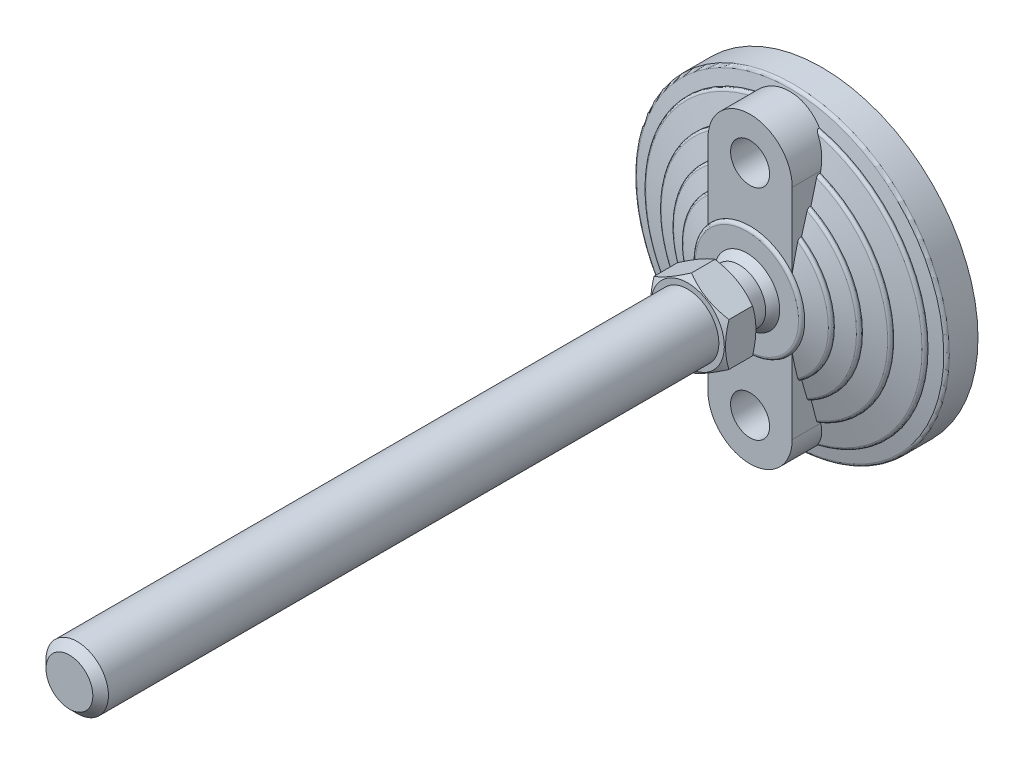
ISO-10303-21;
HEADER;
FILE_DESCRIPTION(('STEP AP214'),'2;1');
FILE_NAME('part.step','',(''),(''),'','','');
FILE_SCHEMA(('AUTOMOTIVE_DESIGN { 1 0 10303 214 1 1 1 1 }'));
ENDSEC;
DATA;
#1=APPLICATION_CONTEXT('core data for automotive mechanical design processes');
#2=APPLICATION_PROTOCOL_DEFINITION('international standard','automotive_design',2000,#1);
#3=PRODUCT_CONTEXT('',#1,'mechanical');
#4=PRODUCT('Part','Part','',(#3));
#5=PRODUCT_RELATED_PRODUCT_CATEGORY('part','',(#4));
#6=PRODUCT_DEFINITION_FORMATION('','',#4);
#7=PRODUCT_DEFINITION_CONTEXT('part definition',#1,'design');
#8=PRODUCT_DEFINITION('design','',#6,#7);
#9=PRODUCT_DEFINITION_SHAPE('','',#8);
#10=(LENGTH_UNIT() NAMED_UNIT(*) SI_UNIT(.MILLI.,.METRE.));
#11=(NAMED_UNIT(*) PLANE_ANGLE_UNIT() SI_UNIT($,.RADIAN.));
#12=(NAMED_UNIT(*) SI_UNIT($,.STERADIAN.) SOLID_ANGLE_UNIT());
#13=UNCERTAINTY_MEASURE_WITH_UNIT(LENGTH_MEASURE(1.E-05),#10,'distance_accuracy_value','');
#14=(GEOMETRIC_REPRESENTATION_CONTEXT(3) GLOBAL_UNCERTAINTY_ASSIGNED_CONTEXT((#13)) GLOBAL_UNIT_ASSIGNED_CONTEXT((#10,
#11,#12)) REPRESENTATION_CONTEXT('',''));
#15=CARTESIAN_POINT('',(0.,0.,0.));
#16=DIRECTION('',(0.,0.,1.));
#17=DIRECTION('',(1.,0.,0.));
#18=AXIS2_PLACEMENT_3D('',#15,#16,#17);
#19=CARTESIAN_POINT('',(-12.,14.022683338,36.));
#20=DIRECTION('',(0.,0.,1.));
#21=DIRECTION('',(0.,-1.,0.));
#22=AXIS2_PLACEMENT_3D('',#19,#20,#21);
#23=PLANE('',#22);
#24=CARTESIAN_POINT('',(0.,0.,36.));
#25=DIRECTION('',(0.,0.,-1.));
#26=DIRECTION('',(0.,1.,0.));
#27=AXIS2_PLACEMENT_3D('',#24,#25,#26);
#28=CIRCLE('',#27,11.75);
#29=CARTESIAN_POINT('',(0.,11.75,36.));
#30=VERTEX_POINT('',#29);
#31=EDGE_CURVE('E260',#30,#30,#28,.T.);
#32=ORIENTED_EDGE('',*,*,#31,.T.);
#33=EDGE_LOOP('',(#32));
#34=FACE_BOUND('',#33,.T.);
#35=CARTESIAN_POINT('',(0.,0.,36.));
#36=DIRECTION('',(0.,0.,-1.));
#37=DIRECTION('',(0.,1.,0.));
#38=AXIS2_PLACEMENT_3D('',#35,#36,#37);
#39=CIRCLE('',#38,8.5);
#40=CARTESIAN_POINT('',(0.,8.5,36.));
#41=VERTEX_POINT('',#40);
#42=EDGE_CURVE('E274',#41,#41,#39,.T.);
#43=ORIENTED_EDGE('',*,*,#42,.F.);
#44=EDGE_LOOP('',(#43));
#45=FACE_BOUND('',#44,.T.);
#46=ADVANCED_FACE('F14',(#34,#45),#23,.F.);
#47=CARTESIAN_POINT('',(0.,0.,36.));
#48=DIRECTION('',(0.,0.,-1.));
#49=DIRECTION('',(0.,1.,0.));
#50=AXIS2_PLACEMENT_3D('',#47,#48,#49);
#51=CYLINDRICAL_SURFACE('',#50,8.5);
#52=CARTESIAN_POINT('',(0.,0.,29.5));
#53=DIRECTION('',(0.,0.,-1.));
#54=DIRECTION('',(0.,1.,0.));
#55=AXIS2_PLACEMENT_3D('',#52,#53,#54);
#56=CIRCLE('',#55,8.5);
#57=CARTESIAN_POINT('',(0.,8.5,29.5));
#58=VERTEX_POINT('',#57);
#59=EDGE_CURVE('E573',#58,#58,#56,.F.);
#60=ORIENTED_EDGE('',*,*,#59,.T.);
#61=EDGE_LOOP('',(#60));
#62=FACE_BOUND('',#61,.T.);
#63=ORIENTED_EDGE('',*,*,#42,.T.);
#64=EDGE_LOOP('',(#63));
#65=FACE_BOUND('',#64,.T.);
#66=ADVANCED_FACE('F1291',(#62,#65),#51,.T.);
#67=CARTESIAN_POINT('',(-44.173478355,44.022,0.));
#68=DIRECTION('',(0.,0.,1.));
#69=DIRECTION('',(0.,-1.,0.));
#70=AXIS2_PLACEMENT_3D('',#67,#68,#69);
#71=PLANE('',#70);
#72=CARTESIAN_POINT('',(0.,0.,0.));
#73=DIRECTION('',(0.,0.,-1.));
#74=DIRECTION('',(0.,1.,0.));
#75=AXIS2_PLACEMENT_3D('',#72,#73,#74);
#76=CIRCLE('',#75,43.5);
#77=CARTESIAN_POINT('',(0.,43.5,0.));
#78=VERTEX_POINT('',#77);
#79=EDGE_CURVE('E576',#78,#78,#76,.F.);
#80=ORIENTED_EDGE('',*,*,#79,.F.);
#81=EDGE_LOOP('',(#80));
#82=FACE_BOUND('',#81,.T.);
#83=ADVANCED_FACE('F1280',(#82),#71,.F.);
#84=CARTESIAN_POINT('',(-8.631599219,8.622532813,29.5));
#85=DIRECTION('',(0.,0.,1.));
#86=DIRECTION('',(0.,-1.,0.));
#87=AXIS2_PLACEMENT_3D('',#84,#85,#86);
#88=PLANE('',#87);
#89=CARTESIAN_POINT('',(0.,0.,29.5));
#90=DIRECTION('',(0.,0.,-1.));
#91=DIRECTION('',(0.,1.,0.));
#92=AXIS2_PLACEMENT_3D('',#89,#90,#91);
#93=CIRCLE('',#92,8.49107182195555);
#94=CARTESIAN_POINT('',(0.,8.49107182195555,29.5));
#95=VERTEX_POINT('',#94);
#96=EDGE_CURVE('E579',#95,#95,#93,.T.);
#97=ORIENTED_EDGE('',*,*,#96,.F.);
#98=EDGE_LOOP('',(#97));
#99=FACE_BOUND('',#98,.T.);
#100=ORIENTED_EDGE('',*,*,#59,.F.);
#101=EDGE_LOOP('',(#100));
#102=FACE_BOUND('',#101,.T.);
#103=ADVANCED_FACE('F1275',(#99,#102),#88,.F.);
#104=CARTESIAN_POINT('',(0.,0.,3.));
#105=DIRECTION('',(0.,0.,-1.));
#106=DIRECTION('',(0.,1.,0.));
#107=AXIS2_PLACEMENT_3D('',#104,#105,#106);
#108=CYLINDRICAL_SURFACE('',#107,43.5);
#109=ORIENTED_EDGE('',*,*,#79,.T.);
#110=EDGE_LOOP('',(#109));
#111=FACE_BOUND('',#110,.T.);
#112=CARTESIAN_POINT('',(0.,0.,3.));
#113=DIRECTION('',(0.,0.,-1.));
#114=DIRECTION('',(0.,1.,0.));
#115=AXIS2_PLACEMENT_3D('',#112,#113,#114);
#116=CIRCLE('',#115,43.5);
#117=CARTESIAN_POINT('',(0.,43.5,3.));
#118=VERTEX_POINT('',#117);
#119=EDGE_CURVE('E582',#118,#118,#116,.T.);
#120=ORIENTED_EDGE('',*,*,#119,.T.);
#121=EDGE_LOOP('',(#120));
#122=FACE_BOUND('',#121,.T.);
#123=ADVANCED_FACE('F1268',(#111,#122),#108,.T.);
#124=CARTESIAN_POINT('',(-6.346764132,-28.675,3.));
#125=DIRECTION('',(0.,0.,1.));
#126=DIRECTION('',(0.,-1.,0.));
#127=AXIS2_PLACEMENT_3D('',#124,#125,#126);
#128=PLANE('',#127);
#129=CARTESIAN_POINT('',(0.,-35.,3.));
#130=DIRECTION('',(0.,0.,1.));
#131=DIRECTION('',(0.,-1.,0.));
#132=AXIS2_PLACEMENT_3D('',#129,#130,#131);
#133=CIRCLE('',#132,6.25);
#134=CARTESIAN_POINT('',(0.,-41.25,3.));
#135=VERTEX_POINT('',#134);
#136=EDGE_CURVE('E585',#135,#135,#133,.T.);
#137=ORIENTED_EDGE('',*,*,#136,.T.);
#138=EDGE_LOOP('',(#137));
#139=FACE_BOUND('',#138,.T.);
#140=ADVANCED_FACE('F774',(#139),#128,.T.);
#141=CARTESIAN_POINT('',(0.,0.,20.670266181));
#142=DIRECTION('',(0.,0.,-1.));
#143=DIRECTION('',(1.,0.,0.));
#144=AXIS2_PLACEMENT_3D('',#141,#142,#143);
#145=SPHERICAL_SURFACE('',#144,12.25);
#146=CARTESIAN_POINT('',(0.,0.,27.));
#147=DIRECTION('',(0.,0.,-1.));
#148=DIRECTION('',(0.,1.,0.));
#149=AXIS2_PLACEMENT_3D('',#146,#147,#148);
#150=CIRCLE('',#149,10.4879440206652);
#151=CARTESIAN_POINT('',(0.,10.4879440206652,27.));
#152=VERTEX_POINT('',#151);
#153=EDGE_CURVE('E588',#152,#152,#150,.F.);
#154=ORIENTED_EDGE('',*,*,#153,.T.);
#155=EDGE_LOOP('',(#154));
#156=FACE_BOUND('',#155,.T.);
#157=ORIENTED_EDGE('',*,*,#96,.T.);
#158=EDGE_LOOP('',(#157));
#159=FACE_BOUND('',#158,.T.);
#160=ADVANCED_FACE('F764',(#156,#159),#145,.T.);
#161=CARTESIAN_POINT('',(-50.774113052,50.6,3.));
#162=DIRECTION('',(0.,0.,1.));
#163=DIRECTION('',(0.,-1.,0.));
#164=AXIS2_PLACEMENT_3D('',#161,#162,#163);
#165=PLANE('',#164);
#166=ORIENTED_EDGE('',*,*,#119,.F.);
#167=EDGE_LOOP('',(#166));
#168=FACE_BOUND('',#167,.T.);
#169=CARTESIAN_POINT('',(0.,0.,3.));
#170=DIRECTION('',(0.,0.,-1.));
#171=DIRECTION('',(0.,1.,0.));
#172=AXIS2_PLACEMENT_3D('',#169,#170,#171);
#173=CIRCLE('',#172,50.);
#174=CARTESIAN_POINT('',(0.,50.,3.));
#175=VERTEX_POINT('',#174);
#176=EDGE_CURVE('E538',#175,#175,#173,.F.);
#177=ORIENTED_EDGE('',*,*,#176,.F.);
#178=EDGE_LOOP('',(#177));
#179=FACE_BOUND('',#178,.T.);
#180=ADVANCED_FACE('F762',(#168,#179),#165,.F.);
#181=CARTESIAN_POINT('',(0.,-35.,3.));
#182=DIRECTION('',(0.,0.,1.));
#183=DIRECTION('',(0.,-1.,0.));
#184=AXIS2_PLACEMENT_3D('',#181,#182,#183);
#185=CYLINDRICAL_SURFACE('',#184,6.25);
#186=ORIENTED_EDGE('',*,*,#136,.F.);
#187=EDGE_LOOP('',(#186));
#188=FACE_BOUND('',#187,.T.);
#189=CARTESIAN_POINT('',(0.,-35.,26.));
#190=DIRECTION('',(0.,0.,1.));
#191=DIRECTION('',(0.,-1.,0.));
#192=AXIS2_PLACEMENT_3D('',#189,#190,#191);
#193=CIRCLE('',#192,6.25);
#194=CARTESIAN_POINT('',(0.,-41.25,26.));
#195=VERTEX_POINT('',#194);
#196=EDGE_CURVE('E521',#195,#195,#193,.T.);
#197=ORIENTED_EDGE('',*,*,#196,.T.);
#198=EDGE_LOOP('',(#197));
#199=FACE_BOUND('',#198,.T.);
#200=ADVANCED_FACE('F622',(#188,#199),#185,.F.);
#201=CARTESIAN_POINT('',(-16.755457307,-16.698,27.));
#202=DIRECTION('',(0.,0.,-1.));
#203=DIRECTION('',(0.,1.,0.));
#204=AXIS2_PLACEMENT_3D('',#201,#202,#203);
#205=PLANE('',#204);
#206=ORIENTED_EDGE('',*,*,#153,.F.);
#207=EDGE_LOOP('',(#206));
#208=FACE_BOUND('',#207,.T.);
#209=CARTESIAN_POINT('',(0.,0.,27.));
#210=DIRECTION('',(0.,0.,-1.));
#211=DIRECTION('',(0.,1.,0.));
#212=AXIS2_PLACEMENT_3D('',#209,#210,#211);
#213=CIRCLE('',#212,16.5);
#214=CARTESIAN_POINT('',(0.,16.5,27.));
#215=VERTEX_POINT('',#214);
#216=EDGE_CURVE('E520',#215,#215,#213,.T.);
#217=ORIENTED_EDGE('',*,*,#216,.F.);
#218=EDGE_LOOP('',(#217));
#219=FACE_BOUND('',#218,.T.);
#220=ADVANCED_FACE('F772',(#208,#219),#205,.F.);
#221=CARTESIAN_POINT('',(-6.346764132,41.325,3.));
#222=DIRECTION('',(0.,0.,1.));
#223=DIRECTION('',(0.,-1.,0.));
#224=AXIS2_PLACEMENT_3D('',#221,#222,#223);
#225=PLANE('',#224);
#226=CARTESIAN_POINT('',(0.,35.,3.));
#227=DIRECTION('',(0.,0.,1.));
#228=DIRECTION('',(0.,-1.,0.));
#229=AXIS2_PLACEMENT_3D('',#226,#227,#228);
#230=CIRCLE('',#229,6.25);
#231=CARTESIAN_POINT('',(0.,28.75,3.));
#232=VERTEX_POINT('',#231);
#233=EDGE_CURVE('E639',#232,#232,#230,.T.);
#234=ORIENTED_EDGE('',*,*,#233,.T.);
#235=EDGE_LOOP('',(#234));
#236=FACE_BOUND('',#235,.T.);
#237=ADVANCED_FACE('F620',(#236),#225,.T.);
#238=CARTESIAN_POINT('',(0.,0.,26.));
#239=DIRECTION('',(0.,0.,-1.));
#240=DIRECTION('',(1.,0.,0.));
#241=AXIS2_PLACEMENT_3D('',#238,#239,#240);
#242=CONICAL_SURFACE('',#241,17.5,1.27229739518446);
#243=CARTESIAN_POINT('',(0.,0.,26.));
#244=DIRECTION('',(0.,0.,1.));
#245=DIRECTION('',(0.,-1.,0.));
#246=AXIS2_PLACEMENT_3D('',#243,#244,#245);
#247=CIRCLE('',#246,17.5);
#248=CARTESIAN_POINT('',(13.5000000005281,-11.1355287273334,25.999999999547));
#249=VERTEX_POINT('',#248);
#250=CARTESIAN_POINT('',(13.5000000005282,11.1355287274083,25.9999999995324));
#251=VERTEX_POINT('',#250);
#252=EDGE_CURVE('E517',#249,#251,#247,.T.);
#253=ORIENTED_EDGE('',*,*,#252,.F.);
#254=CARTESIAN_POINT('',(13.5,-18.9832672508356,24.2172043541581));
#255=CARTESIAN_POINT('',(13.5,-18.6579649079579,24.2987714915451));
#256=CARTESIAN_POINT('',(13.5,-18.3324976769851,24.3796813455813));
#257=CARTESIAN_POINT('',(13.5,-17.6811977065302,24.5400241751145));
#258=CARTESIAN_POINT('',(13.5,-17.3553649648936,24.6194571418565));
#259=CARTESIAN_POINT('',(13.5,-16.3773825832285,24.8552688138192));
#260=CARTESIAN_POINT('',(13.5,-15.7246371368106,25.0091884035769));
#261=CARTESIAN_POINT('',(13.5,-14.4172126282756,25.3088363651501));
#262=CARTESIAN_POINT('',(13.5,-13.7625334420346,25.4545641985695));
#263=CARTESIAN_POINT('',(13.5,-12.7787974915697,25.6654071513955));
#264=CARTESIAN_POINT('',(13.5,-12.4505717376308,25.7344021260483));
#265=CARTESIAN_POINT('',(13.5,-11.7935144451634,25.8694734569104));
#266=CARTESIAN_POINT('',(13.5,-11.4646828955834,25.9355497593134));
#267=CARTESIAN_POINT('',(13.5,-11.1355287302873,25.9999999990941));
#268=B_SPLINE_CURVE_WITH_KNOTS('',3,(#254,#255,#256,#257,#258,#259,#260,#261,#262,#263,#264,
#265,#266,#267),.UNSPECIFIED.,.F.,.F.,(4,2,2,2,2,2,4),(0.,1.00611699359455,2.01223994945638,
4.02414047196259,6.03617307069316,7.04235800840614,8.04856148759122),.UNSPECIFIED.);
#269=CARTESIAN_POINT('',(13.5,-18.9832672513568,24.2172043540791));
#270=VERTEX_POINT('',#269);
#271=EDGE_CURVE('E593',#270,#249,#268,.T.);
#272=ORIENTED_EDGE('',*,*,#271,.F.);
#273=CARTESIAN_POINT('',(3.16437848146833E-10,0.,24.217204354));
#274=DIRECTION('',(0.,0.,-1.));
#275=DIRECTION('',(1.,0.,0.));
#276=AXIS2_PLACEMENT_3D('',#273,#274,#275);
#277=CIRCLE('',#276,23.2940858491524);
#278=CARTESIAN_POINT('',(13.5,18.983267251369,24.2172043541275));
#279=VERTEX_POINT('',#278);
#280=EDGE_CURVE('E549',#279,#270,#277,.T.);
#281=ORIENTED_EDGE('',*,*,#280,.F.);
#282=CARTESIAN_POINT('',(13.5,11.1355287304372,25.9999999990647));
#283=CARTESIAN_POINT('',(13.5,11.4646828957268,25.9355497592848));
#284=CARTESIAN_POINT('',(13.5,11.7935144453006,25.8694734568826));
#285=CARTESIAN_POINT('',(13.5,12.4505717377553,25.7344021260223));
#286=CARTESIAN_POINT('',(13.5,12.7787974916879,25.6654071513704));
#287=CARTESIAN_POINT('',(13.5,13.762533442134,25.4545641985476));
#288=CARTESIAN_POINT('',(13.5,14.4172126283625,25.3088363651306));
#289=CARTESIAN_POINT('',(13.5,15.7246371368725,25.0091884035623));
#290=CARTESIAN_POINT('',(13.5,16.377382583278,24.8552688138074));
#291=CARTESIAN_POINT('',(13.5,17.3553649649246,24.619457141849));
#292=CARTESIAN_POINT('',(13.5,17.681197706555,24.5400241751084));
#293=CARTESIAN_POINT('',(13.5,18.3324976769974,24.3796813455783));
#294=CARTESIAN_POINT('',(13.5,18.6579649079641,24.2987714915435));
#295=CARTESIAN_POINT('',(13.5,18.9832672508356,24.2172043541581));
#296=B_SPLINE_CURVE_WITH_KNOTS('',3,(#282,#283,#284,#285,#286,#287,#288,#289,#290,#291,#292,
#293,#294,#295),.UNSPECIFIED.,.F.,.F.,(4,2,2,2,2,2,4),(0.,1.00620347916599,2.01238841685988,
4.02442101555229,6.03632153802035,7.04244449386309,8.04856148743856),.UNSPECIFIED.);
#297=EDGE_CURVE('E630',#251,#279,#296,.T.);
#298=ORIENTED_EDGE('',*,*,#297,.F.);
#299=EDGE_LOOP('',(#253,#272,#281,#298));
#300=FACE_BOUND('',#299,.T.);
#301=ADVANCED_FACE('F614',(#300),#242,.T.);
#302=CARTESIAN_POINT('',(13.267303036,19.999466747,23.261425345));
#303=CARTESIAN_POINT('',(29.097194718,9.49818825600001,23.261425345));
#304=CARTESIAN_POINT('',(29.097194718,-9.49818825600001,23.261425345));
#305=CARTESIAN_POINT('',(13.267303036,-19.999466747,23.261425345));
#306=CARTESIAN_POINT('',(13.267303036,19.999466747,23.716888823));
#307=CARTESIAN_POINT('',(29.097194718,9.49818825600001,23.716888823));
#308=CARTESIAN_POINT('',(29.097194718,-9.49818825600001,23.716888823));
#309=CARTESIAN_POINT('',(13.267303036,-19.999466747,23.716888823));
#310=CARTESIAN_POINT('',(13.117718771,19.773979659,24.083258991));
#311=CARTESIAN_POINT('',(28.769133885,9.39109946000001,24.083258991));
#312=CARTESIAN_POINT('',(28.769133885,-9.39109946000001,24.083258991));
#313=CARTESIAN_POINT('',(13.117718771,-19.773979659,24.083258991));
#314=CARTESIAN_POINT('',(12.877070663,19.411220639,24.217204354));
#315=CARTESIAN_POINT('',(28.241356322,9.218817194,24.217204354));
#316=CARTESIAN_POINT('',(28.241356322,-9.218817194,24.217204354));
#317=CARTESIAN_POINT('',(12.877070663,-19.411220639,24.217204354));
#318=(BOUNDED_SURFACE() B_SPLINE_SURFACE(3,3,((#302,#303,#304,#305),(#306,#307,#308,#309),(#310,
#311,#312,#313),(#314,#315,#316,#317)),.UNSPECIFIED.,.F.,.F.,
.F.) B_SPLINE_SURFACE_WITH_KNOTS((4,4),(4,4),(0.,1.),(0.,1.),
.UNSPECIFIED.) GEOMETRIC_REPRESENTATION_ITEM() RATIONAL_B_SPLINE_SURFACE(((1.,0.701869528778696,
0.701869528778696,1.),(0.869593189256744,0.610340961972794,0.610340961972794,0.869593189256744),
(0.869593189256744,0.610340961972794,0.610340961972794,0.869593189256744),(1.,0.701869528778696,
0.701869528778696,1.))) REPRESENTATION_ITEM('') SURFACE());
#319=CARTESIAN_POINT('',(13.5,-19.8431348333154,23.2614253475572));
#320=CARTESIAN_POINT('',(13.5,-19.8431370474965,23.2860556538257));
#321=CARTESIAN_POINT('',(13.5,-19.8420333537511,23.3106726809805));
#322=CARTESIAN_POINT('',(13.5,-19.8376465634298,23.3597018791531));
#323=CARTESIAN_POINT('',(13.5,-19.8343643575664,23.3841141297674));
#324=CARTESIAN_POINT('',(13.5,-19.8213486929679,23.4565201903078));
#325=CARTESIAN_POINT('',(13.5,-19.8084453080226,23.5039784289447));
#326=CARTESIAN_POINT('',(13.5,-19.7748969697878,23.5959548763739));
#327=CARTESIAN_POINT('',(13.5,-19.7542611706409,23.6404764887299));
#328=CARTESIAN_POINT('',(13.5,-19.7062220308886,23.7257350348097));
#329=CARTESIAN_POINT('',(13.5,-19.6788120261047,23.7664681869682));
#330=CARTESIAN_POINT('',(13.5,-19.6164784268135,23.8458096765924));
#331=CARTESIAN_POINT('',(13.5,-19.5811980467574,23.8841360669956));
#332=CARTESIAN_POINT('',(13.5,-19.5055204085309,23.9553392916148));
#333=CARTESIAN_POINT('',(13.5,-19.4651202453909,23.9882130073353));
#334=CARTESIAN_POINT('',(13.5,-19.3733614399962,24.0532792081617));
#335=CARTESIAN_POINT('',(13.5,-19.321293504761,24.0844693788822));
#336=CARTESIAN_POINT('',(13.5,-19.2133323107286,24.139175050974));
#337=CARTESIAN_POINT('',(13.5,-19.1574401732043,24.1626927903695));
#338=CARTESIAN_POINT('',(13.5,-19.0617819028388,24.1957297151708));
#339=CARTESIAN_POINT('',(13.5,-19.022719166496,24.207311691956));
#340=CARTESIAN_POINT('',(13.5,-18.9832672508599,24.2172043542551));
#341=B_SPLINE_CURVE_WITH_KNOTS('',3,(#319,#320,#321,#322,#323,#324,#325,#326,#327,#328,#329,
#330,#331,#332,#333,#334,#335,#336,#337,#338,#339,#340),.UNSPECIFIED.,.F.,.F.,(4,2,2,2,2,2,2,2,
2,2,4),(0.,0.073840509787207,0.147650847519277,0.294398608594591,0.440973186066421,
0.587692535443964,0.743377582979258,0.899151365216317,1.08055916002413,1.26191399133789,
1.38396481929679),.UNSPECIFIED.);
#342=CARTESIAN_POINT('',(13.5,-19.8431348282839,23.2614253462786));
#343=VERTEX_POINT('',#342);
#344=EDGE_CURVE('E709',#343,#270,#341,.T.);
#345=CARTESIAN_POINT('',(0.,0.,23.261425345));
#346=DIRECTION('',(0.,0.,-1.));
#347=DIRECTION('',(0.,1.,0.));
#348=AXIS2_PLACEMENT_3D('',#345,#346,#347);
#349=CIRCLE('',#348,24.);
#350=CARTESIAN_POINT('',(13.5,19.8431348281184,23.2614253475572));
#351=VERTEX_POINT('',#350);
#352=EDGE_CURVE('E547',#351,#343,#349,.T.);
#353=CARTESIAN_POINT('',(13.5,18.9832672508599,24.2172043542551));
#354=CARTESIAN_POINT('',(13.5,19.0245269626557,24.2068474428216));
#355=CARTESIAN_POINT('',(13.5,19.0653049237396,24.1946763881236));
#356=CARTESIAN_POINT('',(13.5,19.1456358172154,24.1665827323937));
#357=CARTESIAN_POINT('',(13.5,19.1851861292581,24.1506526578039));
#358=CARTESIAN_POINT('',(13.5,19.3016874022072,24.0969581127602));
#359=CARTESIAN_POINT('',(13.5,19.3761277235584,24.0533765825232));
#360=CARTESIAN_POINT('',(13.5,19.4913457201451,23.9675664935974));
#361=CARTESIAN_POINT('',(13.5,19.5352290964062,23.9294496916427));
#362=CARTESIAN_POINT('',(13.5,19.6161219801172,23.8466003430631));
#363=CARTESIAN_POINT('',(13.5,19.6531483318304,23.801884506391));
#364=CARTESIAN_POINT('',(13.5,19.7189344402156,23.7060840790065));
#365=CARTESIAN_POINT('',(13.5,19.747615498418,23.6549449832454));
#366=CARTESIAN_POINT('',(13.5,19.7944064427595,23.5480322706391));
#367=CARTESIAN_POINT('',(13.5,19.8125331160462,23.4922661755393));
#368=CARTESIAN_POINT('',(13.5,19.8308153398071,23.4067306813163));
#369=CARTESIAN_POINT('',(13.5,19.8354249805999,23.3778585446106));
#370=CARTESIAN_POINT('',(13.5,19.8415861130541,23.3198066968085));
#371=CARTESIAN_POINT('',(13.5,19.8431393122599,23.2906271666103));
#372=CARTESIAN_POINT('',(13.5,19.8431348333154,23.2614253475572));
#373=B_SPLINE_CURVE_WITH_KNOTS('',3,(#353,#354,#355,#356,#357,#358,#359,#360,#361,#362,#363,
#364,#365,#366,#367,#368,#369,#370,#371,#372),.UNSPECIFIED.,.F.,.F.,(4,2,2,2,2,2,2,2,2,4),(0.,
0.127516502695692,0.25528869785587,0.511930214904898,0.685657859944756,0.858952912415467,
1.03383282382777,1.20843381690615,1.29600438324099,1.38352601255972),.UNSPECIFIED.);
#374=EDGE_CURVE('E638',#279,#351,#373,.T.);
#375=ORIENTED_EDGE('',*,*,#280,.T.);
#376=ORIENTED_EDGE('',*,*,#344,.F.);
#377=ORIENTED_EDGE('',*,*,#352,.F.);
#378=ORIENTED_EDGE('',*,*,#374,.F.);
#379=EDGE_LOOP('',(#375,#376,#377,#378));
#380=FACE_BOUND('',#379,.T.);
#381=ADVANCED_FACE('F619',(#380),#318,.T.);
#382=CARTESIAN_POINT('',(0.,0.,23.261425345));
#383=DIRECTION('',(0.,0.,-1.));
#384=DIRECTION('',(0.,1.,0.));
#385=AXIS2_PLACEMENT_3D('',#382,#383,#384);
#386=CYLINDRICAL_SURFACE('',#385,24.);
#387=CARTESIAN_POINT('',(0.,0.,23.));
#388=DIRECTION('',(0.,0.,-1.));
#389=DIRECTION('',(0.,1.,0.));
#390=AXIS2_PLACEMENT_3D('',#387,#388,#389);
#391=CIRCLE('',#390,24.);
#392=CARTESIAN_POINT('',(13.5,19.8431348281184,23.));
#393=VERTEX_POINT('',#392);
#394=CARTESIAN_POINT('',(13.5,-19.8431348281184,23.000000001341));
#395=VERTEX_POINT('',#394);
#396=EDGE_CURVE('E545',#393,#395,#391,.T.);
#397=ORIENTED_EDGE('',*,*,#396,.F.);
#398=DIRECTION('',(0.,0.,-1.));
#399=VECTOR('',#398,1.);
#400=CARTESIAN_POINT('',(13.5,19.8431348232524,21.4084486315));
#401=LINE('',#400,#399);
#402=EDGE_CURVE('E686',#351,#393,#401,.T.);
#403=ORIENTED_EDGE('',*,*,#402,.F.);
#404=ORIENTED_EDGE('',*,*,#352,.T.);
#405=DIRECTION('',(0.,0.,1.));
#406=VECTOR('',#405,1.);
#407=CARTESIAN_POINT('',(13.5,-19.8431348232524,21.4084486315));
#408=LINE('',#407,#406);
#409=EDGE_CURVE('E707',#395,#343,#408,.T.);
#410=ORIENTED_EDGE('',*,*,#409,.F.);
#411=EDGE_LOOP('',(#397,#403,#404,#410));
#412=FACE_BOUND('',#411,.T.);
#413=ADVANCED_FACE('F691',(#412),#386,.T.);
#414=CARTESIAN_POINT('',(0.,0.,23.));
#415=DIRECTION('',(0.,0.,-1.));
#416=DIRECTION('',(0.,1.,0.));
#417=AXIS2_PLACEMENT_3D('',#414,#415,#416);
#418=CONICAL_SURFACE('',#417,24.,1.24904577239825);
#419=ORIENTED_EDGE('',*,*,#396,.T.);
#420=CARTESIAN_POINT('',(13.5,-26.022897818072,21.2279240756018));
#421=CARTESIAN_POINT('',(13.5,-25.5091656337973,21.3799212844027));
#422=CARTESIAN_POINT('',(13.5,-24.9951778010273,21.5310587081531));
#423=CARTESIAN_POINT('',(13.5,-23.9666187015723,21.8312926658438));
#424=CARTESIAN_POINT('',(13.5,-23.4520474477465,21.9803892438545));
#425=CARTESIAN_POINT('',(13.5,-22.4222240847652,22.2762276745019));
#426=CARTESIAN_POINT('',(13.5,-21.9069719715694,22.422969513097));
#427=CARTESIAN_POINT('',(13.5,-20.8756730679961,22.713675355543));
#428=CARTESIAN_POINT('',(13.5,-20.3596262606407,22.8576392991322));
#429=CARTESIAN_POINT('',(13.5,-19.8431348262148,23.0000000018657));
#430=B_SPLINE_CURVE_WITH_KNOTS('',3,(#420,#421,#422,#423,#424,#425,#426,#427,#428,#429),
.UNSPECIFIED.,.F.,.F.,(4,2,2,2,4),(0.,1.60723934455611,3.21444392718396,4.82165809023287,
6.42890708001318),.UNSPECIFIED.);
#431=CARTESIAN_POINT('',(13.5,-26.0228978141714,21.2279240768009));
#432=VERTEX_POINT('',#431);
#433=EDGE_CURVE('E699',#432,#395,#430,.T.);
#434=ORIENTED_EDGE('',*,*,#433,.F.);
#435=CARTESIAN_POINT('',(-5.51341958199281E-10,0.,21.227924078));
#436=DIRECTION('',(0.,0.,-1.));
#437=DIRECTION('',(0.,1.,0.));
#438=AXIS2_PLACEMENT_3D('',#435,#436,#437);
#439=CIRCLE('',#438,29.3162277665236);
#440=CARTESIAN_POINT('',(13.5,26.0228978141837,21.2279240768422));
#441=VERTEX_POINT('',#440);
#442=EDGE_CURVE('E544',#441,#432,#439,.T.);
#443=ORIENTED_EDGE('',*,*,#442,.F.);
#444=CARTESIAN_POINT('',(13.5000000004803,19.8431348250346,23.0000000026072));
#445=CARTESIAN_POINT('',(13.5000000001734,20.3596262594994,22.8576392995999));
#446=CARTESIAN_POINT('',(13.5000000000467,20.8756730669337,22.7136753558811));
#447=CARTESIAN_POINT('',(13.4999999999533,21.9069719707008,22.4229695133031));
#448=CARTESIAN_POINT('',(13.4999999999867,22.4222240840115,22.2762276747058));
#449=CARTESIAN_POINT('',(13.5000000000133,23.4520474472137,21.9803892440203));
#450=CARTESIAN_POINT('',(13.5000000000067,23.9666187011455,21.8312926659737));
#451=CARTESIAN_POINT('',(13.4999999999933,24.995177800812,21.5310587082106));
#452=CARTESIAN_POINT('',(13.4999999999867,25.5091656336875,21.3799212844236));
#453=CARTESIAN_POINT('',(13.5,26.022897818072,21.2279240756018));
#454=B_SPLINE_CURVE_WITH_KNOTS('',3,(#444,#445,#446,#447,#448,#449,#450,#451,#452,#453),
.UNSPECIFIED.,.F.,.F.,(4,2,2,2,4),(0.,1.60724899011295,3.2144631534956,4.82166773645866,
6.42890708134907),.UNSPECIFIED.);
#455=EDGE_CURVE('E679',#393,#441,#454,.T.);
#456=ORIENTED_EDGE('',*,*,#455,.F.);
#457=EDGE_LOOP('',(#419,#434,#443,#456));
#458=FACE_BOUND('',#457,.T.);
#459=ADVANCED_FACE('F687',(#458),#418,.T.);
#460=CARTESIAN_POINT('',(13.143890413,26.967353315,20.27924078));
#461=CARTESIAN_POINT('',(38.983891,14.372934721,20.27924078));
#462=CARTESIAN_POINT('',(38.983891,-14.372934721,20.27924078));
#463=CARTESIAN_POINT('',(13.143890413,-26.967353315,20.27924078));
#464=CARTESIAN_POINT('',(13.143890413,26.967353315,20.725161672));
#465=CARTESIAN_POINT('',(38.983891,14.372934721,20.725161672));
#466=CARTESIAN_POINT('',(38.983891,-14.372934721,20.725161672));
#467=CARTESIAN_POINT('',(13.143890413,-26.967353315,20.725161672));
#468=CARTESIAN_POINT('',(13.029654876,26.732975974,21.086911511));
#469=CARTESIAN_POINT('',(38.645076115,14.248017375,21.086911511));
#470=CARTESIAN_POINT('',(38.645076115,-14.248017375,21.086911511));
#471=CARTESIAN_POINT('',(13.029654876,-26.732975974,21.086911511));
#472=CARTESIAN_POINT('',(12.844309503,26.352702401,21.227924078));
#473=CARTESIAN_POINT('',(38.095354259,14.045340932,21.227924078));
#474=CARTESIAN_POINT('',(38.095354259,-14.045340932,21.227924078));
#475=CARTESIAN_POINT('',(12.844309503,-26.352702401,21.227924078));
#476=(BOUNDED_SURFACE() B_SPLINE_SURFACE(3,3,((#460,#461,#462,#463),(#464,#465,#466,#467),(#468,
#469,#470,#471),(#472,#473,#474,#475)),.UNSPECIFIED.,.F.,.F.,
.F.) B_SPLINE_SURFACE_WITH_KNOTS((4,4),(4,4),(0.,1.),(0.,1.),
.UNSPECIFIED.) GEOMETRIC_REPRESENTATION_ITEM() RATIONAL_B_SPLINE_SURFACE(((1.,0.625419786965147,
0.625419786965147,1.),(0.874161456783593,0.546717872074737,0.546717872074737,0.874161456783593),
(0.874161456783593,0.546717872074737,0.546717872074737,0.874161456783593),(1.,0.625419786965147,
0.625419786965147,1.))) REPRESENTATION_ITEM('') SURFACE());
#477=CARTESIAN_POINT('',(13.5,-26.7908566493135,20.2792407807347));
#478=CARTESIAN_POINT('',(13.5,-26.7908579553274,20.3051907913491));
#479=CARTESIAN_POINT('',(13.5,-26.7897247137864,20.3311275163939));
#480=CARTESIAN_POINT('',(13.5,-26.7852140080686,20.3827974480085));
#481=CARTESIAN_POINT('',(13.5,-26.781837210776,20.4085307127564));
#482=CARTESIAN_POINT('',(13.5,-26.7684139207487,20.4849772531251));
#483=CARTESIAN_POINT('',(13.5,-26.7550740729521,20.5351491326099));
#484=CARTESIAN_POINT('',(13.5,-26.7202107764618,20.632486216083));
#485=CARTESIAN_POINT('',(13.5,-26.6986916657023,20.6796529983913));
#486=CARTESIAN_POINT('',(13.5,-26.648348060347,20.7699105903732));
#487=CARTESIAN_POINT('',(13.5,-26.6195218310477,20.8130004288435));
#488=CARTESIAN_POINT('',(13.5,-26.5542840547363,20.8959059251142));
#489=CARTESIAN_POINT('',(13.5,-26.5176080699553,20.9355124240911));
#490=CARTESIAN_POINT('',(13.5,-26.4386436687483,21.0087234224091));
#491=CARTESIAN_POINT('',(13.5,-26.3963509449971,21.0423232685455));
#492=CARTESIAN_POINT('',(13.5,-26.3267001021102,21.0898793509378));
#493=CARTESIAN_POINT('',(13.5,-26.3008113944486,21.106038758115));
#494=CARTESIAN_POINT('',(13.5,-26.2478537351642,21.1362297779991));
#495=CARTESIAN_POINT('',(13.5,-26.2207861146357,21.1502637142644));
#496=CARTESIAN_POINT('',(13.5,-26.1657188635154,21.176151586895));
#497=CARTESIAN_POINT('',(13.5,-26.1377218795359,21.1880111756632));
#498=CARTESIAN_POINT('',(13.5,-26.0808891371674,21.2095853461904));
#499=CARTESIAN_POINT('',(13.5,-26.0520527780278,21.2192983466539));
#500=CARTESIAN_POINT('',(13.5,-26.0228978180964,21.2279240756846));
#501=B_SPLINE_CURVE_WITH_KNOTS('',3,(#477,#478,#479,#480,#481,#482,#483,#484,#485,#486,#487,
#488,#489,#490,#491,#492,#493,#494,#495,#496,#497,#498,#499,#500),.UNSPECIFIED.,.F.,.F.,(4,2,2,
2,2,2,2,2,2,2,2,4),(0.,0.0777993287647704,0.155575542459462,0.310500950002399,0.465344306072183,
0.620224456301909,0.78151106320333,0.942922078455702,1.03439248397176,1.12576216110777,
1.21689083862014,1.30808642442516),.UNSPECIFIED.);
#502=CARTESIAN_POINT('',(13.5,-26.7908566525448,20.27924078));
#503=VERTEX_POINT('',#502);
#504=EDGE_CURVE('E708',#503,#432,#501,.T.);
#505=CARTESIAN_POINT('',(0.,0.,20.27924078));
#506=DIRECTION('',(0.,0.,-1.));
#507=DIRECTION('',(0.,1.,0.));
#508=AXIS2_PLACEMENT_3D('',#505,#506,#507);
#509=CIRCLE('',#508,30.);
#510=CARTESIAN_POINT('',(13.5,26.7908566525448,20.2792407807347));
#511=VERTEX_POINT('',#510);
#512=EDGE_CURVE('E542',#511,#503,#509,.T.);
#513=CARTESIAN_POINT('',(13.5,26.0228978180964,21.2279240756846));
#514=CARTESIAN_POINT('',(13.5,26.0845570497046,21.2097134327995));
#515=CARTESIAN_POINT('',(13.5,26.1448460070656,21.1865640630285));
#516=CARTESIAN_POINT('',(13.5,26.2611194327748,21.1305926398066));
#517=CARTESIAN_POINT('',(13.5,26.3170802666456,21.0977216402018));
#518=CARTESIAN_POINT('',(13.5,26.422621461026,21.022592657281));
#519=CARTESIAN_POINT('',(13.5,26.4721821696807,20.9803067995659));
#520=CARTESIAN_POINT('',(13.5,26.5625156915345,20.887307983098));
#521=CARTESIAN_POINT('',(13.5,26.6033065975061,20.8366127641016));
#522=CARTESIAN_POINT('',(13.5,26.6708532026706,20.7331354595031));
#523=CARTESIAN_POINT('',(13.5,26.6985518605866,20.6809691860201));
#524=CARTESIAN_POINT('',(13.5,26.743619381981,20.5723560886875));
#525=CARTESIAN_POINT('',(13.5,26.7610021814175,20.5159151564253));
#526=CARTESIAN_POINT('',(13.5,26.7787549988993,20.4289072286));
#527=CARTESIAN_POINT('',(13.5,26.7832876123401,20.399138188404));
#528=CARTESIAN_POINT('',(13.5,26.78933789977,20.3393328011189));
#529=CARTESIAN_POINT('',(13.5,26.7908592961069,20.3092968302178));
#530=CARTESIAN_POINT('',(13.5,26.7908566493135,20.2792407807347));
#531=B_SPLINE_CURVE_WITH_KNOTS('',3,(#513,#514,#515,#516,#517,#518,#519,#520,#521,#522,#523,
#524,#525,#526,#527,#528,#529,#530),.UNSPECIFIED.,.F.,.F.,(4,2,2,2,2,2,2,2,4),(0.,
0.192810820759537,0.386609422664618,0.58098961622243,0.7749648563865,0.951184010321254,
1.12716456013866,1.21736691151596,1.30745768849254),.UNSPECIFIED.);
#532=EDGE_CURVE('E673',#441,#511,#531,.T.);
#533=ORIENTED_EDGE('',*,*,#442,.T.);
#534=ORIENTED_EDGE('',*,*,#504,.F.);
#535=ORIENTED_EDGE('',*,*,#512,.F.);
#536=ORIENTED_EDGE('',*,*,#532,.F.);
#537=EDGE_LOOP('',(#533,#534,#535,#536));
#538=FACE_BOUND('',#537,.T.);
#539=ADVANCED_FACE('F690',(#538),#476,.T.);
#540=CARTESIAN_POINT('',(0.,0.,20.27924078));
#541=DIRECTION('',(0.,0.,-1.));
#542=DIRECTION('',(0.,1.,0.));
#543=AXIS2_PLACEMENT_3D('',#540,#541,#542);
#544=CYLINDRICAL_SURFACE('',#543,30.);
#545=CARTESIAN_POINT('',(0.,0.,20.));
#546=DIRECTION('',(0.,0.,-1.));
#547=DIRECTION('',(0.,1.,0.));
#548=AXIS2_PLACEMENT_3D('',#545,#546,#547);
#549=CIRCLE('',#548,30.);
#550=CARTESIAN_POINT('',(13.5,26.7908566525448,20.));
#551=VERTEX_POINT('',#550);
#552=CARTESIAN_POINT('',(13.5,-26.7908566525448,19.9999999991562));
#553=VERTEX_POINT('',#552);
#554=EDGE_CURVE('E540',#551,#553,#549,.T.);
#555=ORIENTED_EDGE('',*,*,#554,.F.);
#556=DIRECTION('',(0.,0.,-1.));
#557=VECTOR('',#556,1.);
#558=CARTESIAN_POINT('',(13.5,26.7908566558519,21.4084486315));
#559=LINE('',#558,#557);
#560=EDGE_CURVE('E810',#511,#551,#559,.T.);
#561=ORIENTED_EDGE('',*,*,#560,.F.);
#562=ORIENTED_EDGE('',*,*,#512,.T.);
#563=DIRECTION('',(0.,0.,1.));
#564=VECTOR('',#563,1.);
#565=CARTESIAN_POINT('',(13.5,-26.7908566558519,21.4084486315));
#566=LINE('',#565,#564);
#567=EDGE_CURVE('E720',#553,#503,#566,.T.);
#568=ORIENTED_EDGE('',*,*,#567,.F.);
#569=EDGE_LOOP('',(#555,#561,#562,#568));
#570=FACE_BOUND('',#569,.T.);
#571=ADVANCED_FACE('F731',(#570),#544,.T.);
#572=CARTESIAN_POINT('',(0.,0.,20.));
#573=DIRECTION('',(0.,0.,-1.));
#574=DIRECTION('',(1.,0.,0.));
#575=AXIS2_PLACEMENT_3D('',#572,#573,#574);
#576=CONICAL_SURFACE('',#575,30.,1.29249666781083);
#577=ORIENTED_EDGE('',*,*,#554,.T.);
#578=CARTESIAN_POINT('',(13.5000000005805,-33.6690568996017,18.2072225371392));
#579=CARTESIAN_POINT('',(13.5000000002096,-33.0965095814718,18.3590521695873));
#580=CARTESIAN_POINT('',(13.5000000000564,-32.5238313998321,18.5103895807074));
#581=CARTESIAN_POINT('',(13.4999999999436,-31.3781752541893,18.8119124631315));
#582=CARTESIAN_POINT('',(13.4999999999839,-30.8051972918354,18.9620979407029));
#583=CARTESIAN_POINT('',(13.5000000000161,-29.6588964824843,19.2611513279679));
#584=CARTESIAN_POINT('',(13.5000000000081,-29.0855736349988,19.4100192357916));
#585=CARTESIAN_POINT('',(13.4999999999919,-27.9385277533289,19.7062178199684));
#586=CARTESIAN_POINT('',(13.4999999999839,-27.3648047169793,19.8535484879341));
#587=CARTESIAN_POINT('',(13.5,-26.7908566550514,19.9999999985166));
#588=B_SPLINE_CURVE_WITH_KNOTS('',3,(#578,#579,#580,#581,#582,#583,#584,#585,#586,#587),
.UNSPECIFIED.,.F.,.F.,(4,2,2,2,4),(0.,1.7770100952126,3.55401051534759,5.33101345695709,
7.10802608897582),.UNSPECIFIED.);
#589=CARTESIAN_POINT('',(13.5,-33.6690569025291,18.2072225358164));
#590=VERTEX_POINT('',#589);
#591=EDGE_CURVE('E721',#590,#553,#588,.T.);
#592=ORIENTED_EDGE('',*,*,#591,.F.);
#593=CARTESIAN_POINT('',(3.08438170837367E-10,0.,18.207222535));
#594=DIRECTION('',(0.,0.,-1.));
#595=DIRECTION('',(0.,1.,0.));
#596=AXIS2_PLACEMENT_3D('',#593,#594,#595);
#597=CIRCLE('',#596,36.2747211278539);
#598=CARTESIAN_POINT('',(13.5,33.6690569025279,18.2072225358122));
#599=VERTEX_POINT('',#598);
#600=EDGE_CURVE('E539',#599,#590,#597,.T.);
#601=ORIENTED_EDGE('',*,*,#600,.F.);
#602=CARTESIAN_POINT('',(13.5000000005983,26.790856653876,19.9999999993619));
#603=CARTESIAN_POINT('',(13.5000000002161,27.3648047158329,19.85354848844));
#604=CARTESIAN_POINT('',(13.5000000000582,27.9385277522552,19.7062178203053));
#605=CARTESIAN_POINT('',(13.4999999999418,29.0855736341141,19.4100192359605));
#606=CARTESIAN_POINT('',(13.4999999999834,29.6588964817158,19.2611513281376));
#607=CARTESIAN_POINT('',(13.5000000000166,30.8051972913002,18.9620979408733));
#608=CARTESIAN_POINT('',(13.5000000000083,31.378175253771,18.8119124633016));
#609=CARTESIAN_POINT('',(13.4999999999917,32.523831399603,18.5103895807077));
#610=CARTESIAN_POINT('',(13.4999999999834,33.0965095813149,18.359052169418));
#611=CARTESIAN_POINT('',(13.5,33.6690568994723,18.2072225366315));
#612=B_SPLINE_CURVE_WITH_KNOTS('',3,(#602,#603,#604,#605,#606,#607,#608,#609,#610,#611),
.UNSPECIFIED.,.F.,.F.,(4,2,2,2,4),(0.,1.77701263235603,3.55401557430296,5.3310159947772,
7.10802609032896),.UNSPECIFIED.);
#613=EDGE_CURVE('E666',#551,#599,#612,.T.);
#614=ORIENTED_EDGE('',*,*,#613,.F.);
#615=EDGE_LOOP('',(#577,#592,#601,#614));
#616=FACE_BOUND('',#615,.T.);
#617=ADVANCED_FACE('F727',(#616),#576,.T.);
#618=CARTESIAN_POINT('',(13.003667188,34.639639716,17.245698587));
#619=CARTESIAN_POINT('',(51.0914438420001,20.341547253,17.245698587));
#620=CARTESIAN_POINT('',(51.0914438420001,-20.341547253,17.245698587));
#621=CARTESIAN_POINT('',(13.003667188,-34.639639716,17.245698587));
#622=CARTESIAN_POINT('',(13.003667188,34.639639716,17.709515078));
#623=CARTESIAN_POINT('',(51.091443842,20.341547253,17.709515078));
#624=CARTESIAN_POINT('',(51.091443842,-20.341547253,17.709515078));
#625=CARTESIAN_POINT('',(13.003667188,-34.639639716,17.709515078));
#626=CARTESIAN_POINT('',(12.905504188,34.378149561,18.079802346));
#627=CARTESIAN_POINT('',(50.705761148,20.187991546,18.079802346));
#628=CARTESIAN_POINT('',(50.705761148,-20.187991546,18.079802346));
#629=CARTESIAN_POINT('',(12.905504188,-34.378149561,18.079802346));
#630=CARTESIAN_POINT('',(12.748767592,33.960628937,18.207222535));
#631=CARTESIAN_POINT('',(50.089942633,19.942809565,18.207222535));
#632=CARTESIAN_POINT('',(50.089942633,-19.942809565,18.207222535));
#633=CARTESIAN_POINT('',(12.748767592,-33.960628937,18.207222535));
#634=(BOUNDED_SURFACE() B_SPLINE_SURFACE(3,3,((#618,#619,#620,#621),(#622,#623,#624,#625),(#626,
#627,#628,#629),(#630,#631,#632,#633)),.UNSPECIFIED.,.F.,.F.,
.F.) B_SPLINE_SURFACE_WITH_KNOTS((4,4),(4,4),(0.,1.),(0.,1.),
.UNSPECIFIED.) GEOMETRIC_REPRESENTATION_ITEM() RATIONAL_B_SPLINE_SURFACE(((1.,0.56763364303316,
0.56763364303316,1.),(0.865565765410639,0.491324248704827,0.491324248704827,0.865565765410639),
(0.865565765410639,0.491324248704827,0.491324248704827,0.865565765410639),(1.,0.56763364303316,
0.56763364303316,1.))) REPRESENTATION_ITEM('') SURFACE());
#635=CARTESIAN_POINT('',(13.5,-34.4492380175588,17.2456985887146));
#636=CARTESIAN_POINT('',(13.5,-34.4492388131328,17.2724185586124));
#637=CARTESIAN_POINT('',(13.5,-34.4480869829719,17.2991252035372));
#638=CARTESIAN_POINT('',(13.5,-34.4434985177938,17.3523366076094));
#639=CARTESIAN_POINT('',(13.5,-34.4400623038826,17.3788414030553));
#640=CARTESIAN_POINT('',(13.5,-34.42638545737,17.457641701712));
#641=CARTESIAN_POINT('',(13.5,-34.4127763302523,17.5093910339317));
#642=CARTESIAN_POINT('',(13.5,-34.3771048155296,17.6098360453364));
#643=CARTESIAN_POINT('',(13.5,-34.3550440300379,17.6585323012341));
#644=CARTESIAN_POINT('',(13.5,-34.3032810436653,17.7516688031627));
#645=CARTESIAN_POINT('',(13.5,-34.2735788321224,17.7961090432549));
#646=CARTESIAN_POINT('',(13.5,-34.2066078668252,17.8808807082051));
#647=CARTESIAN_POINT('',(13.5,-34.1691521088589,17.9210639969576));
#648=CARTESIAN_POINT('',(13.5,-34.0883643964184,17.9950807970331));
#649=CARTESIAN_POINT('',(13.5,-34.045025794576,18.0289070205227));
#650=CARTESIAN_POINT('',(13.5,-33.9488589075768,18.0927883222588));
#651=CARTESIAN_POINT('',(13.5,-33.8955116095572,18.1220613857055));
#652=CARTESIAN_POINT('',(13.5,-33.7848588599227,18.1715344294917));
#653=CARTESIAN_POINT('',(13.5,-33.727559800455,18.1917486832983));
#654=CARTESIAN_POINT('',(13.5,-33.6690568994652,18.2072225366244));
#655=B_SPLINE_CURVE_WITH_KNOTS('',3,(#635,#636,#637,#638,#639,#640,#641,#642,#643,#644,#645,
#646,#647,#648,#649,#650,#651,#652,#653,#654),.UNSPECIFIED.,.F.,.F.,(4,2,2,2,2,2,2,2,2,4),(0.,
0.0801088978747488,0.160203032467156,0.31989418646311,0.479555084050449,0.639216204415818,
0.803305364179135,0.967581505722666,1.14930395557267,1.33073905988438),.UNSPECIFIED.);
#656=CARTESIAN_POINT('',(13.5,-34.4492380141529,17.2456985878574));
#657=VERTEX_POINT('',#656);
#658=EDGE_CURVE('E603',#657,#590,#655,.T.);
#659=CARTESIAN_POINT('',(0.,0.,17.245698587));
#660=DIRECTION('',(0.,0.,-1.));
#661=DIRECTION('',(0.,1.,0.));
#662=AXIS2_PLACEMENT_3D('',#659,#660,#661);
#663=CIRCLE('',#662,37.);
#664=CARTESIAN_POINT('',(13.5,34.4492380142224,17.2456985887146));
#665=VERTEX_POINT('',#664);
#666=EDGE_CURVE('E536',#665,#657,#663,.T.);
#667=CARTESIAN_POINT('',(13.5,33.6690568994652,18.2072225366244));
#668=CARTESIAN_POINT('',(13.5,33.7285004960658,18.1914984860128));
#669=CARTESIAN_POINT('',(13.5,33.7866931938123,18.1708859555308));
#670=CARTESIAN_POINT('',(13.5,33.8990439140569,18.1203027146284));
#671=CARTESIAN_POINT('',(13.5,33.9531903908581,18.0903064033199));
#672=CARTESIAN_POINT('',(13.5,34.0556677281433,18.0214004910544));
#673=CARTESIAN_POINT('',(13.5,34.1039872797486,17.9824739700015));
#674=CARTESIAN_POINT('',(13.5,34.192879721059,17.8966704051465));
#675=CARTESIAN_POINT('',(13.5,34.2334627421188,17.8498039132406));
#676=CARTESIAN_POINT('',(13.5,34.3033335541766,17.7520897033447));
#677=CARTESIAN_POINT('',(13.5,34.3331130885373,17.7015938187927));
#678=CARTESIAN_POINT('',(13.5,34.3830581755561,17.5960457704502));
#679=CARTESIAN_POINT('',(13.5,34.4032299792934,17.5409965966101));
#680=CARTESIAN_POINT('',(13.5,34.4284319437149,17.4456451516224));
#681=CARTESIAN_POINT('',(13.5,34.4362159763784,17.4060504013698));
#682=CARTESIAN_POINT('',(13.5,34.4466250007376,17.32621177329));
#683=CARTESIAN_POINT('',(13.5,34.4492528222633,17.2859682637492));
#684=CARTESIAN_POINT('',(13.5,34.4492380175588,17.2456985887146));
#685=B_SPLINE_CURVE_WITH_KNOTS('',3,(#667,#668,#669,#670,#671,#672,#673,#674,#675,#676,#677,
#678,#679,#680,#681,#682,#683,#684),.UNSPECIFIED.,.F.,.F.,(4,2,2,2,2,2,2,2,4),(0.,
0.184329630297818,0.369166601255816,0.554356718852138,0.739302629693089,0.914257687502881,
1.08909875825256,1.2098399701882,1.33051489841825),.UNSPECIFIED.);
#686=EDGE_CURVE('E659',#599,#665,#685,.T.);
#687=ORIENTED_EDGE('',*,*,#600,.T.);
#688=ORIENTED_EDGE('',*,*,#658,.F.);
#689=ORIENTED_EDGE('',*,*,#666,.F.);
#690=ORIENTED_EDGE('',*,*,#686,.F.);
#691=EDGE_LOOP('',(#687,#688,#689,#690));
#692=FACE_BOUND('',#691,.T.);
#693=ADVANCED_FACE('F730',(#692),#634,.T.);
#694=CARTESIAN_POINT('',(0.,0.,17.245698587));
#695=DIRECTION('',(0.,0.,-1.));
#696=DIRECTION('',(1.,0.,0.));
#697=AXIS2_PLACEMENT_3D('',#694,#695,#696);
#698=CYLINDRICAL_SURFACE('',#697,37.);
#699=CARTESIAN_POINT('',(0.,0.,17.));
#700=DIRECTION('',(0.,0.,-1.));
#701=DIRECTION('',(0.,1.,0.));
#702=AXIS2_PLACEMENT_3D('',#699,#700,#701);
#703=CIRCLE('',#702,37.);
#704=CARTESIAN_POINT('',(13.5,34.4492380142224,17.000000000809));
#705=VERTEX_POINT('',#704);
#706=CARTESIAN_POINT('',(13.5,-34.4492380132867,17.0000000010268));
#707=VERTEX_POINT('',#706);
#708=EDGE_CURVE('E533',#705,#707,#703,.T.);
#709=ORIENTED_EDGE('',*,*,#708,.F.);
#710=DIRECTION('',(0.,0.,-1.));
#711=VECTOR('',#710,1.);
#712=CARTESIAN_POINT('',(13.5,34.4492380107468,21.4084486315));
#713=LINE('',#712,#711);
#714=EDGE_CURVE('E807',#665,#705,#713,.T.);
#715=ORIENTED_EDGE('',*,*,#714,.F.);
#716=ORIENTED_EDGE('',*,*,#666,.T.);
#717=DIRECTION('',(0.,0.,1.));
#718=VECTOR('',#717,1.);
#719=CARTESIAN_POINT('',(13.5,-34.4492380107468,21.4084486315));
#720=LINE('',#719,#718);
#721=EDGE_CURVE('E602',#707,#657,#720,.T.);
#722=ORIENTED_EDGE('',*,*,#721,.F.);
#723=EDGE_LOOP('',(#709,#715,#716,#722));
#724=FACE_BOUND('',#723,.T.);
#725=ADVANCED_FACE('F739',(#724),#698,.T.);
#726=CARTESIAN_POINT('',(0.,0.,12.180196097));
#727=DIRECTION('',(0.,0.,-1.));
#728=DIRECTION('',(0.,1.,0.));
#729=AXIS2_PLACEMENT_3D('',#726,#727,#728);
#730=CYLINDRICAL_SURFACE('',#729,50.);
#731=CARTESIAN_POINT('',(0.,0.,12.180196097));
#732=DIRECTION('',(0.,0.,1.));
#733=DIRECTION('',(0.,-1.,0.));
#734=AXIS2_PLACEMENT_3D('',#731,#732,#733);
#735=CIRCLE('',#734,50.);
#736=CARTESIAN_POINT('',(0.,-50.,12.180196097));
#737=VERTEX_POINT('',#736);
#738=EDGE_CURVE('E371',#737,#737,#735,.T.);
#739=ORIENTED_EDGE('',*,*,#738,.F.);
#740=EDGE_LOOP('',(#739));
#741=FACE_BOUND('',#740,.T.);
#742=ORIENTED_EDGE('',*,*,#176,.T.);
#743=EDGE_LOOP('',(#742));
#744=FACE_BOUND('',#743,.T.);
#745=ADVANCED_FACE('F748',(#741,#744),#730,.T.);
#746=CARTESIAN_POINT('',(13.5,-35.,16.816897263));
#747=DIRECTION('',(1.,0.,0.));
#748=DIRECTION('',(0.,1.,0.));
#749=AXIS2_PLACEMENT_3D('',#746,#747,#748);
#750=PLANE('',#749);
#751=ORIENTED_EDGE('',*,*,#409,.T.);
#752=ORIENTED_EDGE('',*,*,#344,.T.);
#753=ORIENTED_EDGE('',*,*,#271,.T.);
#754=DIRECTION('',(0.,-1.,0.));
#755=VECTOR('',#754,1.);
#756=CARTESIAN_POINT('',(13.5,-29.840990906,26.));
#757=LINE('',#756,#755);
#758=CARTESIAN_POINT('',(13.5,-35.0000000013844,26.));
#759=VERTEX_POINT('',#758);
#760=EDGE_CURVE('E796',#249,#759,#757,.T.);
#761=ORIENTED_EDGE('',*,*,#760,.T.);
#762=DIRECTION('',(0.,0.,1.));
#763=VECTOR('',#762,1.);
#764=CARTESIAN_POINT('',(13.5,-35.0000000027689,19.6119));
#765=LINE('',#764,#763);
#766=CARTESIAN_POINT('',(13.5,-34.9999999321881,16.8716672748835));
#767=VERTEX_POINT('',#766);
#768=EDGE_CURVE('E370',#767,#759,#765,.T.);
#769=ORIENTED_EDGE('',*,*,#768,.F.);
#770=CARTESIAN_POINT('',(13.4999999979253,-34.4492380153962,16.9999999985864));
#771=CARTESIAN_POINT('',(13.4999999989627,-34.5410365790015,16.9786323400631));
#772=CARTESIAN_POINT('',(13.4999999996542,-34.632832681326,16.9572541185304));
#773=CARTESIAN_POINT('',(13.5000000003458,-34.8164199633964,16.9144765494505));
#774=CARTESIAN_POINT('',(13.5000000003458,-34.9082111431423,16.8930772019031));
#775=CARTESIAN_POINT('',(13.5,-34.9999998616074,16.8716672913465));
#776=B_SPLINE_CURVE_WITH_KNOTS('',3,(#770,#771,#772,#773,#774,#775),.UNSPECIFIED.,.F.,.F.,(4,2,
4),(0.,0.282757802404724,0.565515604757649),.UNSPECIFIED.);
#777=EDGE_CURVE('E809',#707,#767,#776,.T.);
#778=ORIENTED_EDGE('',*,*,#777,.F.);
#779=ORIENTED_EDGE('',*,*,#721,.T.);
#780=ORIENTED_EDGE('',*,*,#658,.T.);
#781=ORIENTED_EDGE('',*,*,#591,.T.);
#782=ORIENTED_EDGE('',*,*,#567,.T.);
#783=ORIENTED_EDGE('',*,*,#504,.T.);
#784=ORIENTED_EDGE('',*,*,#433,.T.);
#785=EDGE_LOOP('',(#751,#752,#753,#761,#769,#778,#779,#780,#781,#782,#783,#784));
#786=FACE_BOUND('',#785,.T.);
#787=ADVANCED_FACE('F610',(#786),#750,.T.);
#788=CARTESIAN_POINT('',(-13.5,-48.770918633,26.));
#789=DIRECTION('',(0.,0.,-1.));
#790=DIRECTION('',(0.,1.,0.));
#791=AXIS2_PLACEMENT_3D('',#788,#789,#790);
#792=PLANE('',#791);
#793=ORIENTED_EDGE('',*,*,#196,.F.);
#794=EDGE_LOOP('',(#793));
#795=FACE_BOUND('',#794,.T.);
#796=ORIENTED_EDGE('',*,*,#760,.F.);
#797=CARTESIAN_POINT('',(0.,0.,26.));
#798=DIRECTION('',(0.,0.,-1.));
#799=DIRECTION('',(0.,1.,0.));
#800=AXIS2_PLACEMENT_3D('',#797,#798,#799);
#801=CIRCLE('',#800,17.5);
#802=CARTESIAN_POINT('',(-13.4999999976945,-11.1355287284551,26.));
#803=VERTEX_POINT('',#802);
#804=EDGE_CURVE('E790',#803,#249,#801,.F.);
#805=ORIENTED_EDGE('',*,*,#804,.F.);
#806=DIRECTION('',(0.,1.,0.));
#807=VECTOR('',#806,1.);
#808=CARTESIAN_POINT('',(-13.5,-22.996170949,26.));
#809=LINE('',#808,#807);
#810=CARTESIAN_POINT('',(-13.5,-35.,26.));
#811=VERTEX_POINT('',#810);
#812=EDGE_CURVE('E501',#811,#803,#809,.T.);
#813=ORIENTED_EDGE('',*,*,#812,.F.);
#814=CARTESIAN_POINT('',(0.,-35.,26.));
#815=DIRECTION('',(0.,0.,-1.));
#816=DIRECTION('',(1.,0.,0.));
#817=AXIS2_PLACEMENT_3D('',#814,#815,#816);
#818=CIRCLE('',#817,13.5);
#819=EDGE_CURVE('E372',#759,#811,#818,.T.);
#820=ORIENTED_EDGE('',*,*,#819,.F.);
#821=EDGE_LOOP('',(#796,#805,#813,#820));
#822=FACE_BOUND('',#821,.T.);
#823=ADVANCED_FACE('F756',(#795,#822),#792,.F.);
#824=CARTESIAN_POINT('',(0.,0.,26.));
#825=DIRECTION('',(0.,0.,-1.));
#826=DIRECTION('',(0.,1.,0.));
#827=AXIS2_PLACEMENT_3D('',#824,#825,#826);
#828=TOROIDAL_SURFACE('',#827,16.5,1.);
#829=ORIENTED_EDGE('',*,*,#216,.T.);
#830=EDGE_LOOP('',(#829));
#831=FACE_BOUND('',#830,.T.);
#832=CARTESIAN_POINT('',(0.,0.,26.));
#833=DIRECTION('',(0.,0.,-1.));
#834=DIRECTION('',(0.,1.,0.));
#835=AXIS2_PLACEMENT_3D('',#832,#833,#834);
#836=CIRCLE('',#835,17.5);
#837=CARTESIAN_POINT('',(-13.4999999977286,11.1355287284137,26.));
#838=VERTEX_POINT('',#837);
#839=EDGE_CURVE('E491',#803,#838,#836,.T.);
#840=ORIENTED_EDGE('',*,*,#839,.F.);
#841=ORIENTED_EDGE('',*,*,#804,.T.);
#842=ORIENTED_EDGE('',*,*,#252,.T.);
#843=CARTESIAN_POINT('',(0.,0.,26.));
#844=DIRECTION('',(0.,0.,-1.));
#845=DIRECTION('',(0.,1.,0.));
#846=AXIS2_PLACEMENT_3D('',#843,#844,#845);
#847=CIRCLE('',#846,17.5);
#848=EDGE_CURVE('E830',#251,#838,#847,.F.);
#849=ORIENTED_EDGE('',*,*,#848,.T.);
#850=EDGE_LOOP('',(#840,#841,#842,#849));
#851=FACE_BOUND('',#850,.T.);
#852=ADVANCED_FACE('F651',(#831,#851),#828,.T.);
#853=CARTESIAN_POINT('',(0.,35.,3.));
#854=DIRECTION('',(0.,0.,1.));
#855=DIRECTION('',(0.,-1.,0.));
#856=AXIS2_PLACEMENT_3D('',#853,#854,#855);
#857=CYLINDRICAL_SURFACE('',#856,6.25);
#858=ORIENTED_EDGE('',*,*,#233,.F.);
#859=EDGE_LOOP('',(#858));
#860=FACE_BOUND('',#859,.T.);
#861=CARTESIAN_POINT('',(0.,35.,26.));
#862=DIRECTION('',(0.,0.,1.));
#863=DIRECTION('',(0.,-1.,0.));
#864=AXIS2_PLACEMENT_3D('',#861,#862,#863);
#865=CIRCLE('',#864,6.25);
#866=CARTESIAN_POINT('',(0.,28.75,26.));
#867=VERTEX_POINT('',#866);
#868=EDGE_CURVE('E335',#867,#867,#865,.T.);
#869=ORIENTED_EDGE('',*,*,#868,.T.);
#870=EDGE_LOOP('',(#869));
#871=FACE_BOUND('',#870,.T.);
#872=ADVANCED_FACE('F344',(#860,#871),#857,.F.);
#873=CARTESIAN_POINT('',(13.5,10.992341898,16.816897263));
#874=DIRECTION('',(1.,0.,0.));
#875=DIRECTION('',(0.,1.,0.));
#876=AXIS2_PLACEMENT_3D('',#873,#874,#875);
#877=PLANE('',#876);
#878=DIRECTION('',(0.,0.,-1.));
#879=VECTOR('',#878,1.);
#880=CARTESIAN_POINT('',(13.5,34.9999999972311,19.6119));
#881=LINE('',#880,#879);
#882=CARTESIAN_POINT('',(13.5,34.9999999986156,26.));
#883=VERTEX_POINT('',#882);
#884=CARTESIAN_POINT('',(13.5,35.0000000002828,16.8716672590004));
#885=VERTEX_POINT('',#884);
#886=EDGE_CURVE('E334',#883,#885,#881,.T.);
#887=ORIENTED_EDGE('',*,*,#886,.F.);
#888=DIRECTION('',(0.,-1.,0.));
#889=VECTOR('',#888,1.);
#890=CARTESIAN_POINT('',(13.5,29.817764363,26.));
#891=LINE('',#890,#889);
#892=EDGE_CURVE('E827',#883,#251,#891,.T.);
#893=ORIENTED_EDGE('',*,*,#892,.T.);
#894=ORIENTED_EDGE('',*,*,#297,.T.);
#895=ORIENTED_EDGE('',*,*,#374,.T.);
#896=ORIENTED_EDGE('',*,*,#402,.T.);
#897=ORIENTED_EDGE('',*,*,#455,.T.);
#898=ORIENTED_EDGE('',*,*,#532,.T.);
#899=ORIENTED_EDGE('',*,*,#560,.T.);
#900=ORIENTED_EDGE('',*,*,#613,.T.);
#901=ORIENTED_EDGE('',*,*,#686,.T.);
#902=ORIENTED_EDGE('',*,*,#714,.T.);
#903=CARTESIAN_POINT('',(13.5,35.0000000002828,16.8716672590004));
#904=CARTESIAN_POINT('',(13.5,34.908211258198,16.8930771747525));
#905=CARTESIAN_POINT('',(13.5,34.8164200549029,16.9144765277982));
#906=CARTESIAN_POINT('',(13.5,34.6328327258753,16.9572541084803));
#907=CARTESIAN_POINT('',(13.5,34.5410366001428,16.9786323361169));
#908=CARTESIAN_POINT('',(13.5,34.4492380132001,17.000000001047));
#909=B_SPLINE_CURVE_WITH_KNOTS('',3,(#903,#904,#905,#906,#907,#908),.UNSPECIFIED.,.F.,.F.,(4,2,
4),(0.,0.282757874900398,0.565515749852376),.UNSPECIFIED.);
#910=EDGE_CURVE('E353',#885,#705,#909,.T.);
#911=ORIENTED_EDGE('',*,*,#910,.F.);
#912=EDGE_LOOP('',(#887,#893,#894,#895,#896,#897,#898,#899,#900,#901,#902,#911));
#913=FACE_BOUND('',#912,.T.);
#914=ADVANCED_FACE('F342',(#913),#877,.T.);
#915=CARTESIAN_POINT('',(0.,0.,17.));
#916=DIRECTION('',(0.,0.,-1.));
#917=DIRECTION('',(0.,1.,0.));
#918=AXIS2_PLACEMENT_3D('',#915,#916,#917);
#919=CONICAL_SURFACE('',#918,37.,1.32581766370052);
#920=ORIENTED_EDGE('',*,*,#910,.T.);
#921=ORIENTED_EDGE('',*,*,#708,.T.);
#922=ORIENTED_EDGE('',*,*,#777,.T.);
#923=CARTESIAN_POINT('',(10.9763923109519,-42.859313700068,15.1893660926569));
#924=CARTESIAN_POINT('',(11.0902470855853,-42.7003026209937,15.2208143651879));
#925=CARTESIAN_POINT('',(11.2005742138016,-42.5389181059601,15.2528659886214));
#926=CARTESIAN_POINT('',(11.4140175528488,-42.2116832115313,15.3181517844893));
#927=CARTESIAN_POINT('',(11.5171338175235,-42.0458328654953,15.3513859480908));
#928=CARTESIAN_POINT('',(11.8153810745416,-41.5420926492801,15.4528082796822));
#929=CARTESIAN_POINT('',(11.9994728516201,-41.1979264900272,15.522733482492));
#930=CARTESIAN_POINT('',(12.3326507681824,-40.5045455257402,15.6650837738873));
#931=CARTESIAN_POINT('',(12.4824970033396,-40.1556720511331,15.737402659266));
#932=CARTESIAN_POINT('',(12.7520641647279,-39.447292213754,15.8858534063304));
#933=CARTESIAN_POINT('',(12.8717896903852,-39.0877874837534,15.9619846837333));
#934=CARTESIAN_POINT('',(13.0622198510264,-38.4243028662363,16.1041347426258));
#935=CARTESIAN_POINT('',(13.1378349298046,-38.1216000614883,16.1695954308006));
#936=CARTESIAN_POINT('',(13.2678621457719,-37.5121519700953,16.3027279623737));
#937=CARTESIAN_POINT('',(13.322274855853,-37.2054067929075,16.3703997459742));
#938=CARTESIAN_POINT('',(13.4106518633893,-36.5828211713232,16.509215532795));
#939=CARTESIAN_POINT('',(13.444159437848,-36.2669255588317,16.5804026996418));
#940=CARTESIAN_POINT('',(13.4888437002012,-35.6339537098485,16.7246710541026));
#941=CARTESIAN_POINT('',(13.5000180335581,-35.3168773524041,16.7977524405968));
#942=CARTESIAN_POINT('',(13.5,-34.9999998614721,16.871667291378));
#943=B_SPLINE_CURVE_WITH_KNOTS('',3,(#923,#924,#925,#926,#927,#928,#929,#930,#931,#932,#933,
#934,#935,#936,#937,#938,#939,#940,#941,#942),.UNSPECIFIED.,.F.,.F.,(4,2,2,2,2,2,2,2,2,4),(0.,
0.594146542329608,1.1882886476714,2.37624851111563,3.53450882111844,4.69259215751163,
5.64827317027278,6.60392835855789,7.5797914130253,8.55575734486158),.UNSPECIFIED.);
#944=CARTESIAN_POINT('',(10.9763923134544,-42.8593136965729,15.1893660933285));
#945=VERTEX_POINT('',#944);
#946=EDGE_CURVE('E362',#945,#767,#943,.T.);
#947=ORIENTED_EDGE('',*,*,#946,.F.);
#948=CARTESIAN_POINT('',(2.42528219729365E-10,0.,15.189366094));
#949=DIRECTION('',(0.,0.,-1.));
#950=DIRECTION('',(1.,0.,0.));
#951=AXIS2_PLACEMENT_3D('',#948,#949,#950);
#952=CIRCLE('',#951,44.2425356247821);
#953=CARTESIAN_POINT('',(10.9763923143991,42.8593136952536,15.1893660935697));
#954=VERTEX_POINT('',#953);
#955=EDGE_CURVE('E514',#954,#945,#952,.T.);
#956=ORIENTED_EDGE('',*,*,#955,.F.);
#957=CARTESIAN_POINT('',(13.5,35.0000000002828,16.8716672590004));
#958=CARTESIAN_POINT('',(13.5000427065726,35.388203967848,16.7811118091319));
#959=CARTESIAN_POINT('',(13.483257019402,35.7767153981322,16.6918094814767));
#960=CARTESIAN_POINT('',(13.4161694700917,36.5515574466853,16.5160966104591));
#961=CARTESIAN_POINT('',(13.3658621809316,36.9378877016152,16.4296865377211));
#962=CARTESIAN_POINT('',(13.2335638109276,37.6957533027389,16.2623134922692));
#963=CARTESIAN_POINT('',(13.1524048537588,38.0674159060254,16.1812680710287));
#964=CARTESIAN_POINT('',(12.9587932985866,38.8031976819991,16.0226641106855));
#965=CARTESIAN_POINT('',(12.846347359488,39.1673184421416,15.9451048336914));
#966=CARTESIAN_POINT('',(12.6145915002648,39.8185376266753,15.8078727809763));
#967=CARTESIAN_POINT('',(12.5004567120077,40.1073551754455,15.7475582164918));
#968=CARTESIAN_POINT('',(12.2523231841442,40.6768873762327,15.6295958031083));
#969=CARTESIAN_POINT('',(12.1183253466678,40.9576023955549,15.5719478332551));
#970=CARTESIAN_POINT('',(11.8279807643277,41.5153469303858,15.4582871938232));
#971=CARTESIAN_POINT('',(11.6712235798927,41.7921750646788,15.4023343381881));
#972=CARTESIAN_POINT('',(11.3382342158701,42.3345673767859,15.2935032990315));
#973=CARTESIAN_POINT('',(11.1619981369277,42.6001292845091,15.2406257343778));
#974=CARTESIAN_POINT('',(10.9763923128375,42.8593136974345,15.1893660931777));
#975=B_SPLINE_CURVE_WITH_KNOTS('',3,(#957,#958,#959,#960,#961,#962,#963,#964,#965,#966,#967,
#968,#969,#970,#971,#972,#973,#974),.UNSPECIFIED.,.F.,.F.,(4,2,2,2,2,2,2,2,4),(0.,
1.19554847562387,2.3912905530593,3.55683895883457,4.7221394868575,5.67049672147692,
6.6188108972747,7.58705133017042,8.55548594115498),.UNSPECIFIED.);
#976=EDGE_CURVE('E326',#885,#954,#975,.T.);
#977=ORIENTED_EDGE('',*,*,#976,.F.);
#978=EDGE_LOOP('',(#920,#921,#922,#947,#956,#977));
#979=FACE_BOUND('',#978,.T.);
#980=ADVANCED_FACE('F337',(#979),#919,.T.);
#981=CARTESIAN_POINT('',(9.509200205,43.983805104,14.219223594));
#982=CARTESIAN_POINT('',(69.947296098,30.917224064,14.219223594));
#983=CARTESIAN_POINT('',(69.947296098,-30.917224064,14.219223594));
#984=CARTESIAN_POINT('',(9.509200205,-43.983805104,14.219223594));
#985=CARTESIAN_POINT('',(9.50920020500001,43.983805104,14.696951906));
#986=CARTESIAN_POINT('',(69.947296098,30.917224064,14.696951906));
#987=CARTESIAN_POINT('',(69.947296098,-30.917224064,14.696951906));
#988=CARTESIAN_POINT('',(9.50920020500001,-43.983805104,14.696951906));
#989=CARTESIAN_POINT('',(9.447073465,43.696444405,15.073499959));
#990=CARTESIAN_POINT('',(69.4903073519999,30.715231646,15.073499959));
#991=CARTESIAN_POINT('',(69.4903073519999,-30.715231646,15.073499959));
#992=CARTESIAN_POINT('',(9.447073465,-43.696444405,15.073499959));
#993=CARTESIAN_POINT('',(9.349136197,43.243445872,15.189366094));
#994=CARTESIAN_POINT('',(68.769905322,30.396808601,15.189366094));
#995=CARTESIAN_POINT('',(68.769905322,-30.396808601,15.189366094));
#996=CARTESIAN_POINT('',(9.349136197,-43.243445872,15.189366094));
#997=(BOUNDED_SURFACE() B_SPLINE_SURFACE(3,3,((#981,#982,#983,#984),(#985,#986,#987,#988),(#989,
#990,#991,#992),(#993,#994,#995,#996)),.UNSPECIFIED.,.F.,.F.,
.F.) B_SPLINE_SURFACE_WITH_KNOTS((4,4),(4,4),(0.,1.),(0.,1.),
.UNSPECIFIED.) GEOMETRIC_REPRESENTATION_ITEM() RATIONAL_B_SPLINE_SURFACE(((1.,0.474210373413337,
0.474210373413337,1.),(0.858803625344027,0.407253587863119,0.407253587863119,0.858803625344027),
(0.858803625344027,0.407253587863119,0.407253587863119,0.858803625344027),(1.,0.474210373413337,
0.474210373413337,1.))) REPRESENTATION_ITEM('') SURFACE());
#998=CARTESIAN_POINT('',(0.,0.,14.219223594));
#999=DIRECTION('',(0.,0.,-1.));
#1000=DIRECTION('',(0.,1.,0.));
#1001=AXIS2_PLACEMENT_3D('',#998,#999,#1000);
#1002=CIRCLE('',#1001,45.);
#1003=CARTESIAN_POINT('',(10.2161330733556,43.8250000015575,14.2192235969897));
#1004=VERTEX_POINT('',#1003);
#1005=CARTESIAN_POINT('',(10.216133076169,-43.8249999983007,14.2192235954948));
#1006=VERTEX_POINT('',#1005);
#1007=EDGE_CURVE('E510',#1004,#1006,#1002,.T.);
#1008=CARTESIAN_POINT('',(10.9763923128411,42.8593136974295,15.1893660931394));
#1009=CARTESIAN_POINT('',(10.9414184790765,42.9081655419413,15.1796813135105));
#1010=CARTESIAN_POINT('',(10.906315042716,42.9564954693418,15.1677025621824));
#1011=CARTESIAN_POINT('',(10.8360680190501,43.0519016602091,15.1389495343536));
#1012=CARTESIAN_POINT('',(10.8009246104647,43.0989738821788,15.1221614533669));
#1013=CARTESIAN_POINT('',(10.7305792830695,43.1919542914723,15.0833916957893));
#1014=CARTESIAN_POINT('',(10.6953822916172,43.2378400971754,15.0613467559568));
#1015=CARTESIAN_POINT('',(10.6259110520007,43.3272572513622,15.0118633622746));
#1016=CARTESIAN_POINT('',(10.5916356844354,43.3707915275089,14.9844318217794));
#1017=CARTESIAN_POINT('',(10.5256394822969,43.4536161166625,14.9245405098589));
#1018=CARTESIAN_POINT('',(10.4938728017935,43.4929947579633,14.8922570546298));
#1019=CARTESIAN_POINT('',(10.4481189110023,43.5491166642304,14.8392517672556));
#1020=CARTESIAN_POINT('',(10.4332041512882,43.5673083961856,14.8208503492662));
#1021=CARTESIAN_POINT('',(10.4041301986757,43.6025925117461,14.78238705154));
#1022=CARTESIAN_POINT('',(10.3899723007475,43.6196830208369,14.7623224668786));
#1023=CARTESIAN_POINT('',(10.3542455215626,43.662608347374,14.7076181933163));
#1024=CARTESIAN_POINT('',(10.3334614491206,43.6873719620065,14.6715913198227));
#1025=CARTESIAN_POINT('',(10.2956896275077,43.732103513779,14.5949209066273));
#1026=CARTESIAN_POINT('',(10.2786908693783,43.7520853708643,14.5542912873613));
#1027=CARTESIAN_POINT('',(10.2536278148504,43.7814230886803,14.4795639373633));
#1028=CARTESIAN_POINT('',(10.2443910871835,43.7921884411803,14.446417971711));
#1029=CARTESIAN_POINT('',(10.2295810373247,43.8094156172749,14.3782664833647));
#1030=CARTESIAN_POINT('',(10.2239986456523,43.8158880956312,14.3432657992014));
#1031=CARTESIAN_POINT('',(10.2190506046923,43.8216216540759,14.2931619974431));
#1032=CARTESIAN_POINT('',(10.2179590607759,43.8228858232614,14.2784273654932));
#1033=CARTESIAN_POINT('',(10.216499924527,43.8245753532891,14.248872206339));
#1034=CARTESIAN_POINT('',(10.2161324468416,43.8250005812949,14.2340516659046));
#1035=CARTESIAN_POINT('',(10.2161330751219,43.8249999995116,14.21922359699));
#1036=B_SPLINE_CURVE_WITH_KNOTS('',3,(#1008,#1009,#1010,#1011,#1012,#1013,#1014,#1015,#1016,
#1017,#1018,#1019,#1020,#1021,#1022,#1023,#1024,#1025,#1026,#1027,#1028,#1029,#1030,#1031,#1032,
#1033,#1034,#1035),.UNSPECIFIED.,.F.,.F.,(4,2,2,2,2,2,2,2,2,2,2,2,2,4),(0.,0.182552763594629,
0.36563486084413,0.551042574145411,0.736213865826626,0.91580836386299,1.00534306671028,
1.09502635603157,1.23975433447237,1.38405573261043,1.49181113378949,1.59929807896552,
1.64375005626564,1.68820907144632),.UNSPECIFIED.);
#1037=EDGE_CURVE('E318',#954,#1004,#1036,.T.);
#1038=CARTESIAN_POINT('',(10.2161330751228,-43.8249999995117,14.2192235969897));
#1039=CARTESIAN_POINT('',(10.2161249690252,-43.8250086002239,14.2397973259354));
#1040=CARTESIAN_POINT('',(10.2168379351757,-43.824184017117,14.2603638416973));
#1041=CARTESIAN_POINT('',(10.2196429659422,-43.8209356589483,14.3012464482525));
#1042=CARTESIAN_POINT('',(10.2217330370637,-43.8185141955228,14.321562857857));
#1043=CARTESIAN_POINT('',(10.2271943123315,-43.8121797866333,14.3615120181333));
#1044=CARTESIAN_POINT('',(10.230548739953,-43.8082863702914,14.3811501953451));
#1045=CARTESIAN_POINT('',(10.2384364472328,-43.7991167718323,14.4198571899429));
#1046=CARTESIAN_POINT('',(10.242970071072,-43.7938401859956,14.4389258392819));
#1047=CARTESIAN_POINT('',(10.2581066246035,-43.7761886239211,14.4948727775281));
#1048=CARTESIAN_POINT('',(10.2702836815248,-43.7619475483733,14.5307547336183));
#1049=CARTESIAN_POINT('',(10.2978960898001,-43.7294783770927,14.5993915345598));
#1050=CARTESIAN_POINT('',(10.313342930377,-43.7112362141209,14.6321347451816));
#1051=CARTESIAN_POINT('',(10.3565346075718,-43.6599003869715,14.7128958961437));
#1052=CARTESIAN_POINT('',(10.3861274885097,-43.6244290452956,14.7584076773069));
#1053=CARTESIAN_POINT('',(10.4489566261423,-43.5482023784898,14.8418473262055));
#1054=CARTESIAN_POINT('',(10.4822021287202,-43.5074335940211,14.8797552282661));
#1055=CARTESIAN_POINT('',(10.5436529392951,-43.4310889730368,14.9415576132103));
#1056=CARTESIAN_POINT('',(10.5714611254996,-43.3962063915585,14.9667253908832));
#1057=CARTESIAN_POINT('',(10.6279526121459,-43.3245847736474,15.0131545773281));
#1058=CARTESIAN_POINT('',(10.6566364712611,-43.2878445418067,15.0344134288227));
#1059=CARTESIAN_POINT('',(10.7434400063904,-43.1754150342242,15.0927116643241));
#1060=CARTESIAN_POINT('',(10.8023642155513,-43.0974519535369,15.1243230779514));
#1061=CARTESIAN_POINT('',(10.8805294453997,-42.9915669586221,15.1573317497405));
#1062=CARTESIAN_POINT('',(10.8997568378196,-42.9653233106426,15.1647354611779));
#1063=CARTESIAN_POINT('',(10.9381278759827,-42.9125478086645,15.178109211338));
#1064=CARTESIAN_POINT('',(10.957271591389,-42.8860171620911,15.1840838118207));
#1065=CARTESIAN_POINT('',(10.9763923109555,-42.859313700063,15.1893660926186));
#1066=B_SPLINE_CURVE_WITH_KNOTS('',3,(#1038,#1039,#1040,#1041,#1042,#1043,#1044,#1045,#1046,
#1047,#1048,#1049,#1050,#1051,#1052,#1053,#1054,#1055,#1056,#1057,#1058,#1059,#1060,#1061,#1062,
#1063,#1064,#1065),.UNSPECIFIED.,.F.,.F.,(4,2,2,2,2,2,2,2,2,2,2,2,2,4),(0.,0.0616807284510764,
0.123272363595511,0.184073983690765,0.244893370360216,0.365736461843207,0.487011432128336,
0.680458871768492,0.874407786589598,1.02785807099,1.18140839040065,1.48821944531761,
1.58829974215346,1.68805618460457),.UNSPECIFIED.);
#1067=EDGE_CURVE('E502',#1006,#945,#1066,.T.);
#1068=ORIENTED_EDGE('',*,*,#1007,.F.);
#1069=ORIENTED_EDGE('',*,*,#1037,.F.);
#1070=ORIENTED_EDGE('',*,*,#955,.T.);
#1071=ORIENTED_EDGE('',*,*,#1067,.F.);
#1072=EDGE_LOOP('',(#1068,#1069,#1070,#1071));
#1073=FACE_BOUND('',#1072,.T.);
#1074=ADVANCED_FACE('F341',(#1073),#997,.T.);
#1075=CARTESIAN_POINT('',(0.,0.,14.219223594));
#1076=DIRECTION('',(0.,0.,-1.));
#1077=DIRECTION('',(1.,0.,0.));
#1078=AXIS2_PLACEMENT_3D('',#1075,#1076,#1077);
#1079=CYLINDRICAL_SURFACE('',#1078,45.);
#1080=CARTESIAN_POINT('',(0.,0.,14.));
#1081=DIRECTION('',(0.,0.,-1.));
#1082=DIRECTION('',(0.,1.,0.));
#1083=AXIS2_PLACEMENT_3D('',#1080,#1081,#1082);
#1084=CIRCLE('',#1083,45.);
#1085=CARTESIAN_POINT('',(10.2161330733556,43.8250000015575,14.));
#1086=VERTEX_POINT('',#1085);
#1087=CARTESIAN_POINT('',(10.2161330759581,-43.8249999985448,14.0000000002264));
#1088=VERTEX_POINT('',#1087);
#1089=EDGE_CURVE('E507',#1086,#1088,#1084,.T.);
#1090=ORIENTED_EDGE('',*,*,#1089,.F.);
#1091=DIRECTION('',(0.,0.,-1.));
#1092=VECTOR('',#1091,1.);
#1093=CARTESIAN_POINT('',(10.2161330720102,43.825000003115,19.6119));
#1094=LINE('',#1093,#1092);
#1095=EDGE_CURVE('E408',#1004,#1086,#1094,.T.);
#1096=ORIENTED_EDGE('',*,*,#1095,.F.);
#1097=ORIENTED_EDGE('',*,*,#1007,.T.);
#1098=DIRECTION('',(0.,0.,1.));
#1099=VECTOR('',#1098,1.);
#1100=CARTESIAN_POINT('',(10.2161330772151,-43.8249999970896,19.6119));
#1101=LINE('',#1100,#1099);
#1102=EDGE_CURVE('E526',#1088,#1006,#1101,.T.);
#1103=ORIENTED_EDGE('',*,*,#1102,.F.);
#1104=EDGE_LOOP('',(#1090,#1096,#1097,#1103));
#1105=FACE_BOUND('',#1104,.T.);
#1106=ADVANCED_FACE('F381',(#1105),#1079,.T.);
#1107=CARTESIAN_POINT('',(0.,0.,12.180196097));
#1108=DIRECTION('',(0.,0.,-1.));
#1109=DIRECTION('',(0.,1.,0.));
#1110=AXIS2_PLACEMENT_3D('',#1107,#1108,#1109);
#1111=TOROIDAL_SURFACE('',#1110,48.9999999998,1.00000000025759);
#1112=CARTESIAN_POINT('',(0.,0.,13.160776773));
#1113=DIRECTION('',(0.,0.,-1.));
#1114=DIRECTION('',(0.,1.,0.));
#1115=AXIS2_PLACEMENT_3D('',#1112,#1113,#1114);
#1116=CIRCLE('',#1115,49.196116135);
#1117=CARTESIAN_POINT('',(0.,49.196116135,13.160776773));
#1118=VERTEX_POINT('',#1117);
#1119=EDGE_CURVE('E407',#1118,#1118,#1116,.F.);
#1120=ORIENTED_EDGE('',*,*,#1119,.F.);
#1121=EDGE_LOOP('',(#1120));
#1122=FACE_BOUND('',#1121,.T.);
#1123=ORIENTED_EDGE('',*,*,#738,.T.);
#1124=EDGE_LOOP('',(#1123));
#1125=FACE_BOUND('',#1124,.T.);
#1126=ADVANCED_FACE('F379',(#1122,#1125),#1111,.T.);
#1127=CARTESIAN_POINT('',(0.,-35.,26.));
#1128=DIRECTION('',(0.,0.,-1.));
#1129=DIRECTION('',(1.,0.,0.));
#1130=AXIS2_PLACEMENT_3D('',#1127,#1128,#1129);
#1131=CYLINDRICAL_SURFACE('',#1130,13.5);
#1132=ORIENTED_EDGE('',*,*,#1102,.T.);
#1133=ORIENTED_EDGE('',*,*,#1067,.T.);
#1134=ORIENTED_EDGE('',*,*,#946,.T.);
#1135=ORIENTED_EDGE('',*,*,#768,.T.);
#1136=ORIENTED_EDGE('',*,*,#819,.T.);
#1137=DIRECTION('',(0.,0.,1.));
#1138=VECTOR('',#1137,1.);
#1139=CARTESIAN_POINT('',(-13.5,-35.,21.4084486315));
#1140=LINE('',#1139,#1138);
#1141=CARTESIAN_POINT('',(-13.5,-34.999999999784,16.8716672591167));
#1142=VERTEX_POINT('',#1141);
#1143=EDGE_CURVE('E498',#1142,#811,#1140,.T.);
#1144=ORIENTED_EDGE('',*,*,#1143,.F.);
#1145=CARTESIAN_POINT('',(-10.9763923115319,-42.8593136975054,15.1893660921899));
#1146=CARTESIAN_POINT('',(-11.0902470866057,-42.7003026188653,15.220814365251));
#1147=CARTESIAN_POINT('',(-11.2005742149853,-42.5389181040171,15.2528659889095));
#1148=CARTESIAN_POINT('',(-11.4140175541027,-42.2116832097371,15.3181517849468));
#1149=CARTESIAN_POINT('',(-11.5171338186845,-42.0458328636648,15.3513859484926));
#1150=CARTESIAN_POINT('',(-11.8153810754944,-41.5420926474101,15.4528082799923));
#1151=CARTESIAN_POINT('',(-11.9994728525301,-41.1979264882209,15.5227334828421));
#1152=CARTESIAN_POINT('',(-12.3326507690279,-40.5045455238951,15.6650837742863));
#1153=CARTESIAN_POINT('',(-12.4824970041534,-40.1556720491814,15.7374026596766));
#1154=CARTESIAN_POINT('',(-12.7520641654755,-39.4472922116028,15.8858534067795));
#1155=CARTESIAN_POINT('',(-12.8717896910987,-39.0877874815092,15.9619846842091));
#1156=CARTESIAN_POINT('',(-13.0622198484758,-38.4243028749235,16.1041347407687));
#1157=CARTESIAN_POINT('',(-13.1378349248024,-38.1216000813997,16.1695954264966));
#1158=CARTESIAN_POINT('',(-13.2678621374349,-37.5121520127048,16.3027279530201));
#1159=CARTESIAN_POINT('',(-13.322274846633,-37.2054068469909,16.3703997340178));
#1160=CARTESIAN_POINT('',(-13.4106518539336,-36.58282124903,16.5092155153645));
#1161=CARTESIAN_POINT('',(-13.444159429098,-36.2669256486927,16.5804026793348));
#1162=CARTESIAN_POINT('',(-13.4888436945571,-35.633953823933,16.7246710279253));
#1163=CARTESIAN_POINT('',(-13.5000180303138,-35.3168774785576,16.7977524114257));
#1164=CARTESIAN_POINT('',(-13.5,-34.9999999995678,16.8716672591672));
#1165=B_SPLINE_CURVE_WITH_KNOTS('',3,(#1145,#1146,#1147,#1148,#1149,#1150,#1151,#1152,#1153,
#1154,#1155,#1156,#1157,#1158,#1159,#1160,#1161,#1162,#1163,#1164),.UNSPECIFIED.,.F.,.F.,(4,2,2,
2,2,2,2,2,2,4),(0.,0.594146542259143,1.18828864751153,2.37624851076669,3.53450882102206,
4.69259215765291,5.64827313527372,6.60392828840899,7.57979130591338,8.55575720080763),.UNSPECIFIED.);
#1166=CARTESIAN_POINT('',(-10.9763923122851,-42.859313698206,15.1893660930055));
#1167=VERTEX_POINT('',#1166);
#1168=EDGE_CURVE('E390',#1167,#1142,#1165,.T.);
#1169=ORIENTED_EDGE('',*,*,#1168,.F.);
#1170=CARTESIAN_POINT('',(-10.2161330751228,-43.8249999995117,14.219223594));
#1171=CARTESIAN_POINT('',(-10.2161249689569,-43.825008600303,14.2397973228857));
#1172=CARTESIAN_POINT('',(-10.2168379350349,-43.8241840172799,14.2603638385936));
#1173=CARTESIAN_POINT('',(-10.2196429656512,-43.8209356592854,14.3012464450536));
#1174=CARTESIAN_POINT('',(-10.221733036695,-43.8185141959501,14.3215628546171));
#1175=CARTESIAN_POINT('',(-10.2271943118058,-43.8121797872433,14.3615120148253));
#1176=CARTESIAN_POINT('',(-10.2305487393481,-43.8082863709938,14.3811501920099));
#1177=CARTESIAN_POINT('',(-10.2384364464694,-43.7991167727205,14.4198571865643));
#1178=CARTESIAN_POINT('',(-10.2429700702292,-43.7938401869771,14.4389258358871));
#1179=CARTESIAN_POINT('',(-10.2581066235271,-43.7761886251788,14.4948727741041));
#1180=CARTESIAN_POINT('',(-10.2702836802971,-43.7619475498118,14.5307547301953));
#1181=CARTESIAN_POINT('',(-10.2978960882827,-43.7294783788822,14.5993915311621));
#1182=CARTESIAN_POINT('',(-10.3133429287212,-43.7112362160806,14.6321347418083));
#1183=CARTESIAN_POINT('',(-10.3565346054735,-43.6599003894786,14.7128958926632));
#1184=CARTESIAN_POINT('',(-10.3861274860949,-43.6244290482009,14.7584076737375));
#1185=CARTESIAN_POINT('',(-10.4489566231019,-43.5482023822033,14.8418473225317));
#1186=CARTESIAN_POINT('',(-10.4822021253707,-43.5074335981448,14.8797552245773));
#1187=CARTESIAN_POINT('',(-10.5436529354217,-43.4310889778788,14.941557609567));
#1188=CARTESIAN_POINT('',(-10.5714611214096,-43.3962063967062,14.9667253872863));
#1189=CARTESIAN_POINT('',(-10.6279526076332,-43.3245847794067,15.0131545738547));
#1190=CARTESIAN_POINT('',(-10.6566364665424,-43.287844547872,15.0344134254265));
#1191=CARTESIAN_POINT('',(-10.7434400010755,-43.1754150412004,15.0927116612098));
#1192=CARTESIAN_POINT('',(-10.8023642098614,-43.0974519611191,15.1243230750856));
#1193=CARTESIAN_POINT('',(-10.8805294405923,-42.9915669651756,15.1573317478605));
#1194=CARTESIAN_POINT('',(-10.8997568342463,-42.965323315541,15.1647354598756));
#1195=CARTESIAN_POINT('',(-10.9381278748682,-42.9125478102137,15.1781092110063));
#1196=CARTESIAN_POINT('',(-10.9572715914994,-42.8860171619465,15.1840838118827));
#1197=CARTESIAN_POINT('',(-10.9763923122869,-42.8593136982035,15.1893660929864));
#1198=B_SPLINE_CURVE_WITH_KNOTS('',3,(#1170,#1171,#1172,#1173,#1174,#1175,#1176,#1177,#1178,
#1179,#1180,#1181,#1182,#1183,#1184,#1185,#1186,#1187,#1188,#1189,#1190,#1191,#1192,#1193,#1194,
#1195,#1196,#1197),.UNSPECIFIED.,.F.,.F.,(4,2,2,2,2,2,2,2,2,2,2,2,2,4),(0.,0.0616807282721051,
0.123272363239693,0.184073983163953,0.244893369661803,0.365736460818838,0.487011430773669,
0.680458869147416,0.87440778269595,1.02785806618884,1.18140838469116,1.48821943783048,
1.58829974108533,1.68805618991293),.UNSPECIFIED.);
#1199=CARTESIAN_POINT('',(-10.2161330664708,-43.8250000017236,14.219223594));
#1200=VERTEX_POINT('',#1199);
#1201=EDGE_CURVE('E397',#1200,#1167,#1198,.T.);
#1202=ORIENTED_EDGE('',*,*,#1201,.F.);
#1203=DIRECTION('',(0.,0.,1.));
#1204=VECTOR('',#1203,1.);
#1205=CARTESIAN_POINT('',(-10.2161330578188,-43.8250000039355,14.109611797));
#1206=LINE('',#1205,#1204);
#1207=CARTESIAN_POINT('',(-10.216133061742,-43.8250000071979,13.9999999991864));
#1208=VERTEX_POINT('',#1207);
#1209=EDGE_CURVE('E468',#1208,#1200,#1206,.T.);
#1210=ORIENTED_EDGE('',*,*,#1209,.F.);
#1211=CARTESIAN_POINT('',(10.2161330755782,-43.8249999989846,14.000000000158));
#1212=CARTESIAN_POINT('',(9.97020847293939,-44.1097543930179,13.955706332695));
#1213=CARTESIAN_POINT('',(9.71217126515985,-44.3843445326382,13.9133179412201));
#1214=CARTESIAN_POINT('',(9.17374577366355,-44.9113062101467,13.8324868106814));
#1215=CARTESIAN_POINT('',(8.89335691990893,-45.1636771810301,13.7940441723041));
#1216=CARTESIAN_POINT('',(8.31182712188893,-45.6445337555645,13.7212058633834));
#1217=CARTESIAN_POINT('',(8.01066589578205,-45.8729954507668,13.6868142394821));
#1218=CARTESIAN_POINT('',(7.38995533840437,-46.3040391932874,13.6222415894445));
#1219=CARTESIAN_POINT('',(7.07040692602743,-46.506622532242,13.592060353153));
#1220=CARTESIAN_POINT('',(6.41484825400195,-46.8845701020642,13.5359848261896));
#1221=CARTESIAN_POINT('',(6.07882327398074,-47.0599093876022,13.510094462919));
#1222=CARTESIAN_POINT('',(5.39296621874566,-47.3818181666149,13.4627230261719));
#1223=CARTESIAN_POINT('',(5.04313419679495,-47.5283877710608,13.4412419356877));
#1224=CARTESIAN_POINT('',(4.33283427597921,-47.7913913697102,13.4027991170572));
#1225=CARTESIAN_POINT('',(3.97238786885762,-47.9078821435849,13.3858288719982));
#1226=CARTESIAN_POINT('',(3.24293849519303,-48.1101705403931,13.3564169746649));
#1227=CARTESIAN_POINT('',(2.87393835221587,-48.1959781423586,13.3439738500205));
#1228=CARTESIAN_POINT('',(2.08991768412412,-48.343836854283,13.3225586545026));
#1229=CARTESIAN_POINT('',(1.674210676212,-48.4023470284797,13.314102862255));
#1230=CARTESIAN_POINT('',(0.838994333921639,-48.4804318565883,13.3028230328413));
#1231=CARTESIAN_POINT('',(0.419484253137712,-48.4999986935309,13.3000001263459));
#1232=CARTESIAN_POINT('',(-0.376171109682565,-48.5000011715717,13.2999998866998));
#1233=CARTESIAN_POINT('',(-0.752321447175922,-48.4842686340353,13.3022697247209));
#1234=CARTESIAN_POINT('',(-1.50207049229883,-48.4214504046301,13.3113426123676));
#1235=CARTESIAN_POINT('',(-1.87566835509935,-48.374354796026,13.3181470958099));
#1236=CARTESIAN_POINT('',(-2.61798377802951,-48.2490764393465,13.3362793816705));
#1237=CARTESIAN_POINT('',(-2.98669461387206,-48.1708546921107,13.3476128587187));
#1238=CARTESIAN_POINT('',(-3.71613465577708,-47.9839169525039,13.3747648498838));
#1239=CARTESIAN_POINT('',(-4.07686384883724,-47.8752009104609,13.3905833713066));
#1240=CARTESIAN_POINT('',(-4.78761683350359,-47.6281514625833,13.426643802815));
#1241=CARTESIAN_POINT('',(-5.13764551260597,-47.4898318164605,13.4468836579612));
#1242=CARTESIAN_POINT('',(-5.82473732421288,-47.184571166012,13.4917245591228));
#1243=CARTESIAN_POINT('',(-6.16179924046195,-47.0176274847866,13.5163260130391));
#1244=CARTESIAN_POINT('',(-6.82029215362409,-46.6565209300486,13.5697840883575));
#1245=CARTESIAN_POINT('',(-7.14173617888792,-46.4623812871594,13.5986370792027));
#1246=CARTESIAN_POINT('',(-7.76695354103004,-46.0483044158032,13.6605027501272));
#1247=CARTESIAN_POINT('',(-8.07073211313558,-45.8283748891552,13.6935141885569));
#1248=CARTESIAN_POINT('',(-8.70112684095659,-45.3307278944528,13.7686595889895));
#1249=CARTESIAN_POINT('',(-9.02472178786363,-45.0492503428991,13.8114226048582));
#1250=CARTESIAN_POINT('',(-9.4883175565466,-44.6056004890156,13.8793534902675));
#1251=CARTESIAN_POINT('',(-9.6391185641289,-44.4542585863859,13.9026105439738));
#1252=CARTESIAN_POINT('',(-9.9332747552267,-44.1447042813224,13.9503733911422));
#1253=CARTESIAN_POINT('',(-10.0766302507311,-43.9864921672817,13.9748791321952));
#1254=CARTESIAN_POINT('',(-10.2161330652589,-43.8250000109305,13.9999999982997));
#1255=B_SPLINE_CURVE_WITH_KNOTS('',3,(#1211,#1212,#1213,#1214,#1215,#1216,#1217,#1218,#1219,
#1220,#1221,#1222,#1223,#1224,#1225,#1226,#1227,#1228,#1229,#1230,#1231,#1232,#1233,#1234,#1235,
#1236,#1237,#1238,#1239,#1240,#1241,#1242,#1243,#1244,#1245,#1246,#1247,#1248,#1249,#1250,#1251,
#1252,#1253,#1254),.UNSPECIFIED.,.F.,.F.,(4,2,2,2,2,2,2,2,2,2,2,2,2,2,2,2,2,2,2,2,2,4),(0.,
1.13621447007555,2.27245792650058,3.40982694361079,4.54713917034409,5.68548668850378,
6.82382981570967,7.96000812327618,9.09581657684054,10.3536032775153,11.611642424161,
12.7397847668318,13.8682839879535,14.9982016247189,16.1281211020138,17.257516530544,
18.3870176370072,19.5155597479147,20.6437656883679,21.9346193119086,22.5791427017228,
23.2236390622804),.UNSPECIFIED.);
#1256=EDGE_CURVE('E402',#1088,#1208,#1255,.T.);
#1257=ORIENTED_EDGE('',*,*,#1256,.F.);
#1258=EDGE_LOOP('',(#1132,#1133,#1134,#1135,#1136,#1144,#1169,#1202,#1210,#1257));
#1259=FACE_BOUND('',#1258,.T.);
#1260=ADVANCED_FACE('F374',(#1259),#1131,.T.);
#1261=CARTESIAN_POINT('',(-13.5,-10.992341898,16.816897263));
#1262=DIRECTION('',(-1.,0.,0.));
#1263=DIRECTION('',(0.,-1.,0.));
#1264=AXIS2_PLACEMENT_3D('',#1261,#1262,#1263);
#1265=PLANE('',#1264);
#1266=ORIENTED_EDGE('',*,*,#1143,.T.);
#1267=ORIENTED_EDGE('',*,*,#812,.T.);
#1268=CARTESIAN_POINT('',(-13.5000000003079,-18.983267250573,24.2172043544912));
#1269=CARTESIAN_POINT('',(-13.5000000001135,-18.6579649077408,24.2987714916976));
#1270=CARTESIAN_POINT('',(-13.5000000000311,-18.3324976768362,24.3796813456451));
#1271=CARTESIAN_POINT('',(-13.4999999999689,-17.6811977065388,24.5400241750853));
#1272=CARTESIAN_POINT('',(-13.4999999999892,-17.3553649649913,24.6194571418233));
#1273=CARTESIAN_POINT('',(-13.5000000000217,-16.3773825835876,24.855268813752));
#1274=CARTESIAN_POINT('',(-13.5000000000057,-15.7246371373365,25.0091884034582));
#1275=CARTESIAN_POINT('',(-13.4999999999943,-14.4172126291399,25.3088363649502));
#1276=CARTESIAN_POINT('',(-13.4999999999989,-13.7625334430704,25.4545641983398));
#1277=CARTESIAN_POINT('',(-13.5000000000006,-12.7787974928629,25.6654071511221));
#1278=CARTESIAN_POINT('',(-13.5000000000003,-12.45057173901,25.7344021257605));
#1279=CARTESIAN_POINT('',(-13.4999999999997,-11.7935144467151,25.8694734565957));
#1280=CARTESIAN_POINT('',(-13.4999999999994,-11.4646828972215,25.9355497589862));
#1281=CARTESIAN_POINT('',(-13.5,-11.1355287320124,25.9999999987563));
#1282=B_SPLINE_CURVE_WITH_KNOTS('',3,(#1268,#1269,#1270,#1271,#1272,#1273,#1274,#1275,#1276,
#1277,#1278,#1279,#1280,#1281),.UNSPECIFIED.,.F.,.F.,(4,2,2,2,2,2,4),(0.,1.00611699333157,
2.01223994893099,4.02414047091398,6.03617306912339,7.04235800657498,8.04856148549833),.UNSPECIFIED.);
#1283=CARTESIAN_POINT('',(-13.5,-18.9832672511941,24.2172043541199));
#1284=VERTEX_POINT('',#1283);
#1285=EDGE_CURVE('E495',#1284,#803,#1282,.T.);
#1286=ORIENTED_EDGE('',*,*,#1285,.F.);
#1287=CARTESIAN_POINT('',(-13.5,-19.8431348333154,23.2614253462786));
#1288=CARTESIAN_POINT('',(-13.5,-19.8431370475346,23.2860556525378));
#1289=CARTESIAN_POINT('',(-13.5,-19.8420333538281,23.310672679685));
#1290=CARTESIAN_POINT('',(-13.5,-19.8376465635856,23.3597018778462));
#1291=CARTESIAN_POINT('',(-13.5,-19.8343643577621,23.3841141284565));
#1292=CARTESIAN_POINT('',(-13.5,-19.8213486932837,23.456520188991));
#1293=CARTESIAN_POINT('',(-13.5,-19.8084453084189,23.5039784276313));
#1294=CARTESIAN_POINT('',(-13.5,-19.7748969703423,23.5959548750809));
#1295=CARTESIAN_POINT('',(-13.5,-19.7542611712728,23.6404764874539));
#1296=CARTESIAN_POINT('',(-13.5,-19.7062220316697,23.7257350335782));
#1297=CARTESIAN_POINT('',(-13.5,-19.6788120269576,23.7664681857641));
#1298=CARTESIAN_POINT('',(-13.5,-19.6164784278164,23.8458096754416));
#1299=CARTESIAN_POINT('',(-13.5,-19.5811980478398,23.8841360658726));
#1300=CARTESIAN_POINT('',(-13.5,-19.5055204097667,23.955339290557));
#1301=CARTESIAN_POINT('',(-13.5,-19.4651202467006,23.9882130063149));
#1302=CARTESIAN_POINT('',(-13.5,-19.3733614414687,24.0532792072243));
#1303=CARTESIAN_POINT('',(-13.5,-19.3212935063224,24.0844693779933));
#1304=CARTESIAN_POINT('',(-13.5,-19.2133323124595,24.1391750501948));
#1305=CARTESIAN_POINT('',(-13.5,-19.1574401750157,24.1626927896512));
#1306=CARTESIAN_POINT('',(-13.5,-19.06178190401,24.1957297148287));
#1307=CARTESIAN_POINT('',(-13.5,-19.0227191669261,24.207311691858));
#1308=CARTESIAN_POINT('',(-13.5,-18.9832672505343,24.2172043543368));
#1309=B_SPLINE_CURVE_WITH_KNOTS('',3,(#1287,#1288,#1289,#1290,#1291,#1292,#1293,#1294,#1295,
#1296,#1297,#1298,#1299,#1300,#1301,#1302,#1303,#1304,#1305,#1306,#1307,#1308),.UNSPECIFIED.,
.F.,.F.,(4,2,2,2,2,2,2,2,2,2,4),(0.,0.0738405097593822,0.147650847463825,0.294398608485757,
0.44097318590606,0.587692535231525,0.743377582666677,0.899151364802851,1.08055915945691,
1.26191399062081,1.38396482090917),.UNSPECIFIED.);
#1310=CARTESIAN_POINT('',(-13.499999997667,-19.8431348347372,23.2614253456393));
#1311=VERTEX_POINT('',#1310);
#1312=EDGE_CURVE('E824',#1311,#1284,#1309,.T.);
#1313=ORIENTED_EDGE('',*,*,#1312,.F.);
#1314=DIRECTION('',(0.,0.,1.));
#1315=VECTOR('',#1314,1.);
#1316=CARTESIAN_POINT('',(-13.499999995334,-19.8431348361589,23.1307126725));
#1317=LINE('',#1316,#1315);
#1318=CARTESIAN_POINT('',(-13.499999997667,-19.8431348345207,23.0000000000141));
#1319=VERTEX_POINT('',#1318);
#1320=EDGE_CURVE('E472',#1319,#1311,#1317,.T.);
#1321=ORIENTED_EDGE('',*,*,#1320,.F.);
#1322=CARTESIAN_POINT('',(-13.5000000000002,-26.0228978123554,21.2279240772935));
#1323=CARTESIAN_POINT('',(-13.5000000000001,-25.5091656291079,21.3799212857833));
#1324=CARTESIAN_POINT('',(-13.5,-24.9951777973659,21.5310587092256));
#1325=CARTESIAN_POINT('',(-13.5,-23.9666186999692,21.8312926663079));
#1326=CARTESIAN_POINT('',(-13.5,-23.4520474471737,21.9803892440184));
#1327=CARTESIAN_POINT('',(-13.5,-22.4222240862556,22.2762276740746));
#1328=CARTESIAN_POINT('',(-13.5,-21.9069719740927,22.4229695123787));
#1329=CARTESIAN_POINT('',(-13.5,-20.8756730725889,22.7136753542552));
#1330=CARTESIAN_POINT('',(-13.5,-20.35962626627,22.8576392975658));
#1331=CARTESIAN_POINT('',(-13.5,-19.8431348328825,23.0000000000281));
#1332=B_SPLINE_CURVE_WITH_KNOTS('',3,(#1322,#1323,#1324,#1325,#1326,#1327,#1328,#1329,#1330,
#1331),.UNSPECIFIED.,.F.,.F.,(4,2,2,2,4),(0.,1.60723934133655,3.21444392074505,4.82165808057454,
6.4289070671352),.UNSPECIFIED.);
#1333=CARTESIAN_POINT('',(-13.5,-26.0228978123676,21.2279240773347));
#1334=VERTEX_POINT('',#1333);
#1335=EDGE_CURVE('E473',#1334,#1319,#1332,.T.);
#1336=ORIENTED_EDGE('',*,*,#1335,.F.);
#1337=CARTESIAN_POINT('',(-13.5,-26.7908566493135,20.2792407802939));
#1338=CARTESIAN_POINT('',(-13.5,-26.7908579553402,20.3051907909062));
#1339=CARTESIAN_POINT('',(-13.5,-26.7897247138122,20.3311275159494));
#1340=CARTESIAN_POINT('',(-13.5,-26.7852140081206,20.3827974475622));
#1341=CARTESIAN_POINT('',(-13.5,-26.7818372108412,20.4085307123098));
#1342=CARTESIAN_POINT('',(-13.5,-26.7684139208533,20.4849772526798));
#1343=CARTESIAN_POINT('',(-13.5,-26.7550740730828,20.5351491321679));
#1344=CARTESIAN_POINT('',(-13.5,-26.7202107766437,20.6324862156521));
#1345=CARTESIAN_POINT('',(-13.5,-26.6986916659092,20.6796529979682));
#1346=CARTESIAN_POINT('',(-13.5,-26.648348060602,20.7699105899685));
#1347=CARTESIAN_POINT('',(-13.5,-26.6195218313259,20.8130004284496));
#1348=CARTESIAN_POINT('',(-13.5,-26.5542840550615,20.8959059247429));
#1349=CARTESIAN_POINT('',(-13.5,-26.5176080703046,20.935512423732));
#1350=CARTESIAN_POINT('',(-13.5,-26.438643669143,21.0087234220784));
#1351=CARTESIAN_POINT('',(-13.5,-26.396350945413,21.0423232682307));
#1352=CARTESIAN_POINT('',(-13.5,-26.3267001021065,21.0898793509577));
#1353=CARTESIAN_POINT('',(-13.5,-26.3008113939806,21.1060387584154));
#1354=CARTESIAN_POINT('',(-13.5,-26.2478537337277,21.1362297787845));
#1355=CARTESIAN_POINT('',(-13.5,-26.2207861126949,21.1502637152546));
#1356=CARTESIAN_POINT('',(-13.5,-26.1657188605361,21.176151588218));
#1357=CARTESIAN_POINT('',(-13.5,-26.1377218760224,21.1880111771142));
#1358=CARTESIAN_POINT('',(-13.5,-26.0808891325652,21.2095853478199));
#1359=CARTESIAN_POINT('',(-13.5,-26.0520527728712,21.2192983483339));
#1360=CARTESIAN_POINT('',(-13.5,-26.0228978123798,21.227924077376));
#1361=B_SPLINE_CURVE_WITH_KNOTS('',3,(#1337,#1338,#1339,#1340,#1341,#1342,#1343,#1344,#1345,
#1346,#1347,#1348,#1349,#1350,#1351,#1352,#1353,#1354,#1355,#1356,#1357,#1358,#1359,#1360),
.UNSPECIFIED.,.F.,.F.,(4,2,2,2,2,2,2,2,2,2,2,4),(0.,0.0777993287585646,0.155575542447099,
0.31050094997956,0.465344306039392,0.620224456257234,0.781511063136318,0.942922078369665,
1.03439248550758,1.12576216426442,1.21689084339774,1.30808643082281),.UNSPECIFIED.);
#1362=CARTESIAN_POINT('',(-13.5000000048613,-26.7908566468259,20.2792407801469));
#1363=VERTEX_POINT('',#1362);
#1364=EDGE_CURVE('E477',#1363,#1334,#1361,.T.);
#1365=ORIENTED_EDGE('',*,*,#1364,.F.);
#1366=DIRECTION('',(0.,0.,1.));
#1367=VECTOR('',#1366,1.);
#1368=CARTESIAN_POINT('',(-13.5000000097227,-26.7908566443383,20.13962039));
#1369=LINE('',#1368,#1367);
#1370=CARTESIAN_POINT('',(-13.5000000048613,-26.7908566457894,20.0000000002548));
#1371=VERTEX_POINT('',#1370);
#1372=EDGE_CURVE('E481',#1371,#1363,#1369,.T.);
#1373=ORIENTED_EDGE('',*,*,#1372,.F.);
#1374=CARTESIAN_POINT('',(-13.5000000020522,-33.6690569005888,18.2072225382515));
#1375=CARTESIAN_POINT('',(-13.5000000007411,-33.0965095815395,18.3590521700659));
#1376=CARTESIAN_POINT('',(-13.5000000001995,-32.5238313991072,18.5103895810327));
#1377=CARTESIAN_POINT('',(-13.4999999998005,-31.3781752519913,18.8119124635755));
#1378=CARTESIAN_POINT('',(-13.499999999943,-30.8051972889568,18.9620979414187));
#1379=CARTESIAN_POINT('',(-13.500000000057,-29.6588964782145,19.261151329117));
#1380=CARTESIAN_POINT('',(-13.5000000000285,-29.0855736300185,19.4100192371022));
#1381=CARTESIAN_POINT('',(-13.4999999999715,-27.9385277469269,19.7062178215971));
#1382=CARTESIAN_POINT('',(-13.499999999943,-27.364804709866,19.8535484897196));
#1383=CARTESIAN_POINT('',(-13.5,-26.7908566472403,20.0000000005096));
#1384=B_SPLINE_CURVE_WITH_KNOTS('',3,(#1374,#1375,#1376,#1377,#1378,#1379,#1380,#1381,#1382,
#1383),.UNSPECIFIED.,.F.,.F.,(4,2,2,2,4),(0.,1.77701009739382,3.55401051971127,5.33101346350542,
7.10802609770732),.UNSPECIFIED.);
#1385=CARTESIAN_POINT('',(-13.5,-33.669056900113,18.2072225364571));
#1386=VERTEX_POINT('',#1385);
#1387=EDGE_CURVE('E482',#1386,#1371,#1384,.T.);
#1388=ORIENTED_EDGE('',*,*,#1387,.F.);
#1389=CARTESIAN_POINT('',(-13.5,-34.4492380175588,17.2456985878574));
#1390=CARTESIAN_POINT('',(-13.5,-34.4492388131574,17.2724185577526));
#1391=CARTESIAN_POINT('',(-13.5,-34.4480869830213,17.2991252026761));
#1392=CARTESIAN_POINT('',(-13.5,-34.4434985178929,17.3523366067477));
#1393=CARTESIAN_POINT('',(-13.5,-34.4400623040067,17.3788414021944));
#1394=CARTESIAN_POINT('',(-13.5,-34.4263854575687,17.4576417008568));
#1395=CARTESIAN_POINT('',(-13.5,-34.4127763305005,17.5093910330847));
#1396=CARTESIAN_POINT('',(-13.5,-34.3771048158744,17.609836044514));
#1397=CARTESIAN_POINT('',(-13.5,-34.3550440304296,17.6585323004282));
#1398=CARTESIAN_POINT('',(-13.5,-34.3032810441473,17.7516688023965));
#1399=CARTESIAN_POINT('',(-13.5,-34.2735788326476,17.7961090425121));
#1400=CARTESIAN_POINT('',(-13.5,-34.2066078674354,17.8808807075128));
#1401=CARTESIAN_POINT('',(-13.5,-34.1691521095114,17.921063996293));
#1402=CARTESIAN_POINT('',(-13.5,-34.0883643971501,17.9950807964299));
#1403=CARTESIAN_POINT('',(-13.5,-34.0450257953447,18.0289070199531));
#1404=CARTESIAN_POINT('',(-13.5,-33.9488589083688,18.0927883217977));
#1405=CARTESIAN_POINT('',(-13.5,-33.8955116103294,18.1220613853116));
#1406=CARTESIAN_POINT('',(-13.5,-33.7848588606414,18.1715344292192));
#1407=CARTESIAN_POINT('',(-13.5,-33.7275598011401,18.1917486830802));
#1408=CARTESIAN_POINT('',(-13.5,-33.6690569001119,18.2072225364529));
#1409=B_SPLINE_CURVE_WITH_KNOTS('',3,(#1389,#1390,#1391,#1392,#1393,#1394,#1395,#1396,#1397,
#1398,#1399,#1400,#1401,#1402,#1403,#1404,#1405,#1406,#1407,#1408),.UNSPECIFIED.,.F.,.F.,(4,2,2,
2,2,2,2,2,2,4),(0.,0.0801088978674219,0.16020303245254,0.319894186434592,0.47955508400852,
0.639216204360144,0.803305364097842,0.967581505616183,1.14930395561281,1.33073906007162),.UNSPECIFIED.);
#1410=CARTESIAN_POINT('',(-13.4999999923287,-34.4492380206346,17.2456985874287));
#1411=VERTEX_POINT('',#1410);
#1412=EDGE_CURVE('E486',#1411,#1386,#1409,.T.);
#1413=ORIENTED_EDGE('',*,*,#1412,.F.);
#1414=DIRECTION('',(0.,0.,1.));
#1415=VECTOR('',#1414,1.);
#1416=CARTESIAN_POINT('',(-13.4999999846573,-34.4492380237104,17.1228492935));
#1417=LINE('',#1416,#1415);
#1418=CARTESIAN_POINT('',(-13.4999999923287,-34.4492380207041,17.));
#1419=VERTEX_POINT('',#1418);
#1420=EDGE_CURVE('E494',#1419,#1411,#1417,.T.);
#1421=ORIENTED_EDGE('',*,*,#1420,.F.);
#1422=CARTESIAN_POINT('',(-13.5,-34.9999999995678,16.8716672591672));
#1423=CARTESIAN_POINT('',(-13.5,-34.9082112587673,16.8930771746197));
#1424=CARTESIAN_POINT('',(-13.5,-34.8164200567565,16.914476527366));
#1425=CARTESIAN_POINT('',(-13.5,-34.6328327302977,16.9572541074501));
#1426=CARTESIAN_POINT('',(-13.5,-34.5410366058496,16.978632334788));
#1427=CARTESIAN_POINT('',(-13.5,-34.4492380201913,16.9999999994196));
#1428=B_SPLINE_CURVE_WITH_KNOTS('',3,(#1422,#1423,#1424,#1425,#1426,#1427),.UNSPECIFIED.,.F.,
.F.,(4,2,4),(0.,0.282757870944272,0.565515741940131),.UNSPECIFIED.);
#1429=EDGE_CURVE('E490',#1142,#1419,#1428,.T.);
#1430=ORIENTED_EDGE('',*,*,#1429,.F.);
#1431=EDGE_LOOP('',(#1266,#1267,#1286,#1313,#1321,#1336,#1365,#1373,#1388,#1413,#1421,#1430));
#1432=FACE_BOUND('',#1431,.T.);
#1433=ADVANCED_FACE('F378',(#1432),#1265,.T.);
#1434=CARTESIAN_POINT('',(0.,0.,26.));
#1435=DIRECTION('',(0.,0.,-1.));
#1436=DIRECTION('',(1.,0.,0.));
#1437=AXIS2_PLACEMENT_3D('',#1434,#1435,#1436);
#1438=CONICAL_SURFACE('',#1437,17.5,1.27229739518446);
#1439=ORIENTED_EDGE('',*,*,#839,.T.);
#1440=CARTESIAN_POINT('',(-13.5,18.9832672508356,24.2172043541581));
#1441=CARTESIAN_POINT('',(-13.5,18.6579649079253,24.2987714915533));
#1442=CARTESIAN_POINT('',(-13.5,18.3324976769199,24.3796813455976));
#1443=CARTESIAN_POINT('',(-13.5,17.6811977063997,24.5400241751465));
#1444=CARTESIAN_POINT('',(-13.5,17.3553649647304,24.6194571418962));
#1445=CARTESIAN_POINT('',(-13.5,16.3773825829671,24.8552688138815));
#1446=CARTESIAN_POINT('',(-13.5,15.7246371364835,25.0091884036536));
#1447=CARTESIAN_POINT('',(-13.5,14.4172126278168,25.3088363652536));
#1448=CARTESIAN_POINT('',(-13.5,13.7625334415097,25.4545641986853));
#1449=CARTESIAN_POINT('',(-13.5,12.7787974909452,25.6654071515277));
#1450=CARTESIAN_POINT('',(-13.5,12.450571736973,25.7344021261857));
#1451=CARTESIAN_POINT('',(-13.5,11.793514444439,25.8694734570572));
#1452=CARTESIAN_POINT('',(-13.5,11.4646828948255,25.9355497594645));
#1453=CARTESIAN_POINT('',(-13.5,11.135528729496,25.9999999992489));
#1454=B_SPLINE_CURVE_WITH_KNOTS('',3,(#1440,#1441,#1442,#1443,#1444,#1445,#1446,#1447,#1448,
#1449,#1450,#1451,#1452,#1453),.UNSPECIFIED.,.F.,.F.,(4,2,2,2,2,2,4),(0.,1.00611699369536,
2.01223994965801,4.02414047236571,6.03617307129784,7.04235800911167,8.04856148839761),.UNSPECIFIED.);
#1455=CARTESIAN_POINT('',(-13.5,18.9832672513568,24.2172043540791));
#1456=VERTEX_POINT('',#1455);
#1457=EDGE_CURVE('E489',#1456,#838,#1454,.T.);
#1458=ORIENTED_EDGE('',*,*,#1457,.F.);
#1459=CARTESIAN_POINT('',(-3.16437848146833E-10,0.,24.217204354));
#1460=DIRECTION('',(0.,0.,-1.));
#1461=DIRECTION('',(1.,0.,0.));
#1462=AXIS2_PLACEMENT_3D('',#1459,#1460,#1461);
#1463=CIRCLE('',#1462,23.2940858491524);
#1464=EDGE_CURVE('E523',#1284,#1456,#1463,.T.);
#1465=ORIENTED_EDGE('',*,*,#1464,.F.);
#1466=ORIENTED_EDGE('',*,*,#1285,.T.);
#1467=EDGE_LOOP('',(#1439,#1458,#1465,#1466));
#1468=FACE_BOUND('',#1467,.T.);
#1469=ADVANCED_FACE('F382',(#1468),#1438,.T.);
#1470=CARTESIAN_POINT('',(0.,0.,17.245698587));
#1471=DIRECTION('',(0.,0.,-1.));
#1472=DIRECTION('',(1.,0.,0.));
#1473=AXIS2_PLACEMENT_3D('',#1470,#1471,#1472);
#1474=CYLINDRICAL_SURFACE('',#1473,37.);
#1475=CARTESIAN_POINT('',(0.,0.,17.));
#1476=DIRECTION('',(0.,0.,-1.));
#1477=DIRECTION('',(0.,1.,0.));
#1478=AXIS2_PLACEMENT_3D('',#1475,#1476,#1477);
#1479=CIRCLE('',#1478,37.);
#1480=CARTESIAN_POINT('',(-13.5,34.4492380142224,17.000000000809));
#1481=VERTEX_POINT('',#1480);
#1482=EDGE_CURVE('E487',#1419,#1481,#1479,.T.);
#1483=ORIENTED_EDGE('',*,*,#1482,.F.);
#1484=ORIENTED_EDGE('',*,*,#1420,.T.);
#1485=CARTESIAN_POINT('',(1.28203871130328E-10,0.,17.245698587));
#1486=DIRECTION('',(0.,0.,1.));
#1487=DIRECTION('',(0.,-1.,0.));
#1488=AXIS2_PLACEMENT_3D('',#1485,#1486,#1487);
#1489=CIRCLE('',#1488,36.9999999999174);
#1490=CARTESIAN_POINT('',(-13.5,34.4492380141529,17.2456985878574));
#1491=VERTEX_POINT('',#1490);
#1492=EDGE_CURVE('E497',#1491,#1411,#1489,.T.);
#1493=ORIENTED_EDGE('',*,*,#1492,.F.);
#1494=DIRECTION('',(0.,0.,1.));
#1495=VECTOR('',#1494,1.);
#1496=CARTESIAN_POINT('',(-13.5,34.4492380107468,21.4084486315));
#1497=LINE('',#1496,#1495);
#1498=EDGE_CURVE('E842',#1481,#1491,#1497,.T.);
#1499=ORIENTED_EDGE('',*,*,#1498,.F.);
#1500=EDGE_LOOP('',(#1483,#1484,#1493,#1499));
#1501=FACE_BOUND('',#1500,.T.);
#1502=ADVANCED_FACE('F1009',(#1501),#1474,.T.);
#1503=CARTESIAN_POINT('',(-13.003667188,-34.639639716,17.245698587));
#1504=CARTESIAN_POINT('',(-51.0914438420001,-20.341547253,17.245698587));
#1505=CARTESIAN_POINT('',(-51.0914438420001,20.341547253,17.245698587));
#1506=CARTESIAN_POINT('',(-13.003667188,34.639639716,17.245698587));
#1507=CARTESIAN_POINT('',(-13.003667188,-34.639639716,17.709515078));
#1508=CARTESIAN_POINT('',(-51.091443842,-20.341547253,17.709515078));
#1509=CARTESIAN_POINT('',(-51.091443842,20.341547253,17.709515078));
#1510=CARTESIAN_POINT('',(-13.003667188,34.639639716,17.709515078));
#1511=CARTESIAN_POINT('',(-12.905504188,-34.378149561,18.079802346));
#1512=CARTESIAN_POINT('',(-50.705761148,-20.187991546,18.079802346));
#1513=CARTESIAN_POINT('',(-50.705761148,20.187991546,18.079802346));
#1514=CARTESIAN_POINT('',(-12.905504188,34.378149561,18.079802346));
#1515=CARTESIAN_POINT('',(-12.748767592,-33.960628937,18.207222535));
#1516=CARTESIAN_POINT('',(-50.089942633,-19.942809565,18.207222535));
#1517=CARTESIAN_POINT('',(-50.089942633,19.942809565,18.207222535));
#1518=CARTESIAN_POINT('',(-12.748767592,33.960628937,18.207222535));
#1519=(BOUNDED_SURFACE() B_SPLINE_SURFACE(3,3,((#1503,#1504,#1505,#1506),(#1507,#1508,#1509,
#1510),(#1511,#1512,#1513,#1514),(#1515,#1516,#1517,#1518)),.UNSPECIFIED.,.F.,.F.,
.F.) B_SPLINE_SURFACE_WITH_KNOTS((4,4),(4,4),(0.,1.),(0.,1.),
.UNSPECIFIED.) GEOMETRIC_REPRESENTATION_ITEM() RATIONAL_B_SPLINE_SURFACE(((1.,0.56763364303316,
0.56763364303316,1.),(0.865565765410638,0.491324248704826,0.491324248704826,0.865565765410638),
(0.865565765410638,0.491324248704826,0.491324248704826,0.865565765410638),(1.,0.56763364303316,
0.56763364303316,1.))) REPRESENTATION_ITEM('') SURFACE());
#1520=CARTESIAN_POINT('',(0.,0.,18.207222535));
#1521=DIRECTION('',(0.,0.,-1.));
#1522=DIRECTION('',(0.,1.,0.));
#1523=AXIS2_PLACEMENT_3D('',#1520,#1521,#1522);
#1524=CIRCLE('',#1523,36.274721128);
#1525=CARTESIAN_POINT('',(-13.5,33.6690569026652,18.2072225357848));
#1526=VERTEX_POINT('',#1525);
#1527=EDGE_CURVE('E483',#1526,#1386,#1524,.F.);
#1528=CARTESIAN_POINT('',(-13.5,34.4492380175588,17.2456985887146));
#1529=CARTESIAN_POINT('',(-13.5,34.4492388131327,17.2724185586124));
#1530=CARTESIAN_POINT('',(-13.5,34.4480869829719,17.2991252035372));
#1531=CARTESIAN_POINT('',(-13.5,34.4434985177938,17.3523366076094));
#1532=CARTESIAN_POINT('',(-13.5,34.4400623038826,17.3788414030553));
#1533=CARTESIAN_POINT('',(-13.5,34.42638545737,17.457641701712));
#1534=CARTESIAN_POINT('',(-13.5,34.4127763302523,17.5093910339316));
#1535=CARTESIAN_POINT('',(-13.5,34.3771048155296,17.6098360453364));
#1536=CARTESIAN_POINT('',(-13.5,34.3550440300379,17.6585323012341));
#1537=CARTESIAN_POINT('',(-13.5,34.3032810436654,17.7516688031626));
#1538=CARTESIAN_POINT('',(-13.5,34.2735788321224,17.7961090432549));
#1539=CARTESIAN_POINT('',(-13.5,34.2066078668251,17.8808807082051));
#1540=CARTESIAN_POINT('',(-13.5,34.1691521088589,17.9210639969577));
#1541=CARTESIAN_POINT('',(-13.5,34.0883643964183,17.9950807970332));
#1542=CARTESIAN_POINT('',(-13.5,34.0450257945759,18.0289070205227));
#1543=CARTESIAN_POINT('',(-13.5,33.9488589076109,18.0927883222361));
#1544=CARTESIAN_POINT('',(-13.5,33.8955116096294,18.1220613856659));
#1545=CARTESIAN_POINT('',(-13.5,33.7848588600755,18.1715344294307));
#1546=CARTESIAN_POINT('',(-13.5,33.7275598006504,18.1917486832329));
#1547=CARTESIAN_POINT('',(-13.5,33.6690568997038,18.2072225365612));
#1548=B_SPLINE_CURVE_WITH_KNOTS('',3,(#1528,#1529,#1530,#1531,#1532,#1533,#1534,#1535,#1536,
#1537,#1538,#1539,#1540,#1541,#1542,#1543,#1544,#1545,#1546,#1547),.UNSPECIFIED.,.F.,.F.,(4,2,2,
2,2,2,2,2,2,4),(0.,0.080108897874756,0.160203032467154,0.319894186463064,0.479555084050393,
0.639216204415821,0.803305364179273,0.967581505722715,1.14930395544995,1.33073905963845),.UNSPECIFIED.);
#1549=EDGE_CURVE('E845',#1491,#1526,#1548,.T.);
#1550=ORIENTED_EDGE('',*,*,#1492,.T.);
#1551=ORIENTED_EDGE('',*,*,#1412,.T.);
#1552=ORIENTED_EDGE('',*,*,#1527,.F.);
#1553=ORIENTED_EDGE('',*,*,#1549,.F.);
#1554=EDGE_LOOP('',(#1550,#1551,#1552,#1553));
#1555=FACE_BOUND('',#1554,.T.);
#1556=ADVANCED_FACE('F913',(#1555),#1519,.T.);
#1557=CARTESIAN_POINT('',(0.,0.,20.));
#1558=DIRECTION('',(0.,0.,-1.));
#1559=DIRECTION('',(1.,0.,0.));
#1560=AXIS2_PLACEMENT_3D('',#1557,#1558,#1559);
#1561=CONICAL_SURFACE('',#1560,30.,1.29249666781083);
#1562=CARTESIAN_POINT('',(0.,0.,20.));
#1563=DIRECTION('',(0.,0.,-1.));
#1564=DIRECTION('',(0.,1.,0.));
#1565=AXIS2_PLACEMENT_3D('',#1562,#1563,#1564);
#1566=CIRCLE('',#1565,30.);
#1567=CARTESIAN_POINT('',(-13.5,26.7908566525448,19.9999999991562));
#1568=VERTEX_POINT('',#1567);
#1569=EDGE_CURVE('E478',#1568,#1371,#1566,.F.);
#1570=ORIENTED_EDGE('',*,*,#1569,.F.);
#1571=CARTESIAN_POINT('',(-13.5000000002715,33.6690568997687,18.2072225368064));
#1572=CARTESIAN_POINT('',(-13.500000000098,33.0965095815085,18.3590521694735));
#1573=CARTESIAN_POINT('',(-13.5000000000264,32.5238313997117,18.5103895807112));
#1574=CARTESIAN_POINT('',(-13.4999999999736,31.3781752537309,18.81191246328));
#1575=CARTESIAN_POINT('',(-13.4999999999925,30.805197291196,18.9620979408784));
#1576=CARTESIAN_POINT('',(-13.5000000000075,29.6588964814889,19.2611513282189));
#1577=CARTESIAN_POINT('',(-13.5000000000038,29.0855736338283,19.4100192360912));
#1578=CARTESIAN_POINT('',(-13.4999999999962,27.9385277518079,19.7062178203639));
#1579=CARTESIAN_POINT('',(-13.4999999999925,27.3648047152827,19.853548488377));
#1580=CARTESIAN_POINT('',(-13.5,26.7908566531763,19.9999999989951));
#1581=B_SPLINE_CURVE_WITH_KNOTS('',3,(#1571,#1572,#1573,#1574,#1575,#1576,#1577,#1578,#1579,
#1580),.UNSPECIFIED.,.F.,.F.,(4,2,2,2,4),(0.,1.77701009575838,3.55401051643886,5.33101345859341,
7.10802609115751),.UNSPECIFIED.);
#1582=EDGE_CURVE('E841',#1526,#1568,#1581,.T.);
#1583=ORIENTED_EDGE('',*,*,#1582,.F.);
#1584=ORIENTED_EDGE('',*,*,#1527,.T.);
#1585=ORIENTED_EDGE('',*,*,#1387,.T.);
#1586=EDGE_LOOP('',(#1570,#1583,#1584,#1585));
#1587=FACE_BOUND('',#1586,.T.);
#1588=ADVANCED_FACE('F908',(#1587),#1561,.T.);
#1589=CARTESIAN_POINT('',(0.,0.,20.27924078));
#1590=DIRECTION('',(0.,0.,-1.));
#1591=DIRECTION('',(0.,1.,0.));
#1592=AXIS2_PLACEMENT_3D('',#1589,#1590,#1591);
#1593=CYLINDRICAL_SURFACE('',#1592,30.);
#1594=ORIENTED_EDGE('',*,*,#1569,.T.);
#1595=ORIENTED_EDGE('',*,*,#1372,.T.);
#1596=CARTESIAN_POINT('',(0.,0.,20.27924078));
#1597=DIRECTION('',(0.,0.,-1.));
#1598=DIRECTION('',(0.,1.,0.));
#1599=AXIS2_PLACEMENT_3D('',#1596,#1597,#1598);
#1600=CIRCLE('',#1599,30.);
#1601=CARTESIAN_POINT('',(-13.5,26.7908566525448,20.27924078));
#1602=VERTEX_POINT('',#1601);
#1603=EDGE_CURVE('E525',#1602,#1363,#1600,.F.);
#1604=ORIENTED_EDGE('',*,*,#1603,.F.);
#1605=DIRECTION('',(0.,0.,1.));
#1606=VECTOR('',#1605,1.);
#1607=CARTESIAN_POINT('',(-13.5,26.7908566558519,21.4084486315));
#1608=LINE('',#1607,#1606);
#1609=EDGE_CURVE('E837',#1568,#1602,#1608,.T.);
#1610=ORIENTED_EDGE('',*,*,#1609,.F.);
#1611=EDGE_LOOP('',(#1594,#1595,#1604,#1610));
#1612=FACE_BOUND('',#1611,.T.);
#1613=ADVANCED_FACE('F912',(#1612),#1593,.T.);
#1614=CARTESIAN_POINT('',(-13.143890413,-26.967353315,20.27924078));
#1615=CARTESIAN_POINT('',(-38.983891,-14.372934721,20.27924078));
#1616=CARTESIAN_POINT('',(-38.983891,14.372934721,20.27924078));
#1617=CARTESIAN_POINT('',(-13.143890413,26.967353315,20.27924078));
#1618=CARTESIAN_POINT('',(-13.143890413,-26.967353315,20.725161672));
#1619=CARTESIAN_POINT('',(-38.983891,-14.372934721,20.725161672));
#1620=CARTESIAN_POINT('',(-38.983891,14.372934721,20.725161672));
#1621=CARTESIAN_POINT('',(-13.143890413,26.967353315,20.725161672));
#1622=CARTESIAN_POINT('',(-13.029654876,-26.732975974,21.086911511));
#1623=CARTESIAN_POINT('',(-38.645076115,-14.248017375,21.086911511));
#1624=CARTESIAN_POINT('',(-38.645076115,14.248017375,21.086911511));
#1625=CARTESIAN_POINT('',(-13.029654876,26.732975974,21.086911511));
#1626=CARTESIAN_POINT('',(-12.844309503,-26.352702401,21.227924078));
#1627=CARTESIAN_POINT('',(-38.095354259,-14.045340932,21.227924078));
#1628=CARTESIAN_POINT('',(-38.095354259,14.045340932,21.227924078));
#1629=CARTESIAN_POINT('',(-12.844309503,26.352702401,21.227924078));
#1630=(BOUNDED_SURFACE() B_SPLINE_SURFACE(3,3,((#1614,#1615,#1616,#1617),(#1618,#1619,#1620,
#1621),(#1622,#1623,#1624,#1625),(#1626,#1627,#1628,#1629)),.UNSPECIFIED.,.F.,.F.,
.F.) B_SPLINE_SURFACE_WITH_KNOTS((4,4),(4,4),(0.,1.),(0.,1.),
.UNSPECIFIED.) GEOMETRIC_REPRESENTATION_ITEM() RATIONAL_B_SPLINE_SURFACE(((1.,0.625419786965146,
0.625419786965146,1.),(0.874161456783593,0.546717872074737,0.546717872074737,0.874161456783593),
(0.874161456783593,0.546717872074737,0.546717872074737,0.874161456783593),(1.,0.625419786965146,
0.625419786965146,1.))) REPRESENTATION_ITEM('') SURFACE());
#1631=CARTESIAN_POINT('',(0.,0.,21.227924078));
#1632=DIRECTION('',(0.,0.,-1.));
#1633=DIRECTION('',(0.,1.,0.));
#1634=AXIS2_PLACEMENT_3D('',#1631,#1632,#1633);
#1635=CIRCLE('',#1634,29.316227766);
#1636=CARTESIAN_POINT('',(-13.5,26.0228978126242,21.2279240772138));
#1637=VERTEX_POINT('',#1636);
#1638=EDGE_CURVE('E474',#1637,#1334,#1635,.F.);
#1639=CARTESIAN_POINT('',(-13.5,26.7908566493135,20.2792407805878));
#1640=CARTESIAN_POINT('',(-13.5,26.7908579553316,20.3051907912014));
#1641=CARTESIAN_POINT('',(-13.5,26.7897247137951,20.3311275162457));
#1642=CARTESIAN_POINT('',(-13.5,26.785214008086,20.3827974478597));
#1643=CARTESIAN_POINT('',(-13.5,26.7818372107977,20.4085307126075));
#1644=CARTESIAN_POINT('',(-13.5,26.7684139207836,20.4849772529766));
#1645=CARTESIAN_POINT('',(-13.5,26.7550740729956,20.5351491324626));
#1646=CARTESIAN_POINT('',(-13.5,26.7202107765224,20.6324862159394));
#1647=CARTESIAN_POINT('',(-13.5,26.6986916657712,20.6796529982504));
#1648=CARTESIAN_POINT('',(-13.5,26.648348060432,20.7699105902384));
#1649=CARTESIAN_POINT('',(-13.5,26.6195218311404,20.8130004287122));
#1650=CARTESIAN_POINT('',(-13.5,26.5542840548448,20.8959059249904));
#1651=CARTESIAN_POINT('',(-13.5,26.5176080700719,20.9355124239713));
#1652=CARTESIAN_POINT('',(-13.5,26.43864366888,21.0087234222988));
#1653=CARTESIAN_POINT('',(-13.5,26.3963509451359,21.0423232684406));
#1654=CARTESIAN_POINT('',(-13.5,26.3267001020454,21.0898793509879));
#1655=CARTESIAN_POINT('',(-13.5,26.3008113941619,21.1060387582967));
#1656=CARTESIAN_POINT('',(-13.5,26.2478537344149,21.136229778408));
#1657=CARTESIAN_POINT('',(-13.5,26.2207861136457,21.150263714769));
#1658=CARTESIAN_POINT('',(-13.5,26.1657188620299,21.1761515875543));
#1659=CARTESIAN_POINT('',(-13.5,26.1377218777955,21.1880111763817));
#1660=CARTESIAN_POINT('',(-13.5,26.0808891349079,21.2095853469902));
#1661=CARTESIAN_POINT('',(-13.5,26.0520527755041,21.2192983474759));
#1662=CARTESIAN_POINT('',(-13.5,26.0228978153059,21.2279240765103));
#1663=B_SPLINE_CURVE_WITH_KNOTS('',3,(#1639,#1640,#1641,#1642,#1643,#1644,#1645,#1646,#1647,
#1648,#1649,#1650,#1651,#1652,#1653,#1654,#1655,#1656,#1657,#1658,#1659,#1660,#1661,#1662),
.UNSPECIFIED.,.F.,.F.,(4,2,2,2,2,2,2,2,2,2,2,4),(0.,0.0777993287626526,0.155575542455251,
0.310500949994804,0.465344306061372,0.620224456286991,0.781511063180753,0.942922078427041,
1.03439248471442,1.12576216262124,1.2168908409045,1.30808642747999),.UNSPECIFIED.);
#1664=EDGE_CURVE('E840',#1602,#1637,#1663,.T.);
#1665=ORIENTED_EDGE('',*,*,#1603,.T.);
#1666=ORIENTED_EDGE('',*,*,#1364,.T.);
#1667=ORIENTED_EDGE('',*,*,#1638,.F.);
#1668=ORIENTED_EDGE('',*,*,#1664,.F.);
#1669=EDGE_LOOP('',(#1665,#1666,#1667,#1668));
#1670=FACE_BOUND('',#1669,.T.);
#1671=ADVANCED_FACE('F964',(#1670),#1630,.T.);
#1672=CARTESIAN_POINT('',(0.,0.,23.));
#1673=DIRECTION('',(0.,0.,-1.));
#1674=DIRECTION('',(0.,1.,0.));
#1675=AXIS2_PLACEMENT_3D('',#1672,#1673,#1674);
#1676=CONICAL_SURFACE('',#1675,24.,1.24904577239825);
#1677=CARTESIAN_POINT('',(0.,0.,23.));
#1678=DIRECTION('',(0.,0.,-1.));
#1679=DIRECTION('',(0.,1.,0.));
#1680=AXIS2_PLACEMENT_3D('',#1677,#1678,#1679);
#1681=CIRCLE('',#1680,24.);
#1682=CARTESIAN_POINT('',(-13.5,19.8431348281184,23.0000000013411));
#1683=VERTEX_POINT('',#1682);
#1684=EDGE_CURVE('E469',#1683,#1319,#1681,.F.);
#1685=ORIENTED_EDGE('',*,*,#1684,.F.);
#1686=CARTESIAN_POINT('',(-13.5,26.0228978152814,21.2279240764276));
#1687=CARTESIAN_POINT('',(-13.5,25.5091656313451,21.3799212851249));
#1688=CARTESIAN_POINT('',(-13.5,24.9951777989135,21.5310587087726));
#1689=CARTESIAN_POINT('',(-13.5,23.9666187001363,21.8312926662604));
#1690=CARTESIAN_POINT('',(-13.5,23.4520474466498,21.9803892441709));
#1691=CARTESIAN_POINT('',(-13.5,22.4222240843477,22.2762276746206));
#1692=CARTESIAN_POINT('',(-13.5,21.9069719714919,22.4229695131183));
#1693=CARTESIAN_POINT('',(-13.5,20.8756730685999,22.7136753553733));
#1694=CARTESIAN_POINT('',(-13.5,20.3596262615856,22.8576392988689));
#1695=CARTESIAN_POINT('',(-13.5,19.8431348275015,23.0000000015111));
#1696=B_SPLINE_CURVE_WITH_KNOTS('',3,(#1686,#1687,#1688,#1689,#1690,#1691,#1692,#1693,#1694,
#1695),.UNSPECIFIED.,.F.,.F.,(4,2,2,2,4),(0.,1.60723934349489,3.21444392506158,4.82165808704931,
6.42890707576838),.UNSPECIFIED.);
#1697=EDGE_CURVE('E836',#1637,#1683,#1696,.T.);
#1698=ORIENTED_EDGE('',*,*,#1697,.F.);
#1699=ORIENTED_EDGE('',*,*,#1638,.T.);
#1700=ORIENTED_EDGE('',*,*,#1335,.T.);
#1701=EDGE_LOOP('',(#1685,#1698,#1699,#1700));
#1702=FACE_BOUND('',#1701,.T.);
#1703=ADVANCED_FACE('F960',(#1702),#1676,.T.);
#1704=CARTESIAN_POINT('',(0.,0.,23.261425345));
#1705=DIRECTION('',(0.,0.,-1.));
#1706=DIRECTION('',(0.,1.,0.));
#1707=AXIS2_PLACEMENT_3D('',#1704,#1705,#1706);
#1708=CYLINDRICAL_SURFACE('',#1707,24.);
#1709=ORIENTED_EDGE('',*,*,#1684,.T.);
#1710=ORIENTED_EDGE('',*,*,#1320,.T.);
#1711=CARTESIAN_POINT('',(6.05875592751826E-10,0.,23.261425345));
#1712=DIRECTION('',(0.,0.,1.));
#1713=DIRECTION('',(0.,-1.,0.));
#1714=AXIS2_PLACEMENT_3D('',#1711,#1712,#1713);
#1715=CIRCLE('',#1714,24.0000000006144);
#1716=CARTESIAN_POINT('',(-13.5,19.8431348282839,23.2614253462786));
#1717=VERTEX_POINT('',#1716);
#1718=EDGE_CURVE('E821',#1717,#1311,#1715,.T.);
#1719=ORIENTED_EDGE('',*,*,#1718,.F.);
#1720=DIRECTION('',(0.,0.,1.));
#1721=VECTOR('',#1720,1.);
#1722=CARTESIAN_POINT('',(-13.5,19.8431348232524,21.4084486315));
#1723=LINE('',#1722,#1721);
#1724=EDGE_CURVE('E832',#1683,#1717,#1723,.T.);
#1725=ORIENTED_EDGE('',*,*,#1724,.F.);
#1726=EDGE_LOOP('',(#1709,#1710,#1719,#1725));
#1727=FACE_BOUND('',#1726,.T.);
#1728=ADVANCED_FACE('F963',(#1727),#1708,.T.);
#1729=CARTESIAN_POINT('',(-13.267303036,-19.999466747,23.261425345));
#1730=CARTESIAN_POINT('',(-29.097194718,-9.49818825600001,23.261425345));
#1731=CARTESIAN_POINT('',(-29.097194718,9.49818825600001,23.261425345));
#1732=CARTESIAN_POINT('',(-13.267303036,19.999466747,23.261425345));
#1733=CARTESIAN_POINT('',(-13.267303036,-19.999466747,23.716888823));
#1734=CARTESIAN_POINT('',(-29.097194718,-9.49818825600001,23.716888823));
#1735=CARTESIAN_POINT('',(-29.097194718,9.49818825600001,23.716888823));
#1736=CARTESIAN_POINT('',(-13.267303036,19.999466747,23.716888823));
#1737=CARTESIAN_POINT('',(-13.117718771,-19.773979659,24.083258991));
#1738=CARTESIAN_POINT('',(-28.769133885,-9.39109946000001,24.083258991));
#1739=CARTESIAN_POINT('',(-28.769133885,9.39109946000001,24.083258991));
#1740=CARTESIAN_POINT('',(-13.117718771,19.773979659,24.083258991));
#1741=CARTESIAN_POINT('',(-12.877070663,-19.411220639,24.217204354));
#1742=CARTESIAN_POINT('',(-28.241356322,-9.218817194,24.217204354));
#1743=CARTESIAN_POINT('',(-28.241356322,9.218817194,24.217204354));
#1744=CARTESIAN_POINT('',(-12.877070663,19.411220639,24.217204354));
#1745=(BOUNDED_SURFACE() B_SPLINE_SURFACE(3,3,((#1729,#1730,#1731,#1732),(#1733,#1734,#1735,
#1736),(#1737,#1738,#1739,#1740),(#1741,#1742,#1743,#1744)),.UNSPECIFIED.,.F.,.F.,
.F.) B_SPLINE_SURFACE_WITH_KNOTS((4,4),(4,4),(0.,1.),(0.,1.),
.UNSPECIFIED.) GEOMETRIC_REPRESENTATION_ITEM() RATIONAL_B_SPLINE_SURFACE(((1.,0.701869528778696,
0.701869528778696,1.),(0.869593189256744,0.610340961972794,0.610340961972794,0.869593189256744),
(0.869593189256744,0.610340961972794,0.610340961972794,0.869593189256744),(1.,0.701869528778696,
0.701869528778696,1.))) REPRESENTATION_ITEM('') SURFACE());
#1746=CARTESIAN_POINT('',(-13.5,19.8431348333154,23.2614253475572));
#1747=CARTESIAN_POINT('',(-13.5,19.8431370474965,23.2860556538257));
#1748=CARTESIAN_POINT('',(-13.5,19.8420333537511,23.3106726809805));
#1749=CARTESIAN_POINT('',(-13.5,19.8376465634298,23.3597018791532));
#1750=CARTESIAN_POINT('',(-13.5,19.8343643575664,23.3841141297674));
#1751=CARTESIAN_POINT('',(-13.5,19.821348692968,23.4565201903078));
#1752=CARTESIAN_POINT('',(-13.5,19.8084453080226,23.5039784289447));
#1753=CARTESIAN_POINT('',(-13.5,19.7748969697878,23.5959548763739));
#1754=CARTESIAN_POINT('',(-13.5,19.7542611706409,23.6404764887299));
#1755=CARTESIAN_POINT('',(-13.5,19.7062220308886,23.7257350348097));
#1756=CARTESIAN_POINT('',(-13.5,19.6788120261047,23.7664681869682));
#1757=CARTESIAN_POINT('',(-13.5,19.6164784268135,23.8458096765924));
#1758=CARTESIAN_POINT('',(-13.5,19.5811980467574,23.8841360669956));
#1759=CARTESIAN_POINT('',(-13.5,19.5055204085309,23.9553392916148));
#1760=CARTESIAN_POINT('',(-13.5,19.465120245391,23.9882130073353));
#1761=CARTESIAN_POINT('',(-13.5,19.3733614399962,24.0532792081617));
#1762=CARTESIAN_POINT('',(-13.5,19.321293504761,24.0844693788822));
#1763=CARTESIAN_POINT('',(-13.5,19.2133323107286,24.139175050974));
#1764=CARTESIAN_POINT('',(-13.5,19.1574401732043,24.1626927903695));
#1765=CARTESIAN_POINT('',(-13.5,19.0617819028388,24.1957297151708));
#1766=CARTESIAN_POINT('',(-13.5,19.022719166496,24.207311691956));
#1767=CARTESIAN_POINT('',(-13.5,18.9832672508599,24.2172043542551));
#1768=B_SPLINE_CURVE_WITH_KNOTS('',3,(#1746,#1747,#1748,#1749,#1750,#1751,#1752,#1753,#1754,
#1755,#1756,#1757,#1758,#1759,#1760,#1761,#1762,#1763,#1764,#1765,#1766,#1767),.UNSPECIFIED.,
.F.,.F.,(4,2,2,2,2,2,2,2,2,2,4),(0.,0.0738405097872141,0.147650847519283,0.294398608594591,
0.44097318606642,0.587692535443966,0.743377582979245,0.899151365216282,1.08055916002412,
1.26191399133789,1.3839648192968),.UNSPECIFIED.);
#1769=EDGE_CURVE('E835',#1717,#1456,#1768,.T.);
#1770=ORIENTED_EDGE('',*,*,#1718,.T.);
#1771=ORIENTED_EDGE('',*,*,#1312,.T.);
#1772=ORIENTED_EDGE('',*,*,#1464,.T.);
#1773=ORIENTED_EDGE('',*,*,#1769,.F.);
#1774=EDGE_LOOP('',(#1770,#1771,#1772,#1773));
#1775=FACE_BOUND('',#1774,.T.);
#1776=ADVANCED_FACE('F417',(#1775),#1745,.T.);
#1777=CARTESIAN_POINT('',(-13.5,10.911341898,26.));
#1778=DIRECTION('',(0.,0.,-1.));
#1779=DIRECTION('',(0.,1.,0.));
#1780=AXIS2_PLACEMENT_3D('',#1777,#1778,#1779);
#1781=PLANE('',#1780);
#1782=ORIENTED_EDGE('',*,*,#868,.F.);
#1783=EDGE_LOOP('',(#1782));
#1784=FACE_BOUND('',#1783,.T.);
#1785=ORIENTED_EDGE('',*,*,#848,.F.);
#1786=ORIENTED_EDGE('',*,*,#892,.F.);
#1787=CARTESIAN_POINT('',(0.,35.,26.));
#1788=DIRECTION('',(0.,0.,-1.));
#1789=DIRECTION('',(1.,0.,0.));
#1790=AXIS2_PLACEMENT_3D('',#1787,#1788,#1789);
#1791=CIRCLE('',#1790,13.5);
#1792=CARTESIAN_POINT('',(-13.5,34.9999999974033,26.));
#1793=VERTEX_POINT('',#1792);
#1794=EDGE_CURVE('E462',#1793,#883,#1791,.T.);
#1795=ORIENTED_EDGE('',*,*,#1794,.F.);
#1796=DIRECTION('',(0.,1.,0.));
#1797=VECTOR('',#1796,1.);
#1798=CARTESIAN_POINT('',(-13.5,22.996170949,26.));
#1799=LINE('',#1798,#1797);
#1800=EDGE_CURVE('E846',#838,#1793,#1799,.T.);
#1801=ORIENTED_EDGE('',*,*,#1800,.F.);
#1802=EDGE_LOOP('',(#1785,#1786,#1795,#1801));
#1803=FACE_BOUND('',#1802,.T.);
#1804=ADVANCED_FACE('F415',(#1784,#1803),#1781,.F.);
#1805=CARTESIAN_POINT('',(0.,0.,14.));
#1806=DIRECTION('',(0.,0.,-1.));
#1807=DIRECTION('',(1.,0.,0.));
#1808=AXIS2_PLACEMENT_3D('',#1805,#1806,#1807);
#1809=CONICAL_SURFACE('',#1808,45.,1.37340076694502);
#1810=ORIENTED_EDGE('',*,*,#1089,.T.);
#1811=ORIENTED_EDGE('',*,*,#1256,.T.);
#1812=CARTESIAN_POINT('',(0.,0.,14.));
#1813=DIRECTION('',(0.,0.,-1.));
#1814=DIRECTION('',(0.,1.,0.));
#1815=AXIS2_PLACEMENT_3D('',#1812,#1813,#1814);
#1816=CIRCLE('',#1815,45.);
#1817=CARTESIAN_POINT('',(-10.216133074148,43.8250000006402,13.9999999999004));
#1818=VERTEX_POINT('',#1817);
#1819=EDGE_CURVE('E465',#1818,#1208,#1816,.F.);
#1820=ORIENTED_EDGE('',*,*,#1819,.F.);
#1821=CARTESIAN_POINT('',(10.2161330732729,43.8250000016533,13.9999999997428));
#1822=CARTESIAN_POINT('',(9.97020847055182,44.1097543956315,13.9557063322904));
#1823=CARTESIAN_POINT('',(9.71217126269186,44.3843445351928,13.9133179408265));
#1824=CARTESIAN_POINT('',(9.17374577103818,44.9113062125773,13.8324868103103));
#1825=CARTESIAN_POINT('',(8.89335691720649,45.1636771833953,13.7940441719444));
#1826=CARTESIAN_POINT('',(8.31182711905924,45.6445337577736,13.7212058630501));
#1827=CARTESIAN_POINT('',(8.01066589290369,45.8729954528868,13.6868142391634));
#1828=CARTESIAN_POINT('',(7.38995533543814,46.304039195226,13.6222415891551));
#1829=CARTESIAN_POINT('',(7.07040692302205,46.5066225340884,13.5920603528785));
#1830=CARTESIAN_POINT('',(6.41484825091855,46.8845701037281,13.5359848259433));
#1831=CARTESIAN_POINT('',(6.07882327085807,47.0599093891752,13.5100944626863));
#1832=CARTESIAN_POINT('',(5.3929662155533,47.3818181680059,13.4627230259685));
#1833=CARTESIAN_POINT('',(5.04313419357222,47.5283877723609,13.4412419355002));
#1834=CARTESIAN_POINT('',(4.33283427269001,47.7913913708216,13.4027991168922));
#1835=CARTESIAN_POINT('',(3.97238786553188,47.9078821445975,13.3858288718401));
#1836=CARTESIAN_POINT('',(3.24293849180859,48.1101705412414,13.3564169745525));
#1837=CARTESIAN_POINT('',(2.87393834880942,48.195978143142,13.3439738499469));
#1838=CARTESIAN_POINT('',(2.08991768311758,48.3438368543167,13.3225586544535));
#1839=CARTESIAN_POINT('',(1.67421067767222,48.4023470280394,13.3141028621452));
#1840=CARTESIAN_POINT('',(0.838994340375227,48.4804318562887,13.302823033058));
#1841=CARTESIAN_POINT('',(0.41948426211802,48.4999986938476,13.3000001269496));
#1842=CARTESIAN_POINT('',(-0.376171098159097,48.5000011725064,13.2999998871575));
#1843=CARTESIAN_POINT('',(-0.752321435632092,48.4842686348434,13.3022697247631));
#1844=CARTESIAN_POINT('',(-1.50207048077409,48.4214504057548,13.3113426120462));
#1845=CARTESIAN_POINT('',(-1.87566834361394,48.3743547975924,13.3181470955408));
#1846=CARTESIAN_POINT('',(-2.61798376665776,48.2490764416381,13.3362793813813));
#1847=CARTESIAN_POINT('',(-2.98669460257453,48.1708546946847,13.3476128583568));
#1848=CARTESIAN_POINT('',(-3.71613464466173,47.9839169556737,13.3747648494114));
#1849=CARTESIAN_POINT('',(-4.0768638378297,47.8752009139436,13.3905833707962));
#1850=CARTESIAN_POINT('',(-4.78761682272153,47.6281514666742,13.4266438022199));
#1851=CARTESIAN_POINT('',(-5.13764550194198,47.489831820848,13.4468836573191));
#1852=CARTESIAN_POINT('',(-5.82473731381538,47.1845711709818,13.4917245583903));
#1853=CARTESIAN_POINT('',(-6.16179923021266,47.0176274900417,13.5163260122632));
#1854=CARTESIAN_POINT('',(-6.82029214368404,46.6565209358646,13.5697840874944));
#1855=CARTESIAN_POINT('',(-7.14173616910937,46.4623812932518,13.5986370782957));
#1856=CARTESIAN_POINT('',(-7.7669535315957,46.0483044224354,13.6605027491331));
#1857=CARTESIAN_POINT('',(-8.07073210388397,45.8283748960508,13.6935141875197));
#1858=CARTESIAN_POINT('',(-8.70112683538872,45.3307278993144,13.7686595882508));
#1859=CARTESIAN_POINT('',(-9.02472178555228,45.049250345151,13.811422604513));
#1860=CARTESIAN_POINT('',(-9.48831755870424,44.6056004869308,13.8793534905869));
#1861=CARTESIAN_POINT('',(-9.63911856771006,44.4542585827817,13.9026105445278));
#1862=CARTESIAN_POINT('',(-9.93327476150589,44.1447042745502,13.9503733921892));
#1863=CARTESIAN_POINT('',(-10.0766302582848,43.9864921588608,13.9748791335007));
#1864=CARTESIAN_POINT('',(-10.2161330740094,43.8250000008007,13.9999999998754));
#1865=B_SPLINE_CURVE_WITH_KNOTS('',3,(#1821,#1822,#1823,#1824,#1825,#1826,#1827,#1828,#1829,
#1830,#1831,#1832,#1833,#1834,#1835,#1836,#1837,#1838,#1839,#1840,#1841,#1842,#1843,#1844,#1845,
#1846,#1847,#1848,#1849,#1850,#1851,#1852,#1853,#1854,#1855,#1856,#1857,#1858,#1859,#1860,#1861,
#1862,#1863,#1864),.UNSPECIFIED.,.F.,.F.,(4,2,2,2,2,2,2,2,2,2,2,2,2,2,2,2,2,2,2,2,2,4),(0.,
1.13621447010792,2.27245792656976,3.40982694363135,4.54713917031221,5.68548668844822,
6.82382981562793,7.96000812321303,9.09581657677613,10.3536032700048,11.611642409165,
12.7397847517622,13.8682839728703,14.9982016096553,16.1281210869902,17.2575165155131,
18.387017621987,19.5155597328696,20.6437656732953,21.9346193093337,22.5791427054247,
23.2236390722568),.UNSPECIFIED.);
#1866=EDGE_CURVE('E308',#1086,#1818,#1865,.T.);
#1867=ORIENTED_EDGE('',*,*,#1866,.F.);
#1868=EDGE_LOOP('',(#1810,#1811,#1820,#1867));
#1869=FACE_BOUND('',#1868,.T.);
#1870=ORIENTED_EDGE('',*,*,#1119,.T.);
#1871=EDGE_LOOP('',(#1870));
#1872=FACE_BOUND('',#1871,.T.);
#1873=ADVANCED_FACE('F409',(#1869,#1872),#1809,.T.);
#1874=CARTESIAN_POINT('',(0.,0.,14.219223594));
#1875=DIRECTION('',(0.,0.,-1.));
#1876=DIRECTION('',(1.,0.,0.));
#1877=AXIS2_PLACEMENT_3D('',#1874,#1875,#1876);
#1878=CYLINDRICAL_SURFACE('',#1877,45.);
#1879=CARTESIAN_POINT('',(-2.73740231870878E-10,0.,14.219223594));
#1880=DIRECTION('',(0.,0.,1.));
#1881=DIRECTION('',(0.,-1.,0.));
#1882=AXIS2_PLACEMENT_3D('',#1879,#1880,#1881);
#1883=CIRCLE('',#1882,44.999999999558);
#1884=CARTESIAN_POINT('',(-10.2161330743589,43.825000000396,14.2192235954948));
#1885=VERTEX_POINT('',#1884);
#1886=EDGE_CURVE('E504',#1885,#1200,#1883,.T.);
#1887=ORIENTED_EDGE('',*,*,#1886,.F.);
#1888=DIRECTION('',(0.,0.,1.));
#1889=VECTOR('',#1888,1.);
#1890=CARTESIAN_POINT('',(-10.216133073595,43.8250000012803,19.6119));
#1891=LINE('',#1890,#1889);
#1892=EDGE_CURVE('E460',#1818,#1885,#1891,.T.);
#1893=ORIENTED_EDGE('',*,*,#1892,.F.);
#1894=ORIENTED_EDGE('',*,*,#1819,.T.);
#1895=ORIENTED_EDGE('',*,*,#1209,.T.);
#1896=EDGE_LOOP('',(#1887,#1893,#1894,#1895));
#1897=FACE_BOUND('',#1896,.T.);
#1898=ADVANCED_FACE('F414',(#1897),#1878,.T.);
#1899=CARTESIAN_POINT('',(-9.509200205,-43.983805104,14.219223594));
#1900=CARTESIAN_POINT('',(-69.947296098,-30.917224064,14.219223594));
#1901=CARTESIAN_POINT('',(-69.947296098,30.917224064,14.219223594));
#1902=CARTESIAN_POINT('',(-9.509200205,43.983805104,14.219223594));
#1903=CARTESIAN_POINT('',(-9.50920020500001,-43.983805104,14.696951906));
#1904=CARTESIAN_POINT('',(-69.947296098,-30.917224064,14.696951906));
#1905=CARTESIAN_POINT('',(-69.947296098,30.917224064,14.696951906));
#1906=CARTESIAN_POINT('',(-9.50920020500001,43.983805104,14.696951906));
#1907=CARTESIAN_POINT('',(-9.447073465,-43.696444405,15.073499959));
#1908=CARTESIAN_POINT('',(-69.4903073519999,-30.715231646,15.073499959));
#1909=CARTESIAN_POINT('',(-69.4903073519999,30.715231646,15.073499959));
#1910=CARTESIAN_POINT('',(-9.447073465,43.696444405,15.073499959));
#1911=CARTESIAN_POINT('',(-9.349136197,-43.243445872,15.189366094));
#1912=CARTESIAN_POINT('',(-68.769905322,-30.396808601,15.189366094));
#1913=CARTESIAN_POINT('',(-68.769905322,30.396808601,15.189366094));
#1914=CARTESIAN_POINT('',(-9.349136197,43.243445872,15.189366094));
#1915=(BOUNDED_SURFACE() B_SPLINE_SURFACE(3,3,((#1899,#1900,#1901,#1902),(#1903,#1904,#1905,
#1906),(#1907,#1908,#1909,#1910),(#1911,#1912,#1913,#1914)),.UNSPECIFIED.,.F.,.F.,
.F.) B_SPLINE_SURFACE_WITH_KNOTS((4,4),(4,4),(0.,1.),(0.,1.),
.UNSPECIFIED.) GEOMETRIC_REPRESENTATION_ITEM() RATIONAL_B_SPLINE_SURFACE(((1.,0.474210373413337,
0.474210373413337,1.),(0.858803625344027,0.407253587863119,0.407253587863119,0.858803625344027),
(0.858803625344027,0.407253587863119,0.407253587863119,0.858803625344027),(1.,0.474210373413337,
0.474210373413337,1.))) REPRESENTATION_ITEM('') SURFACE());
#1916=CARTESIAN_POINT('',(0.,0.,15.1893660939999));
#1917=DIRECTION('',(0.,0.,-1.));
#1918=DIRECTION('',(0.,1.,0.));
#1919=AXIS2_PLACEMENT_3D('',#1916,#1917,#1918);
#1920=CIRCLE('',#1919,44.242535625);
#1921=CARTESIAN_POINT('',(-10.9763923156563,42.8593136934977,15.1893660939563));
#1922=VERTEX_POINT('',#1921);
#1923=EDGE_CURVE('E445',#1922,#1167,#1920,.F.);
#1924=CARTESIAN_POINT('',(-10.2161330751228,43.8249999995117,14.2192235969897));
#1925=CARTESIAN_POINT('',(-10.2161249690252,43.8250086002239,14.2397973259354));
#1926=CARTESIAN_POINT('',(-10.2168379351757,43.8241840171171,14.2603638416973));
#1927=CARTESIAN_POINT('',(-10.2196429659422,43.8209356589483,14.3012464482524));
#1928=CARTESIAN_POINT('',(-10.2217330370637,43.8185141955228,14.321562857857));
#1929=CARTESIAN_POINT('',(-10.2271943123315,43.8121797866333,14.3615120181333));
#1930=CARTESIAN_POINT('',(-10.230548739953,43.8082863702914,14.3811501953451));
#1931=CARTESIAN_POINT('',(-10.2384364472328,43.7991167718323,14.4198571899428));
#1932=CARTESIAN_POINT('',(-10.242970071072,43.7938401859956,14.4389258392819));
#1933=CARTESIAN_POINT('',(-10.2581066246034,43.7761886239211,14.4948727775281));
#1934=CARTESIAN_POINT('',(-10.2702836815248,43.7619475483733,14.5307547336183));
#1935=CARTESIAN_POINT('',(-10.2978960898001,43.7294783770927,14.5993915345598));
#1936=CARTESIAN_POINT('',(-10.313342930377,43.7112362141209,14.6321347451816));
#1937=CARTESIAN_POINT('',(-10.3565346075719,43.6599003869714,14.7128958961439));
#1938=CARTESIAN_POINT('',(-10.3861274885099,43.6244290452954,14.7584076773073));
#1939=CARTESIAN_POINT('',(-10.4489566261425,43.5482023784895,14.8418473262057));
#1940=CARTESIAN_POINT('',(-10.4822021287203,43.507433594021,14.8797552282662));
#1941=CARTESIAN_POINT('',(-10.5436529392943,43.4310889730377,14.9415576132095));
#1942=CARTESIAN_POINT('',(-10.571461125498,43.3962063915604,14.9667253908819));
#1943=CARTESIAN_POINT('',(-10.6279526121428,43.3245847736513,15.0131545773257));
#1944=CARTESIAN_POINT('',(-10.6566364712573,43.2878445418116,15.0344134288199));
#1945=CARTESIAN_POINT('',(-10.743440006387,43.1754150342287,15.0927116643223));
#1946=CARTESIAN_POINT('',(-10.8023642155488,43.0974519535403,15.1243230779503));
#1947=CARTESIAN_POINT('',(-10.8805294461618,42.9915669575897,15.1573317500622));
#1948=CARTESIAN_POINT('',(-10.8997568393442,42.9653233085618,15.1647354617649));
#1949=CARTESIAN_POINT('',(-10.9381278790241,42.9125478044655,15.1781092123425));
#1950=CARTESIAN_POINT('',(-10.9572715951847,42.8860171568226,15.184083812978));
#1951=CARTESIAN_POINT('',(-10.9763923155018,42.8593136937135,15.1893660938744));
#1952=B_SPLINE_CURVE_WITH_KNOTS('',3,(#1924,#1925,#1926,#1927,#1928,#1929,#1930,#1931,#1932,
#1933,#1934,#1935,#1936,#1937,#1938,#1939,#1940,#1941,#1942,#1943,#1944,#1945,#1946,#1947,#1948,
#1949,#1950,#1951),.UNSPECIFIED.,.F.,.F.,(4,2,2,2,2,2,2,2,2,2,2,2,2,4),(0.,0.0616807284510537,
0.123272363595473,0.184073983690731,0.244893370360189,0.365736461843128,0.487011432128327,
0.680458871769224,0.874407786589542,1.02785807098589,1.18140839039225,1.48821944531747,
1.58829974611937,1.68805619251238),.UNSPECIFIED.);
#1953=EDGE_CURVE('E290',#1885,#1922,#1952,.T.);
#1954=ORIENTED_EDGE('',*,*,#1923,.F.);
#1955=ORIENTED_EDGE('',*,*,#1953,.F.);
#1956=ORIENTED_EDGE('',*,*,#1886,.T.);
#1957=ORIENTED_EDGE('',*,*,#1201,.T.);
#1958=EDGE_LOOP('',(#1954,#1955,#1956,#1957));
#1959=FACE_BOUND('',#1958,.T.);
#1960=ADVANCED_FACE('F424',(#1959),#1915,.T.);
#1961=CARTESIAN_POINT('',(0.,0.,17.));
#1962=DIRECTION('',(0.,0.,-1.));
#1963=DIRECTION('',(0.,1.,0.));
#1964=AXIS2_PLACEMENT_3D('',#1961,#1962,#1963);
#1965=CONICAL_SURFACE('',#1964,37.,1.32581766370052);
#1966=CARTESIAN_POINT('',(-13.5,34.9999998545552,16.8716672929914));
#1967=CARTESIAN_POINT('',(-13.5,34.9082111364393,16.8930772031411));
#1968=CARTESIAN_POINT('',(-13.5,34.8164199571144,16.9144765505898));
#1969=CARTESIAN_POINT('',(-13.5,34.6328326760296,16.957254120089));
#1970=CARTESIAN_POINT('',(-13.5,34.5410365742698,16.9786323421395));
#1971=CARTESIAN_POINT('',(-13.5,34.449238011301,17.000000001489));
#1972=B_SPLINE_CURVE_WITH_KNOTS('',3,(#1966,#1967,#1968,#1969,#1970,#1971),.UNSPECIFIED.,.F.,
.F.,(4,2,4),(0.,0.282757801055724,0.565515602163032),.UNSPECIFIED.);
#1973=CARTESIAN_POINT('',(-13.5,34.999999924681,16.8716672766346));
#1974=VERTEX_POINT('',#1973);
#1975=EDGE_CURVE('E455',#1974,#1481,#1972,.T.);
#1976=ORIENTED_EDGE('',*,*,#1975,.F.);
#1977=CARTESIAN_POINT('',(-10.9763923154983,42.8593136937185,15.1893660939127));
#1978=CARTESIAN_POINT('',(-11.0902470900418,42.7003026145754,15.2208143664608));
#1979=CARTESIAN_POINT('',(-11.2005742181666,42.5389180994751,15.2528659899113));
#1980=CARTESIAN_POINT('',(-11.4140175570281,42.2116832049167,15.3181517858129));
#1981=CARTESIAN_POINT('',(-11.5171338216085,42.045832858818,15.351385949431));
#1982=CARTESIAN_POINT('',(-11.8153810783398,41.5420926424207,15.4528082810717));
#1983=CARTESIAN_POINT('',(-11.9994728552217,41.1979264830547,15.5227334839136));
#1984=CARTESIAN_POINT('',(-12.3326507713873,40.5045455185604,15.6650837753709));
#1985=CARTESIAN_POINT('',(-12.4824970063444,40.1556720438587,15.7374026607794));
#1986=CARTESIAN_POINT('',(-12.7520641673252,39.4472922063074,15.8858534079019));
#1987=CARTESIAN_POINT('',(-12.8717896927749,39.0877874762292,15.9619846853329));
#1988=CARTESIAN_POINT('',(-13.0622198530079,38.4243028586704,16.104134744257));
#1989=CARTESIAN_POINT('',(-13.1378349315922,38.121600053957,16.1695954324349));
#1990=CARTESIAN_POINT('',(-13.2678621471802,37.512151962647,16.3027279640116));
#1991=CARTESIAN_POINT('',(-13.3222748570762,37.2054067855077,16.3703997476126));
#1992=CARTESIAN_POINT('',(-13.4106518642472,36.5828211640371,16.5092155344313));
#1993=CARTESIAN_POINT('',(-13.4441594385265,36.266925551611,16.5804027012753));
#1994=CARTESIAN_POINT('',(-13.4888437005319,35.633953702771,16.724671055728));
#1995=CARTESIAN_POINT('',(-13.5000180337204,35.3168773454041,16.7977524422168));
#1996=CARTESIAN_POINT('',(-13.5,34.9999998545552,16.8716672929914));
#1997=B_SPLINE_CURVE_WITH_KNOTS('',3,(#1977,#1978,#1979,#1980,#1981,#1982,#1983,#1984,#1985,
#1986,#1987,#1988,#1989,#1990,#1991,#1992,#1993,#1994,#1995,#1996),.UNSPECIFIED.,.F.,.F.,(4,2,2,
2,2,2,2,2,2,4),(0.,0.594146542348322,1.18828864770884,2.3762485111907,3.53450882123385,
4.69259215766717,5.64827317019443,6.60392835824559,7.57979141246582,8.55575734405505),.UNSPECIFIED.);
#1998=EDGE_CURVE('E281',#1922,#1974,#1997,.T.);
#1999=ORIENTED_EDGE('',*,*,#1998,.F.);
#2000=ORIENTED_EDGE('',*,*,#1923,.T.);
#2001=ORIENTED_EDGE('',*,*,#1168,.T.);
#2002=ORIENTED_EDGE('',*,*,#1429,.T.);
#2003=ORIENTED_EDGE('',*,*,#1482,.T.);
#2004=EDGE_LOOP('',(#1976,#1999,#2000,#2001,#2002,#2003));
#2005=FACE_BOUND('',#2004,.T.);
#2006=ADVANCED_FACE('F297',(#2005),#1965,.T.);
#2007=CARTESIAN_POINT('',(-13.5,35.,16.816897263));
#2008=DIRECTION('',(-1.,0.,0.));
#2009=DIRECTION('',(0.,-1.,0.));
#2010=AXIS2_PLACEMENT_3D('',#2007,#2008,#2009);
#2011=PLANE('',#2010);
#2012=ORIENTED_EDGE('',*,*,#1724,.T.);
#2013=ORIENTED_EDGE('',*,*,#1769,.T.);
#2014=ORIENTED_EDGE('',*,*,#1457,.T.);
#2015=ORIENTED_EDGE('',*,*,#1800,.T.);
#2016=DIRECTION('',(0.,0.,1.));
#2017=VECTOR('',#2016,1.);
#2018=CARTESIAN_POINT('',(-13.5,34.9999999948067,19.6119));
#2019=LINE('',#2018,#2017);
#2020=EDGE_CURVE('E29',#1974,#1793,#2019,.T.);
#2021=ORIENTED_EDGE('',*,*,#2020,.F.);
#2022=ORIENTED_EDGE('',*,*,#1975,.T.);
#2023=ORIENTED_EDGE('',*,*,#1498,.T.);
#2024=ORIENTED_EDGE('',*,*,#1549,.T.);
#2025=ORIENTED_EDGE('',*,*,#1582,.T.);
#2026=ORIENTED_EDGE('',*,*,#1609,.T.);
#2027=ORIENTED_EDGE('',*,*,#1664,.T.);
#2028=ORIENTED_EDGE('',*,*,#1697,.T.);
#2029=EDGE_LOOP('',(#2012,#2013,#2014,#2015,#2021,#2022,#2023,#2024,#2025,#2026,#2027,#2028));
#2030=FACE_BOUND('',#2029,.T.);
#2031=ADVANCED_FACE('F16',(#2030),#2011,.T.);
#2032=CARTESIAN_POINT('',(0.,35.,26.));
#2033=DIRECTION('',(0.,0.,-1.));
#2034=DIRECTION('',(1.,0.,0.));
#2035=AXIS2_PLACEMENT_3D('',#2032,#2033,#2034);
#2036=CYLINDRICAL_SURFACE('',#2035,13.5);
#2037=ORIENTED_EDGE('',*,*,#1998,.T.);
#2038=ORIENTED_EDGE('',*,*,#2020,.T.);
#2039=ORIENTED_EDGE('',*,*,#1794,.T.);
#2040=ORIENTED_EDGE('',*,*,#886,.T.);
#2041=ORIENTED_EDGE('',*,*,#976,.T.);
#2042=ORIENTED_EDGE('',*,*,#1037,.T.);
#2043=ORIENTED_EDGE('',*,*,#1095,.T.);
#2044=ORIENTED_EDGE('',*,*,#1866,.T.);
#2045=ORIENTED_EDGE('',*,*,#1892,.T.);
#2046=ORIENTED_EDGE('',*,*,#1953,.T.);
#2047=EDGE_LOOP('',(#2037,#2038,#2039,#2040,#2041,#2042,#2043,#2044,#2045,#2046));
#2048=FACE_BOUND('',#2047,.T.);
#2049=ADVANCED_FACE('F299',(#2048),#2036,.T.);
#2050=CARTESIAN_POINT('',(0.,0.,39.1941475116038));
#2051=DIRECTION('',(0.,0.,1.));
#2052=DIRECTION('',(0.,-1.,0.));
#2053=AXIS2_PLACEMENT_3D('',#2050,#2051,#2052);
#2054=CONICAL_SURFACE('',#2053,17.2824257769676,1.0471975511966);
#2055=CARTESIAN_POINT('',(12.0002,-6.92808775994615,37.2162010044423));
#2056=CARTESIAN_POINT('',(11.7364142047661,-7.08038455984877,37.1282871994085));
#2057=CARTESIAN_POINT('',(11.4716448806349,-7.23324920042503,37.0443635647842));
#2058=CARTESIAN_POINT('',(10.939982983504,-7.54020433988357,36.8856037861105));
#2059=CARTESIAN_POINT('',(10.6730897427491,-7.69429522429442,36.8107706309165));
#2060=CARTESIAN_POINT('',(9.86810959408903,-8.15905072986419,36.6013551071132));
#2061=CARTESIAN_POINT('',(9.32684492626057,-8.47155003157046,36.4822408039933));
#2062=CARTESIAN_POINT('',(8.51686717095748,-8.93919090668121,36.3425686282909));
#2063=CARTESIAN_POINT('',(8.25057389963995,-9.09293539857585,36.302781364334));
#2064=CARTESIAN_POINT('',(7.71675440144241,-9.4011362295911,36.2360609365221));
#2065=CARTESIAN_POINT('',(7.44922815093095,-9.55559258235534,36.2091280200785));
#2066=CARTESIAN_POINT('',(6.91372963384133,-9.86476279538,36.168806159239));
#2067=CARTESIAN_POINT('',(6.64575827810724,-10.0194761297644,36.15540112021));
#2068=CARTESIAN_POINT('',(6.10956726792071,-10.329046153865,36.1424206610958));
#2069=CARTESIAN_POINT('',(5.84134762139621,-10.4839028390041,36.1428448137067));
#2070=CARTESIAN_POINT('',(5.33991062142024,-10.7734076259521,36.1565575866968));
#2071=CARTESIAN_POINT('',(5.10665750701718,-10.9080763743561,36.1681735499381));
#2072=CARTESIAN_POINT('',(4.64068775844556,-11.1771041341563,36.2016455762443));
#2073=CARTESIAN_POINT('',(4.40797116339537,-11.3114631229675,36.2235023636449));
#2074=CARTESIAN_POINT('',(3.943200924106,-11.5797983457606,36.2770749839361));
#2075=CARTESIAN_POINT('',(3.71114798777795,-11.7137741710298,36.3087989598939));
#2076=CARTESIAN_POINT('',(3.24813003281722,-11.981097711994,36.3815493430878));
#2077=CARTESIAN_POINT('',(3.01716508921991,-12.1144453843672,36.4225763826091));
#2078=CARTESIAN_POINT('',(2.31605804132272,-12.5192297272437,36.560649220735));
#2079=CARTESIAN_POINT('',(1.84794625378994,-12.7894941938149,36.6714624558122));
#2080=CARTESIAN_POINT('',(0.918702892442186,-13.3259930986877,36.9229633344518));
#2081=CARTESIAN_POINT('',(0.457559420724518,-13.5922344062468,37.0635919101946));
#2082=CARTESIAN_POINT('',(-0.000199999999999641,-13.8565219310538,37.2162010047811));
#2083=B_SPLINE_CURVE_WITH_KNOTS('',3,(#2055,#2056,#2057,#2058,#2059,#2060,#2061,#2062,#2063,
#2064,#2065,#2066,#2067,#2068,#2069,#2070,#2071,#2072,#2073,#2074,#2075,#2076,#2077,#2078,#2079,
#2080,#2081,#2082),.UNSPECIFIED.,.F.,.F.,(4,2,2,2,2,2,2,2,2,2,2,2,2,4),(0.,0.951004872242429,
1.90232158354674,3.80900466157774,4.73894551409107,5.66890426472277,6.59775529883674,
7.5265776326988,8.33514643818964,9.14377244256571,9.9530675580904,10.7624176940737,
12.4167102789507,14.0677556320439),.UNSPECIFIED.);
#2084=CARTESIAN_POINT('',(12.,-6.92820323,37.2161343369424));
#2085=VERTEX_POINT('',#2084);
#2086=CARTESIAN_POINT('',(0.,-13.856406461,37.2161343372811));
#2087=VERTEX_POINT('',#2086);
#2088=EDGE_CURVE('E36',#2085,#2087,#2083,.T.);
#2089=ORIENTED_EDGE('',*,*,#2088,.T.);
#2090=CARTESIAN_POINT('',(0.0002,-13.8565219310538,37.2162010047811));
#2091=CARTESIAN_POINT('',(-0.26358579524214,-13.7042251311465,37.1282871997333));
#2092=CARTESIAN_POINT('',(-0.528355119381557,-13.5513604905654,37.0443635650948));
#2093=CARTESIAN_POINT('',(-1.06001701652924,-13.2444053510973,36.885603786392));
#2094=CARTESIAN_POINT('',(-1.32691025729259,-13.0903144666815,36.810770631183));
#2095=CARTESIAN_POINT('',(-2.13189040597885,-12.6255589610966,36.601355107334));
#2096=CARTESIAN_POINT('',(-2.6731550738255,-12.3130596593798,36.4822408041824));
#2097=CARTESIAN_POINT('',(-3.4831328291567,-11.8454187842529,36.3425686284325));
#2098=CARTESIAN_POINT('',(-3.74942610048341,-11.6916742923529,36.3027813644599));
#2099=CARTESIAN_POINT('',(-4.28324559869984,-11.3834734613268,36.236060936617));
#2100=CARTESIAN_POINT('',(-4.55077184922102,-11.2290171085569,36.209128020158));
#2101=CARTESIAN_POINT('',(-5.08627036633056,-10.9198468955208,36.1688061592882));
#2102=CARTESIAN_POINT('',(-5.35424172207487,-10.7651335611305,36.1554011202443));
#2103=CARTESIAN_POINT('',(-5.89043273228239,-10.4555635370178,36.1424206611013));
#2104=CARTESIAN_POINT('',(-6.15865237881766,-10.3007068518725,36.1428448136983));
#2105=CARTESIAN_POINT('',(-6.66008937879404,-10.0112020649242,36.156557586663));
#2106=CARTESIAN_POINT('',(-6.8933424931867,-9.87653331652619,36.1681735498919));
#2107=CARTESIAN_POINT('',(-7.35931224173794,-9.60750555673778,36.2016455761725));
#2108=CARTESIAN_POINT('',(-7.59202883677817,-9.47314656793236,36.2235023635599));
#2109=CARTESIAN_POINT('',(-8.05679907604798,-9.20481134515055,36.2770749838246));
#2110=CARTESIAN_POINT('',(-8.28885201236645,-9.07083551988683,36.3087989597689));
#2111=CARTESIAN_POINT('',(-8.75186996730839,-8.80351197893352,36.3815493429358));
#2112=CARTESIAN_POINT('',(-8.98283491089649,-8.67016430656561,36.4225763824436));
#2113=CARTESIAN_POINT('',(-9.68394195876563,-8.26537996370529,36.5606492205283));
#2114=CARTESIAN_POINT('',(-10.1520537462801,-7.99511549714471,36.6714624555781));
#2115=CARTESIAN_POINT('',(-11.0812971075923,-7.45861659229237,36.9229633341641));
#2116=CARTESIAN_POINT('',(-11.5424405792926,-7.19237528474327,37.0635919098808));
#2117=CARTESIAN_POINT('',(-12.0002,-6.92808775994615,37.2162010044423));
#2118=B_SPLINE_CURVE_WITH_KNOTS('',3,(#2090,#2091,#2092,#2093,#2094,#2095,#2096,#2097,#2098,
#2099,#2100,#2101,#2102,#2103,#2104,#2105,#2106,#2107,#2108,#2109,#2110,#2111,#2112,#2113,#2114,
#2115,#2116,#2117),.UNSPECIFIED.,.F.,.F.,(4,2,2,2,2,2,2,2,2,2,2,2,2,4),(0.,0.951004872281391,
1.90232158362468,3.80900466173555,4.73894551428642,5.66890426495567,6.59775529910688,
7.52657763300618,8.33514643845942,9.14377244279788,9.95306755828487,10.7624176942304,
12.4167102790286,14.0677556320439),.UNSPECIFIED.);
#2119=CARTESIAN_POINT('',(-12.,-6.92820323,37.2161343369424));
#2120=VERTEX_POINT('',#2119);
#2121=EDGE_CURVE('E251',#2087,#2120,#2118,.T.);
#2122=ORIENTED_EDGE('',*,*,#2121,.T.);
#2123=CARTESIAN_POINT('',(-12.,18.6301717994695,42.0104468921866));
#2124=CARTESIAN_POINT('',(-12.,18.3680390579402,41.8832163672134));
#2125=CARTESIAN_POINT('',(-12.,18.1055992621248,41.7566187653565));
#2126=CARTESIAN_POINT('',(-12.,17.5800414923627,41.5048327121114));
#2127=CARTESIAN_POINT('',(-12.,17.3169235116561,41.3796442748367));
#2128=CARTESIAN_POINT('',(-12.,16.5263864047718,41.0063748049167));
#2129=CARTESIAN_POINT('',(-12.,15.9978613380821,40.7606271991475));
#2130=CARTESIAN_POINT('',(-12.,14.934414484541,40.2755178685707));
#2131=CARTESIAN_POINT('',(-12.,14.3994735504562,40.0361980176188));
#2132=CARTESIAN_POINT('',(-12.,13.3253446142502,39.5673211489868));
#2133=CARTESIAN_POINT('',(-12.,12.786156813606,39.3377636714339));
#2134=CARTESIAN_POINT('',(-12.,11.6851859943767,38.8837820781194));
#2135=CARTESIAN_POINT('',(-12.,11.1232352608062,38.6597625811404));
#2136=CARTESIAN_POINT('',(-12.,9.99276279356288,38.2286285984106));
#2137=CARTESIAN_POINT('',(-12.,9.42424033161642,38.0215160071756));
#2138=CARTESIAN_POINT('',(-12.,8.28079607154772,37.6296213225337));
#2139=CARTESIAN_POINT('',(-12.,7.70588983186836,37.444794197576));
#2140=CARTESIAN_POINT('',(-12.,6.5477760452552,37.1033774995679));
#2141=CARTESIAN_POINT('',(-12.,5.96457116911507,36.9467790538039));
#2142=CARTESIAN_POINT('',(-12.,5.08505246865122,36.7391384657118));
#2143=CARTESIAN_POINT('',(-12.,4.79190391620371,36.6746076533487));
#2144=CARTESIAN_POINT('',(-12.,4.20359997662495,36.5553983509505));
#2145=CARTESIAN_POINT('',(-12.,3.90844463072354,36.500719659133));
#2146=CARTESIAN_POINT('',(-12.,3.31632899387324,36.4021785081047));
#2147=CARTESIAN_POINT('',(-12.,3.01936872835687,36.3583158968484));
#2148=CARTESIAN_POINT('',(-12.,2.42395648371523,36.2822811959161));
#2149=CARTESIAN_POINT('',(-12.,2.12550456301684,36.250108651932));
#2150=CARTESIAN_POINT('',(-12.,1.53143162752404,36.1984977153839));
#2151=CARTESIAN_POINT('',(-12.,1.23582470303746,36.1788981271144));
#2152=CARTESIAN_POINT('',(-12.,0.644047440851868,36.152218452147));
#2153=CARTESIAN_POINT('',(-12.,0.34787711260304,36.1451381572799));
#2154=CARTESIAN_POINT('',(-12.,-0.244498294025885,36.1436655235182));
#2155=CARTESIAN_POINT('',(-12.,-0.54070337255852,36.1492732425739));
#2156=CARTESIAN_POINT('',(-12.,-1.13261303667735,36.1730396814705));
#2157=CARTESIAN_POINT('',(-12.,-1.42831759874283,36.1911989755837));
#2158=CARTESIAN_POINT('',(-12.,-2.13837353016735,36.2494881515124));
#2159=CARTESIAN_POINT('',(-12.,-2.55224741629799,36.2955391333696));
#2160=CARTESIAN_POINT('',(-12.,-3.37693933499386,36.4097256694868));
#2161=CARTESIAN_POINT('',(-12.,-3.78775694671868,36.4778642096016));
#2162=CARTESIAN_POINT('',(-12.,-4.6059392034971,36.6338019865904));
#2163=CARTESIAN_POINT('',(-12.,-5.01330091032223,36.7216164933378));
#2164=CARTESIAN_POINT('',(-12.,-5.82394566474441,36.9142253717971));
#2165=CARTESIAN_POINT('',(-12.,-6.22722877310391,37.0190194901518));
#2166=CARTESIAN_POINT('',(-12.,-7.03860180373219,37.2455179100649));
#2167=CARTESIAN_POINT('',(-12.,-7.44660109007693,37.3675446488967));
#2168=CARTESIAN_POINT('',(-12.,-8.25858062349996,37.6242402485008));
#2169=CARTESIAN_POINT('',(-12.,-8.66256084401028,37.7589091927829));
#2170=CARTESIAN_POINT('',(-12.,-9.46670137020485,38.0387479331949));
#2171=CARTESIAN_POINT('',(-12.,-9.86686288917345,38.1839142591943));
#2172=CARTESIAN_POINT('',(-12.,-10.6638677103,38.4830365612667));
#2173=CARTESIAN_POINT('',(-12.,-11.0607110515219,38.6369924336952));
#2174=CARTESIAN_POINT('',(-12.,-11.9979155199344,39.0106253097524));
#2175=CARTESIAN_POINT('',(-12.,-12.5369905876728,39.233523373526));
#2176=CARTESIAN_POINT('',(-12.,-13.6105455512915,39.6901552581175));
#2177=CARTESIAN_POINT('',(-12.,-14.1450251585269,39.9238897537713));
#2178=CARTESIAN_POINT('',(-12.,-15.2102467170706,40.4000210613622));
#2179=CARTESIAN_POINT('',(-12.,-15.7409877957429,40.6424198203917));
#2180=CARTESIAN_POINT('',(-12.,-16.7992366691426,41.1341287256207));
#2181=CARTESIAN_POINT('',(-12.,-17.326744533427,41.3834387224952));
#2182=CARTESIAN_POINT('',(-12.,-18.3796446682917,41.8879538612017));
#2183=CARTESIAN_POINT('',(-12.,-18.905033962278,42.1431652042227));
#2184=CARTESIAN_POINT('',(-12.,-19.9535427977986,42.6582077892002));
#2185=CARTESIAN_POINT('',(-12.,-20.4766623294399,42.9180390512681));
#2186=CARTESIAN_POINT('',(-12.,-21.5209129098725,43.4414942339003));
#2187=CARTESIAN_POINT('',(-12.,-22.0420442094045,43.7051176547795));
#2188=CARTESIAN_POINT('',(-12.,-23.0826741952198,44.2355690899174));
#2189=CARTESIAN_POINT('',(-12.,-23.6021728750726,44.5023971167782));
#2190=CARTESIAN_POINT('',(-12.,-25.0712833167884,45.2617926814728));
#2191=CARTESIAN_POINT('',(-12.,-26.0192567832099,45.7575295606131));
#2192=CARTESIAN_POINT('',(-12.,-27.9116797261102,46.7557500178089));
#2193=CARTESIAN_POINT('',(-12.,-28.8561290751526,47.258233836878));
#2194=CARTESIAN_POINT('',(-12.,-30.7398971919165,48.2670995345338));
#2195=CARTESIAN_POINT('',(-12.,-31.6792228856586,48.77346848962));
#2196=CARTESIAN_POINT('',(-12.,-33.0865496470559,49.5360233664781));
#2197=CARTESIAN_POINT('',(-12.,-33.5553688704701,49.7907015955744));
#2198=CARTESIAN_POINT('',(-12.,-34.4925161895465,50.3009584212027));
#2199=CARTESIAN_POINT('',(-12.,-34.9608442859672,50.5565370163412));
#2200=CARTESIAN_POINT('',(-12.,-35.4289546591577,50.8125138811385));
#2201=B_SPLINE_CURVE_WITH_KNOTS('',3,(#2123,#2124,#2125,#2126,#2127,#2128,#2129,#2130,#2131,
#2132,#2133,#2134,#2135,#2136,#2137,#2138,#2139,#2140,#2141,#2142,#2143,#2144,#2145,#2146,#2147,
#2148,#2149,#2150,#2151,#2152,#2153,#2154,#2155,#2156,#2157,#2158,#2159,#2160,#2161,#2162,#2163,
#2164,#2165,#2166,#2167,#2168,#2169,#2170,#2171,#2172,#2173,#2174,#2175,#2176,#2177,#2178,#2179,
#2180,#2181,#2182,#2183,#2184,#2185,#2186,#2187,#2188,#2189,#2190,#2191,#2192,#2193,#2194,#2195,
#2196,#2197,#2198,#2199,#2200),.UNSPECIFIED.,.F.,.F.,(4,2,2,2,2,2,2,2,2,2,2,2,2,2,2,2,2,2,2,2,2,
2,2,2,2,2,2,2,2,2,2,2,2,2,2,2,2,2,4),(0.,0.874132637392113,1.74827402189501,3.49681443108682,
5.25484027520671,7.01278321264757,8.82744746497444,10.6423147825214,12.4534511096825,
14.2640171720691,15.1643797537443,16.0647238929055,16.9650553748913,17.8653518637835,
18.7538620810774,19.6423575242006,20.5308570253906,21.4193971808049,22.6679907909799,
23.9167532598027,25.1664882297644,26.4162045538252,27.6935299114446,28.9708637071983,
30.24777716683,31.5246755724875,33.2745343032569,35.0245021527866,36.7748657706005,
38.5251915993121,40.2774487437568,42.0297135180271,43.7817494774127,45.5337923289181,
48.7430624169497,51.9524474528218,55.1537900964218,56.7543743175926,58.3549560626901),.UNSPECIFIED.);
#2202=CARTESIAN_POINT('',(-12.,6.92820323,37.2161343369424));
#2203=VERTEX_POINT('',#2202);
#2204=EDGE_CURVE('E255',#2120,#2203,#2201,.F.);
#2205=ORIENTED_EDGE('',*,*,#2204,.T.);
#2206=CARTESIAN_POINT('',(-12.0002,6.92808775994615,37.2162010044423));
#2207=CARTESIAN_POINT('',(-11.7364142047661,7.08038455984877,37.1282871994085));
#2208=CARTESIAN_POINT('',(-11.4716448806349,7.23324920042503,37.0443635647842));
#2209=CARTESIAN_POINT('',(-10.939982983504,7.54020433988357,36.8856037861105));
#2210=CARTESIAN_POINT('',(-10.6730897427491,7.69429522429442,36.8107706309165));
#2211=CARTESIAN_POINT('',(-9.86810959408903,8.15905072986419,36.6013551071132));
#2212=CARTESIAN_POINT('',(-9.32684492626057,8.47155003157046,36.4822408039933));
#2213=CARTESIAN_POINT('',(-8.51686717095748,8.93919090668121,36.3425686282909));
#2214=CARTESIAN_POINT('',(-8.25057389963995,9.09293539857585,36.302781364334));
#2215=CARTESIAN_POINT('',(-7.71675440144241,9.4011362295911,36.2360609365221));
#2216=CARTESIAN_POINT('',(-7.44922815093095,9.55559258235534,36.2091280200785));
#2217=CARTESIAN_POINT('',(-6.91372963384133,9.86476279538,36.168806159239));
#2218=CARTESIAN_POINT('',(-6.64575827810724,10.0194761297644,36.15540112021));
#2219=CARTESIAN_POINT('',(-6.10956726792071,10.329046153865,36.1424206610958));
#2220=CARTESIAN_POINT('',(-5.84134762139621,10.4839028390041,36.1428448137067));
#2221=CARTESIAN_POINT('',(-5.33991062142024,10.7734076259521,36.1565575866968));
#2222=CARTESIAN_POINT('',(-5.10665750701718,10.9080763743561,36.1681735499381));
#2223=CARTESIAN_POINT('',(-4.64068775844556,11.1771041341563,36.2016455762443));
#2224=CARTESIAN_POINT('',(-4.40797116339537,11.3114631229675,36.2235023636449));
#2225=CARTESIAN_POINT('',(-3.943200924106,11.5797983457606,36.2770749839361));
#2226=CARTESIAN_POINT('',(-3.71114798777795,11.7137741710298,36.3087989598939));
#2227=CARTESIAN_POINT('',(-3.24813003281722,11.981097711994,36.3815493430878));
#2228=CARTESIAN_POINT('',(-3.01716508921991,12.1144453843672,36.4225763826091));
#2229=CARTESIAN_POINT('',(-2.31605804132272,12.5192297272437,36.560649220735));
#2230=CARTESIAN_POINT('',(-1.84794625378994,12.7894941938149,36.6714624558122));
#2231=CARTESIAN_POINT('',(-0.918702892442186,13.3259930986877,36.9229633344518));
#2232=CARTESIAN_POINT('',(-0.457559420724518,13.5922344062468,37.0635919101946));
#2233=CARTESIAN_POINT('',(0.000199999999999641,13.8565219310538,37.2162010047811));
#2234=B_SPLINE_CURVE_WITH_KNOTS('',3,(#2206,#2207,#2208,#2209,#2210,#2211,#2212,#2213,#2214,
#2215,#2216,#2217,#2218,#2219,#2220,#2221,#2222,#2223,#2224,#2225,#2226,#2227,#2228,#2229,#2230,
#2231,#2232,#2233),.UNSPECIFIED.,.F.,.F.,(4,2,2,2,2,2,2,2,2,2,2,2,2,4),(0.,0.951004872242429,
1.90232158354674,3.80900466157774,4.73894551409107,5.66890426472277,6.59775529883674,
7.5265776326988,8.33514643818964,9.14377244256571,9.9530675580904,10.7624176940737,
12.4167102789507,14.0677556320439),.UNSPECIFIED.);
#2235=CARTESIAN_POINT('',(0.,13.856406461,37.2161343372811));
#2236=VERTEX_POINT('',#2235);
#2237=EDGE_CURVE('E269',#2203,#2236,#2234,.T.);
#2238=ORIENTED_EDGE('',*,*,#2237,.T.);
#2239=CARTESIAN_POINT('',(-0.0002,13.8565219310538,37.2162010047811));
#2240=CARTESIAN_POINT('',(0.26358579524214,13.7042251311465,37.1282871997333));
#2241=CARTESIAN_POINT('',(0.528355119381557,13.5513604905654,37.0443635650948));
#2242=CARTESIAN_POINT('',(1.06001701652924,13.2444053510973,36.885603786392));
#2243=CARTESIAN_POINT('',(1.32691025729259,13.0903144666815,36.810770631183));
#2244=CARTESIAN_POINT('',(2.13189040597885,12.6255589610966,36.601355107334));
#2245=CARTESIAN_POINT('',(2.6731550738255,12.3130596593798,36.4822408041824));
#2246=CARTESIAN_POINT('',(3.4831328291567,11.8454187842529,36.3425686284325));
#2247=CARTESIAN_POINT('',(3.74942610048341,11.6916742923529,36.3027813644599));
#2248=CARTESIAN_POINT('',(4.28324559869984,11.3834734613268,36.236060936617));
#2249=CARTESIAN_POINT('',(4.55077184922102,11.2290171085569,36.209128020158));
#2250=CARTESIAN_POINT('',(5.08627036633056,10.9198468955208,36.1688061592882));
#2251=CARTESIAN_POINT('',(5.35424172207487,10.7651335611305,36.1554011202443));
#2252=CARTESIAN_POINT('',(5.89043273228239,10.4555635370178,36.1424206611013));
#2253=CARTESIAN_POINT('',(6.15865237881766,10.3007068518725,36.1428448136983));
#2254=CARTESIAN_POINT('',(6.66008937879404,10.0112020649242,36.156557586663));
#2255=CARTESIAN_POINT('',(6.8933424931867,9.87653331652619,36.1681735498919));
#2256=CARTESIAN_POINT('',(7.35931224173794,9.60750555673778,36.2016455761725));
#2257=CARTESIAN_POINT('',(7.59202883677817,9.47314656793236,36.2235023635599));
#2258=CARTESIAN_POINT('',(8.05679907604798,9.20481134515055,36.2770749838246));
#2259=CARTESIAN_POINT('',(8.28885201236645,9.07083551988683,36.3087989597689));
#2260=CARTESIAN_POINT('',(8.75186996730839,8.80351197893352,36.3815493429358));
#2261=CARTESIAN_POINT('',(8.98283491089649,8.67016430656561,36.4225763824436));
#2262=CARTESIAN_POINT('',(9.68394195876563,8.26537996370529,36.5606492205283));
#2263=CARTESIAN_POINT('',(10.1520537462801,7.99511549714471,36.6714624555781));
#2264=CARTESIAN_POINT('',(11.0812971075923,7.45861659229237,36.9229633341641));
#2265=CARTESIAN_POINT('',(11.5424405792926,7.19237528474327,37.0635919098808));
#2266=CARTESIAN_POINT('',(12.0002,6.92808775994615,37.2162010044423));
#2267=B_SPLINE_CURVE_WITH_KNOTS('',3,(#2239,#2240,#2241,#2242,#2243,#2244,#2245,#2246,#2247,
#2248,#2249,#2250,#2251,#2252,#2253,#2254,#2255,#2256,#2257,#2258,#2259,#2260,#2261,#2262,#2263,
#2264,#2265,#2266),.UNSPECIFIED.,.F.,.F.,(4,2,2,2,2,2,2,2,2,2,2,2,2,4),(0.,0.951004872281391,
1.90232158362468,3.80900466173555,4.73894551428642,5.66890426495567,6.59775529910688,
7.52657763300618,8.33514643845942,9.14377244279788,9.95306755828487,10.7624176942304,
12.4167102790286,14.0677556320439),.UNSPECIFIED.);
#2268=CARTESIAN_POINT('',(12.,6.92820323,37.2161343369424));
#2269=VERTEX_POINT('',#2268);
#2270=EDGE_CURVE('E1467',#2236,#2269,#2267,.T.);
#2271=ORIENTED_EDGE('',*,*,#2270,.T.);
#2272=CARTESIAN_POINT('',(12.,18.6301717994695,42.0104468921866));
#2273=CARTESIAN_POINT('',(12.,18.3680390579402,41.8832163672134));
#2274=CARTESIAN_POINT('',(12.,18.1055992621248,41.7566187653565));
#2275=CARTESIAN_POINT('',(12.,17.5800414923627,41.5048327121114));
#2276=CARTESIAN_POINT('',(12.,17.3169235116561,41.3796442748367));
#2277=CARTESIAN_POINT('',(12.,16.5263864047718,41.0063748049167));
#2278=CARTESIAN_POINT('',(12.,15.9978613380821,40.7606271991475));
#2279=CARTESIAN_POINT('',(12.,14.934414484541,40.2755178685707));
#2280=CARTESIAN_POINT('',(12.,14.3994735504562,40.0361980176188));
#2281=CARTESIAN_POINT('',(12.,13.3253446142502,39.5673211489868));
#2282=CARTESIAN_POINT('',(12.,12.786156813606,39.3377636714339));
#2283=CARTESIAN_POINT('',(12.,11.6851859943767,38.8837820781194));
#2284=CARTESIAN_POINT('',(12.,11.1232352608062,38.6597625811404));
#2285=CARTESIAN_POINT('',(12.,9.99276279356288,38.2286285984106));
#2286=CARTESIAN_POINT('',(12.,9.42424033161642,38.0215160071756));
#2287=CARTESIAN_POINT('',(12.,8.28079607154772,37.6296213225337));
#2288=CARTESIAN_POINT('',(12.,7.70588983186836,37.444794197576));
#2289=CARTESIAN_POINT('',(12.,6.5477760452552,37.1033774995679));
#2290=CARTESIAN_POINT('',(12.,5.96457116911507,36.9467790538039));
#2291=CARTESIAN_POINT('',(12.,5.08505246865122,36.7391384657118));
#2292=CARTESIAN_POINT('',(12.,4.79190391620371,36.6746076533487));
#2293=CARTESIAN_POINT('',(12.,4.20359997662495,36.5553983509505));
#2294=CARTESIAN_POINT('',(12.,3.90844463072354,36.500719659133));
#2295=CARTESIAN_POINT('',(12.,3.31632899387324,36.4021785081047));
#2296=CARTESIAN_POINT('',(12.,3.01936872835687,36.3583158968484));
#2297=CARTESIAN_POINT('',(12.,2.42395648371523,36.2822811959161));
#2298=CARTESIAN_POINT('',(12.,2.12550456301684,36.250108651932));
#2299=CARTESIAN_POINT('',(12.,1.53143162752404,36.1984977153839));
#2300=CARTESIAN_POINT('',(12.,1.23582470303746,36.1788981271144));
#2301=CARTESIAN_POINT('',(12.,0.644047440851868,36.152218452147));
#2302=CARTESIAN_POINT('',(12.,0.34787711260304,36.1451381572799));
#2303=CARTESIAN_POINT('',(12.,-0.244498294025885,36.1436655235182));
#2304=CARTESIAN_POINT('',(12.,-0.54070337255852,36.1492732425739));
#2305=CARTESIAN_POINT('',(12.,-1.13261303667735,36.1730396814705));
#2306=CARTESIAN_POINT('',(12.,-1.42831759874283,36.1911989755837));
#2307=CARTESIAN_POINT('',(12.,-2.13837353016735,36.2494881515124));
#2308=CARTESIAN_POINT('',(12.,-2.55224741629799,36.2955391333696));
#2309=CARTESIAN_POINT('',(12.,-3.37693933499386,36.4097256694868));
#2310=CARTESIAN_POINT('',(12.,-3.78775694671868,36.4778642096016));
#2311=CARTESIAN_POINT('',(12.,-4.6059392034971,36.6338019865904));
#2312=CARTESIAN_POINT('',(12.,-5.01330091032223,36.7216164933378));
#2313=CARTESIAN_POINT('',(12.,-5.82394566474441,36.9142253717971));
#2314=CARTESIAN_POINT('',(12.,-6.22722877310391,37.0190194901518));
#2315=CARTESIAN_POINT('',(12.,-7.03860180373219,37.2455179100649));
#2316=CARTESIAN_POINT('',(12.,-7.44660109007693,37.3675446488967));
#2317=CARTESIAN_POINT('',(12.,-8.25858062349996,37.6242402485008));
#2318=CARTESIAN_POINT('',(12.,-8.66256084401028,37.7589091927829));
#2319=CARTESIAN_POINT('',(12.,-9.46670137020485,38.0387479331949));
#2320=CARTESIAN_POINT('',(12.,-9.86686288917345,38.1839142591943));
#2321=CARTESIAN_POINT('',(12.,-10.6638677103,38.4830365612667));
#2322=CARTESIAN_POINT('',(12.,-11.0607110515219,38.6369924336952));
#2323=CARTESIAN_POINT('',(12.,-11.9979155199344,39.0106253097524));
#2324=CARTESIAN_POINT('',(12.,-12.5369905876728,39.233523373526));
#2325=CARTESIAN_POINT('',(12.,-13.6105455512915,39.6901552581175));
#2326=CARTESIAN_POINT('',(12.,-14.1450251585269,39.9238897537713));
#2327=CARTESIAN_POINT('',(12.,-15.2102467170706,40.4000210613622));
#2328=CARTESIAN_POINT('',(12.,-15.7409877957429,40.6424198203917));
#2329=CARTESIAN_POINT('',(12.,-16.7992366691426,41.1341287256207));
#2330=CARTESIAN_POINT('',(12.,-17.326744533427,41.3834387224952));
#2331=CARTESIAN_POINT('',(12.,-18.3796446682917,41.8879538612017));
#2332=CARTESIAN_POINT('',(12.,-18.905033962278,42.1431652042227));
#2333=CARTESIAN_POINT('',(12.,-19.9535427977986,42.6582077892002));
#2334=CARTESIAN_POINT('',(12.,-20.4766623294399,42.9180390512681));
#2335=CARTESIAN_POINT('',(12.,-21.5209129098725,43.4414942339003));
#2336=CARTESIAN_POINT('',(12.,-22.0420442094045,43.7051176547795));
#2337=CARTESIAN_POINT('',(12.,-23.0826741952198,44.2355690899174));
#2338=CARTESIAN_POINT('',(12.,-23.6021728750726,44.5023971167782));
#2339=CARTESIAN_POINT('',(12.,-25.0712833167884,45.2617926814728));
#2340=CARTESIAN_POINT('',(12.,-26.0192567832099,45.7575295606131));
#2341=CARTESIAN_POINT('',(12.,-27.9116797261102,46.7557500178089));
#2342=CARTESIAN_POINT('',(12.,-28.8561290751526,47.258233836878));
#2343=CARTESIAN_POINT('',(12.,-30.7398971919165,48.2670995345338));
#2344=CARTESIAN_POINT('',(12.,-31.6792228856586,48.77346848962));
#2345=CARTESIAN_POINT('',(12.,-33.0865496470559,49.5360233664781));
#2346=CARTESIAN_POINT('',(12.,-33.5553688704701,49.7907015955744));
#2347=CARTESIAN_POINT('',(12.,-34.4925161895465,50.3009584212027));
#2348=CARTESIAN_POINT('',(12.,-34.9608442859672,50.5565370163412));
#2349=CARTESIAN_POINT('',(12.,-35.4289546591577,50.8125138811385));
#2350=B_SPLINE_CURVE_WITH_KNOTS('',3,(#2272,#2273,#2274,#2275,#2276,#2277,#2278,#2279,#2280,
#2281,#2282,#2283,#2284,#2285,#2286,#2287,#2288,#2289,#2290,#2291,#2292,#2293,#2294,#2295,#2296,
#2297,#2298,#2299,#2300,#2301,#2302,#2303,#2304,#2305,#2306,#2307,#2308,#2309,#2310,#2311,#2312,
#2313,#2314,#2315,#2316,#2317,#2318,#2319,#2320,#2321,#2322,#2323,#2324,#2325,#2326,#2327,#2328,
#2329,#2330,#2331,#2332,#2333,#2334,#2335,#2336,#2337,#2338,#2339,#2340,#2341,#2342,#2343,#2344,
#2345,#2346,#2347,#2348,#2349),.UNSPECIFIED.,.F.,.F.,(4,2,2,2,2,2,2,2,2,2,2,2,2,2,2,2,2,2,2,2,2,
2,2,2,2,2,2,2,2,2,2,2,2,2,2,2,2,2,4),(0.,0.874132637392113,1.74827402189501,3.49681443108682,
5.25484027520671,7.01278321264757,8.82744746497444,10.6423147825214,12.4534511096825,
14.2640171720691,15.1643797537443,16.0647238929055,16.9650553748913,17.8653518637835,
18.7538620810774,19.6423575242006,20.5308570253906,21.4193971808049,22.6679907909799,
23.9167532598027,25.1664882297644,26.4162045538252,27.6935299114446,28.9708637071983,
30.24777716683,31.5246755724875,33.2745343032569,35.0245021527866,36.7748657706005,
38.5251915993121,40.2774487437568,42.0297135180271,43.7817494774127,45.5337923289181,
48.7430624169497,51.9524474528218,55.1537900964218,56.7543743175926,58.3549560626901),.UNSPECIFIED.);
#2351=EDGE_CURVE('E1473',#2269,#2085,#2350,.T.);
#2352=ORIENTED_EDGE('',*,*,#2351,.T.);
#2353=EDGE_LOOP('',(#2089,#2122,#2205,#2238,#2271,#2352));
#2354=FACE_BOUND('',#2353,.T.);
#2355=ORIENTED_EDGE('',*,*,#31,.F.);
#2356=EDGE_LOOP('',(#2355));
#2357=FACE_BOUND('',#2356,.T.);
#2358=ADVANCED_FACE('F253',(#2354,#2357),#2054,.T.);
#2359=CARTESIAN_POINT('',(0.,0.,141.5));
#2360=DIRECTION('',(0.,0.,-1.));
#2361=DIRECTION('',(0.,1.,0.));
#2362=AXIS2_PLACEMENT_3D('',#2359,#2360,#2361);
#2363=CYLINDRICAL_SURFACE('',#2362,10.);
#2364=CARTESIAN_POINT('',(0.,0.,46.));
#2365=DIRECTION('',(0.,0.,-1.));
#2366=DIRECTION('',(0.,1.,0.));
#2367=AXIS2_PLACEMENT_3D('',#2364,#2365,#2366);
#2368=CIRCLE('',#2367,10.);
#2369=CARTESIAN_POINT('',(0.,10.,46.));
#2370=VERTEX_POINT('',#2369);
#2371=EDGE_CURVE('E559',#2370,#2370,#2368,.F.);
#2372=ORIENTED_EDGE('',*,*,#2371,.T.);
#2373=EDGE_LOOP('',(#2372));
#2374=FACE_BOUND('',#2373,.T.);
#2375=CARTESIAN_POINT('',(0.,0.,241.5));
#2376=DIRECTION('',(0.,0.,1.));
#2377=DIRECTION('',(0.,-1.,0.));
#2378=AXIS2_PLACEMENT_3D('',#2375,#2376,#2377);
#2379=CIRCLE('',#2378,10.);
#2380=CARTESIAN_POINT('',(0.,-10.,241.5));
#2381=VERTEX_POINT('',#2380);
#2382=EDGE_CURVE('E1577',#2381,#2381,#2379,.T.);
#2383=ORIENTED_EDGE('',*,*,#2382,.F.);
#2384=EDGE_LOOP('',(#2383));
#2385=FACE_BOUND('',#2384,.T.);
#2386=ADVANCED_FACE('F1404',(#2374,#2385),#2363,.T.);
#2387=CARTESIAN_POINT('',(-12.,-14.022683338,46.));
#2388=DIRECTION('',(0.,0.,-1.));
#2389=DIRECTION('',(0.,1.,0.));
#2390=AXIS2_PLACEMENT_3D('',#2387,#2388,#2389);
#2391=PLANE('',#2390);
#2392=CARTESIAN_POINT('',(0.,0.,46.));
#2393=DIRECTION('',(0.,0.,-1.));
#2394=DIRECTION('',(0.,1.,0.));
#2395=AXIS2_PLACEMENT_3D('',#2392,#2393,#2394);
#2396=CIRCLE('',#2395,11.75);
#2397=CARTESIAN_POINT('',(0.,11.75,46.));
#2398=VERTEX_POINT('',#2397);
#2399=EDGE_CURVE('E1562',#2398,#2398,#2396,.T.);
#2400=ORIENTED_EDGE('',*,*,#2399,.F.);
#2401=EDGE_LOOP('',(#2400));
#2402=FACE_BOUND('',#2401,.T.);
#2403=ORIENTED_EDGE('',*,*,#2371,.F.);
#2404=EDGE_LOOP('',(#2403));
#2405=FACE_BOUND('',#2404,.T.);
#2406=ADVANCED_FACE('F304',(#2402,#2405),#2391,.F.);
#2407=CARTESIAN_POINT('',(0.,0.,46.));
#2408=DIRECTION('',(0.,0.,-1.));
#2409=DIRECTION('',(0.,1.,0.));
#2410=AXIS2_PLACEMENT_3D('',#2407,#2408,#2409);
#2411=CONICAL_SURFACE('',#2410,11.75,1.0471975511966);
#2412=CARTESIAN_POINT('',(-0.0002,-13.8565219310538,44.7837989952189));
#2413=CARTESIAN_POINT('',(0.26358579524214,-13.7042251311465,44.8717128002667));
#2414=CARTESIAN_POINT('',(0.528355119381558,-13.5513604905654,44.9556364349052));
#2415=CARTESIAN_POINT('',(1.06001701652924,-13.2444053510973,45.114396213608));
#2416=CARTESIAN_POINT('',(1.32691025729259,-13.0903144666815,45.189229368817));
#2417=CARTESIAN_POINT('',(2.13189040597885,-12.6255589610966,45.398644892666));
#2418=CARTESIAN_POINT('',(2.67315507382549,-12.3130596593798,45.5177591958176));
#2419=CARTESIAN_POINT('',(3.48313282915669,-11.8454187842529,45.6574313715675));
#2420=CARTESIAN_POINT('',(3.7494261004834,-11.6916742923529,45.6972186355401));
#2421=CARTESIAN_POINT('',(4.28324559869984,-11.3834734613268,45.763939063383));
#2422=CARTESIAN_POINT('',(4.55077184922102,-11.2290171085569,45.790871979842));
#2423=CARTESIAN_POINT('',(5.08627036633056,-10.9198468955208,45.8311938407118));
#2424=CARTESIAN_POINT('',(5.35424172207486,-10.7651335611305,45.8445988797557));
#2425=CARTESIAN_POINT('',(5.89043273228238,-10.4555635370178,45.8575793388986));
#2426=CARTESIAN_POINT('',(6.15865237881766,-10.3007068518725,45.8571551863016));
#2427=CARTESIAN_POINT('',(6.66008937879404,-10.0112020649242,45.8434424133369));
#2428=CARTESIAN_POINT('',(6.8933424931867,-9.87653331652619,45.8318264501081));
#2429=CARTESIAN_POINT('',(7.35931224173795,-9.60750555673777,45.7983544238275));
#2430=CARTESIAN_POINT('',(7.59202883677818,-9.47314656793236,45.7764976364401));
#2431=CARTESIAN_POINT('',(8.05679907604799,-9.20481134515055,45.7229250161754));
#2432=CARTESIAN_POINT('',(8.28885201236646,-9.07083551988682,45.6912010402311));
#2433=CARTESIAN_POINT('',(8.75186996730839,-8.80351197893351,45.6184506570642));
#2434=CARTESIAN_POINT('',(8.98283491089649,-8.67016430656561,45.5774236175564));
#2435=CARTESIAN_POINT('',(9.68394195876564,-8.26537996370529,45.4393507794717));
#2436=CARTESIAN_POINT('',(10.1520537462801,-7.99511549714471,45.3285375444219));
#2437=CARTESIAN_POINT('',(11.0812971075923,-7.45861659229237,45.0770366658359));
#2438=CARTESIAN_POINT('',(11.5424405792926,-7.19237528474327,44.9364080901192));
#2439=CARTESIAN_POINT('',(12.0002,-6.92808775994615,44.7837989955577));
#2440=B_SPLINE_CURVE_WITH_KNOTS('',3,(#2412,#2413,#2414,#2415,#2416,#2417,#2418,#2419,#2420,
#2421,#2422,#2423,#2424,#2425,#2426,#2427,#2428,#2429,#2430,#2431,#2432,#2433,#2434,#2435,#2436,
#2437,#2438,#2439),.UNSPECIFIED.,.F.,.F.,(4,2,2,2,2,2,2,2,2,2,2,2,2,4),(0.,0.951004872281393,
1.90232158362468,3.80900466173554,4.73894551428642,5.66890426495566,6.59775529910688,
7.52657763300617,8.33514643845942,9.14377244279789,9.95306755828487,10.7624176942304,
12.4167102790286,14.0677556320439),.UNSPECIFIED.);
#2441=CARTESIAN_POINT('',(0.,-13.856406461,44.7838656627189));
#2442=VERTEX_POINT('',#2441);
#2443=CARTESIAN_POINT('',(12.,-6.92820323,44.7838656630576));
#2444=VERTEX_POINT('',#2443);
#2445=EDGE_CURVE('E565',#2442,#2444,#2440,.T.);
#2446=ORIENTED_EDGE('',*,*,#2445,.T.);
#2447=CARTESIAN_POINT('',(12.,18.6301717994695,39.9895531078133));
#2448=CARTESIAN_POINT('',(12.,18.3680390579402,40.1167836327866));
#2449=CARTESIAN_POINT('',(12.,18.1055992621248,40.2433812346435));
#2450=CARTESIAN_POINT('',(12.,17.5800414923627,40.4951672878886));
#2451=CARTESIAN_POINT('',(12.,17.3169235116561,40.6203557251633));
#2452=CARTESIAN_POINT('',(12.,16.5263864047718,40.9936251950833));
#2453=CARTESIAN_POINT('',(12.,15.9978613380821,41.2393728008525));
#2454=CARTESIAN_POINT('',(12.,14.9344144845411,41.7244821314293));
#2455=CARTESIAN_POINT('',(12.,14.3994735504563,41.9638019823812));
#2456=CARTESIAN_POINT('',(12.,13.3253446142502,42.4326788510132));
#2457=CARTESIAN_POINT('',(12.,12.786156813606,42.6622363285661));
#2458=CARTESIAN_POINT('',(12.,11.6851859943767,43.1162179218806));
#2459=CARTESIAN_POINT('',(12.,11.1232352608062,43.3402374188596));
#2460=CARTESIAN_POINT('',(12.,9.99276279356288,43.7713714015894));
#2461=CARTESIAN_POINT('',(12.,9.42424033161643,43.9784839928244));
#2462=CARTESIAN_POINT('',(12.,8.28079607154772,44.3703786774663));
#2463=CARTESIAN_POINT('',(12.,7.70588983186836,44.555205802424));
#2464=CARTESIAN_POINT('',(12.,6.5477760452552,44.896622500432));
#2465=CARTESIAN_POINT('',(12.,5.96457116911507,45.0532209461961));
#2466=CARTESIAN_POINT('',(12.,5.08505246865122,45.2608615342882));
#2467=CARTESIAN_POINT('',(12.,4.79190391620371,45.3253923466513));
#2468=CARTESIAN_POINT('',(12.,4.20359997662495,45.4446016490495));
#2469=CARTESIAN_POINT('',(12.,3.90844463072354,45.499280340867));
#2470=CARTESIAN_POINT('',(12.,3.31632899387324,45.5978214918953));
#2471=CARTESIAN_POINT('',(12.,3.01936872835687,45.6416841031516));
#2472=CARTESIAN_POINT('',(12.,2.42395648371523,45.7177188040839));
#2473=CARTESIAN_POINT('',(12.,2.12550456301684,45.749891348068));
#2474=CARTESIAN_POINT('',(12.,1.53143162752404,45.8015022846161));
#2475=CARTESIAN_POINT('',(12.,1.23582470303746,45.8211018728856));
#2476=CARTESIAN_POINT('',(12.,0.644047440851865,45.8477815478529));
#2477=CARTESIAN_POINT('',(12.,0.347877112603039,45.8548618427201));
#2478=CARTESIAN_POINT('',(12.,-0.244498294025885,45.8563344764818));
#2479=CARTESIAN_POINT('',(12.,-0.54070337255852,45.850726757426));
#2480=CARTESIAN_POINT('',(12.,-1.13261303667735,45.8269603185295));
#2481=CARTESIAN_POINT('',(12.,-1.42831759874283,45.8088010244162));
#2482=CARTESIAN_POINT('',(12.,-2.13837353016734,45.7505118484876));
#2483=CARTESIAN_POINT('',(12.,-2.55224741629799,45.7044608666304));
#2484=CARTESIAN_POINT('',(12.,-3.37693933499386,45.5902743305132));
#2485=CARTESIAN_POINT('',(12.,-3.78775694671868,45.5221357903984));
#2486=CARTESIAN_POINT('',(12.,-4.60593920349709,45.3661980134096));
#2487=CARTESIAN_POINT('',(12.,-5.01330091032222,45.2783835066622));
#2488=CARTESIAN_POINT('',(12.,-5.82394566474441,45.0857746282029));
#2489=CARTESIAN_POINT('',(12.,-6.22722877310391,44.9809805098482));
#2490=CARTESIAN_POINT('',(12.,-7.03860180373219,44.7544820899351));
#2491=CARTESIAN_POINT('',(12.,-7.44660109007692,44.6324553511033));
#2492=CARTESIAN_POINT('',(12.,-8.25858062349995,44.3757597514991));
#2493=CARTESIAN_POINT('',(12.,-8.66256084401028,44.2410908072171));
#2494=CARTESIAN_POINT('',(12.,-9.46670137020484,43.9612520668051));
#2495=CARTESIAN_POINT('',(12.,-9.86686288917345,43.8160857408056));
#2496=CARTESIAN_POINT('',(12.,-10.6638677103,43.5169634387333));
#2497=CARTESIAN_POINT('',(12.,-11.0607110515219,43.3630075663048));
#2498=CARTESIAN_POINT('',(12.,-11.9979155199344,42.9893746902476));
#2499=CARTESIAN_POINT('',(12.,-12.5369905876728,42.766476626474));
#2500=CARTESIAN_POINT('',(12.,-13.6105455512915,42.3098447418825));
#2501=CARTESIAN_POINT('',(12.,-14.1450251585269,42.0761102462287));
#2502=CARTESIAN_POINT('',(12.,-15.2102467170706,41.5999789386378));
#2503=CARTESIAN_POINT('',(12.,-15.7409877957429,41.3575801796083));
#2504=CARTESIAN_POINT('',(12.,-16.7992366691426,40.8658712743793));
#2505=CARTESIAN_POINT('',(12.,-17.326744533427,40.6165612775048));
#2506=CARTESIAN_POINT('',(12.,-18.3796446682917,40.1120461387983));
#2507=CARTESIAN_POINT('',(12.,-18.905033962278,39.8568347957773));
#2508=CARTESIAN_POINT('',(12.,-19.9535427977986,39.3417922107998));
#2509=CARTESIAN_POINT('',(12.,-20.4766623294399,39.0819609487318));
#2510=CARTESIAN_POINT('',(12.,-21.5209129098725,38.5585057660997));
#2511=CARTESIAN_POINT('',(12.,-22.0420442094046,38.2948823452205));
#2512=CARTESIAN_POINT('',(12.,-23.0826741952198,37.7644309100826));
#2513=CARTESIAN_POINT('',(12.,-23.6021728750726,37.4976028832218));
#2514=CARTESIAN_POINT('',(12.,-25.0712833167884,36.7382073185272));
#2515=CARTESIAN_POINT('',(12.,-26.0192567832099,36.2424704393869));
#2516=CARTESIAN_POINT('',(12.,-27.9116797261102,35.2442499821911));
#2517=CARTESIAN_POINT('',(12.,-28.8561290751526,34.741766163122));
#2518=CARTESIAN_POINT('',(12.,-30.7398971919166,33.7329004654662));
#2519=CARTESIAN_POINT('',(12.,-31.6792228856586,33.22653151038));
#2520=CARTESIAN_POINT('',(12.,-33.0865496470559,32.4639766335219));
#2521=CARTESIAN_POINT('',(12.,-33.5553688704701,32.2092984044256));
#2522=CARTESIAN_POINT('',(12.,-34.4925161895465,31.6990415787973));
#2523=CARTESIAN_POINT('',(12.,-34.9608442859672,31.4434629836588));
#2524=CARTESIAN_POINT('',(12.,-35.4289546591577,31.1874861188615));
#2525=B_SPLINE_CURVE_WITH_KNOTS('',3,(#2447,#2448,#2449,#2450,#2451,#2452,#2453,#2454,#2455,
#2456,#2457,#2458,#2459,#2460,#2461,#2462,#2463,#2464,#2465,#2466,#2467,#2468,#2469,#2470,#2471,
#2472,#2473,#2474,#2475,#2476,#2477,#2478,#2479,#2480,#2481,#2482,#2483,#2484,#2485,#2486,#2487,
#2488,#2489,#2490,#2491,#2492,#2493,#2494,#2495,#2496,#2497,#2498,#2499,#2500,#2501,#2502,#2503,
#2504,#2505,#2506,#2507,#2508,#2509,#2510,#2511,#2512,#2513,#2514,#2515,#2516,#2517,#2518,#2519,
#2520,#2521,#2522,#2523,#2524),.UNSPECIFIED.,.F.,.F.,(4,2,2,2,2,2,2,2,2,2,2,2,2,2,2,2,2,2,2,2,2,
2,2,2,2,2,2,2,2,2,2,2,2,2,2,2,2,2,4),(0.,0.874132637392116,1.74827402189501,3.49681443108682,
5.25484027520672,7.01278321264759,8.82744746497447,10.6423147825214,12.4534511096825,
14.2640171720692,15.1643797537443,16.0647238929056,16.9650553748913,17.8653518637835,
18.7538620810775,19.6423575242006,20.5308570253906,21.419397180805,22.6679907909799,
23.9167532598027,25.1664882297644,26.4162045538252,27.6935299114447,28.9708637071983,
30.24777716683,31.5246755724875,33.2745343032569,35.0245021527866,36.7748657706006,
38.5251915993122,40.2774487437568,42.0297135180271,43.7817494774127,45.5337923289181,
48.7430624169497,51.9524474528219,55.1537900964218,56.7543743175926,58.3549560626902),.UNSPECIFIED.);
#2526=CARTESIAN_POINT('',(12.,6.92820323,44.7838656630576));
#2527=VERTEX_POINT('',#2526);
#2528=EDGE_CURVE('E568',#2444,#2527,#2525,.F.);
#2529=ORIENTED_EDGE('',*,*,#2528,.T.);
#2530=CARTESIAN_POINT('',(12.0002,6.92808775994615,44.7837989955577));
#2531=CARTESIAN_POINT('',(11.736414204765,7.08038455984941,44.8717128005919));
#2532=CARTESIAN_POINT('',(11.4716448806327,7.2332492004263,44.9556364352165));
#2533=CARTESIAN_POINT('',(10.9399829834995,7.54020433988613,45.1143962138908));
#2534=CARTESIAN_POINT('',(10.6730897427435,7.69429522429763,45.189229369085));
#2535=CARTESIAN_POINT('',(9.86810959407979,8.15905072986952,45.398644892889));
#2536=CARTESIAN_POINT('',(9.32684492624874,8.4715500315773,45.5177591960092));
#2537=CARTESIAN_POINT('',(8.51686717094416,8.9391909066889,45.6574313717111));
#2538=CARTESIAN_POINT('',(8.25057389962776,9.09293539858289,45.6972186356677));
#2539=CARTESIAN_POINT('',(7.71675440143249,9.40113622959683,45.763939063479));
#2540=CARTESIAN_POINT('',(7.44922815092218,9.5555925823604,45.7908719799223));
#2541=CARTESIAN_POINT('',(6.91372963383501,9.86476279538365,45.8311938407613));
#2542=CARTESIAN_POINT('',(6.64575827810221,10.0194761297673,45.8445988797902));
#2543=CARTESIAN_POINT('',(6.10956726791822,10.3290461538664,45.8575793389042));
#2544=CARTESIAN_POINT('',(5.84134762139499,10.4839028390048,45.8571551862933));
#2545=CARTESIAN_POINT('',(5.33991062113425,10.7734076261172,45.8434424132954));
#2546=CARTESIAN_POINT('',(5.10665750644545,10.9080763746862,45.8318264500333));
#2547=CARTESIAN_POINT('',(4.64068775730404,11.1771041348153,45.7983544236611));
#2548=CARTESIAN_POINT('',(4.40797116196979,11.3114631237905,45.7764976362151));
#2549=CARTESIAN_POINT('',(3.94320092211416,11.5797983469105,45.7229250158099));
#2550=CARTESIAN_POINT('',(3.7111479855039,11.7137741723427,45.6912010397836));
#2551=CARTESIAN_POINT('',(3.24813002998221,11.9810977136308,45.618450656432));
#2552=CARTESIAN_POINT('',(3.01716508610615,12.1144453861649,45.5774236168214));
#2553=CARTESIAN_POINT('',(2.31605803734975,12.5192297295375,45.4393507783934));
#2554=CARTESIAN_POINT('',(1.84794624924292,12.7894941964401,45.3285375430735));
#2555=CARTESIAN_POINT('',(0.918702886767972,13.3259931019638,45.077036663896));
#2556=CARTESIAN_POINT('',(0.457559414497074,13.5922344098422,44.9364080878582));
#2557=CARTESIAN_POINT('',(-0.000200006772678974,13.8565219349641,44.7837989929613));
#2558=B_SPLINE_CURVE_WITH_KNOTS('',3,(#2530,#2531,#2532,#2533,#2534,#2535,#2536,#2537,#2538,
#2539,#2540,#2541,#2542,#2543,#2544,#2545,#2546,#2547,#2548,#2549,#2550,#2551,#2552,#2553,#2554,
#2555,#2556,#2557),.UNSPECIFIED.,.F.,.F.,(4,2,2,2,2,2,2,2,2,2,2,2,2,4),(0.,0.951004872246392,
1.90232158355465,3.80900466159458,4.73894551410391,5.66890426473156,6.59775529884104,
7.5265776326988,8.33514643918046,9.14377244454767,9.95306756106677,10.7624176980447,
12.4167102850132,14.067755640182),.UNSPECIFIED.);
#2559=CARTESIAN_POINT('',(0.,13.856406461,44.7838656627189));
#2560=VERTEX_POINT('',#2559);
#2561=EDGE_CURVE('E1493',#2527,#2560,#2558,.T.);
#2562=ORIENTED_EDGE('',*,*,#2561,.T.);
#2563=CARTESIAN_POINT('',(0.0002,13.8565219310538,44.7837989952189));
#2564=CARTESIAN_POINT('',(-0.26358579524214,13.7042251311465,44.8717128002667));
#2565=CARTESIAN_POINT('',(-0.528355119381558,13.5513604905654,44.9556364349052));
#2566=CARTESIAN_POINT('',(-1.06001701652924,13.2444053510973,45.114396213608));
#2567=CARTESIAN_POINT('',(-1.32691025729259,13.0903144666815,45.189229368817));
#2568=CARTESIAN_POINT('',(-2.13189040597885,12.6255589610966,45.398644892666));
#2569=CARTESIAN_POINT('',(-2.67315507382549,12.3130596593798,45.5177591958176));
#2570=CARTESIAN_POINT('',(-3.48313282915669,11.8454187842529,45.6574313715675));
#2571=CARTESIAN_POINT('',(-3.7494261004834,11.6916742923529,45.6972186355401));
#2572=CARTESIAN_POINT('',(-4.28324559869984,11.3834734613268,45.763939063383));
#2573=CARTESIAN_POINT('',(-4.55077184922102,11.2290171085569,45.790871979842));
#2574=CARTESIAN_POINT('',(-5.08627036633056,10.9198468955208,45.8311938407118));
#2575=CARTESIAN_POINT('',(-5.35424172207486,10.7651335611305,45.8445988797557));
#2576=CARTESIAN_POINT('',(-5.89043273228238,10.4555635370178,45.8575793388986));
#2577=CARTESIAN_POINT('',(-6.15865237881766,10.3007068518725,45.8571551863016));
#2578=CARTESIAN_POINT('',(-6.66008937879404,10.0112020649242,45.8434424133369));
#2579=CARTESIAN_POINT('',(-6.8933424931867,9.87653331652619,45.8318264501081));
#2580=CARTESIAN_POINT('',(-7.35931224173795,9.60750555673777,45.7983544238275));
#2581=CARTESIAN_POINT('',(-7.59202883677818,9.47314656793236,45.7764976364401));
#2582=CARTESIAN_POINT('',(-8.05679907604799,9.20481134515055,45.7229250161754));
#2583=CARTESIAN_POINT('',(-8.28885201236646,9.07083551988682,45.6912010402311));
#2584=CARTESIAN_POINT('',(-8.75186996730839,8.80351197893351,45.6184506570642));
#2585=CARTESIAN_POINT('',(-8.98283491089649,8.67016430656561,45.5774236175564));
#2586=CARTESIAN_POINT('',(-9.68394195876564,8.26537996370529,45.4393507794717));
#2587=CARTESIAN_POINT('',(-10.1520537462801,7.99511549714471,45.3285375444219));
#2588=CARTESIAN_POINT('',(-11.0812971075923,7.45861659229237,45.0770366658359));
#2589=CARTESIAN_POINT('',(-11.5424405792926,7.19237528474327,44.9364080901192));
#2590=CARTESIAN_POINT('',(-12.0002,6.92808775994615,44.7837989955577));
#2591=B_SPLINE_CURVE_WITH_KNOTS('',3,(#2563,#2564,#2565,#2566,#2567,#2568,#2569,#2570,#2571,
#2572,#2573,#2574,#2575,#2576,#2577,#2578,#2579,#2580,#2581,#2582,#2583,#2584,#2585,#2586,#2587,
#2588,#2589,#2590),.UNSPECIFIED.,.F.,.F.,(4,2,2,2,2,2,2,2,2,2,2,2,2,4),(0.,0.951004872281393,
1.90232158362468,3.80900466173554,4.73894551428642,5.66890426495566,6.59775529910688,
7.52657763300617,8.33514643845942,9.14377244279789,9.95306755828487,10.7624176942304,
12.4167102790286,14.0677556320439),.UNSPECIFIED.);
#2592=CARTESIAN_POINT('',(-12.,6.92820323,44.7838656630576));
#2593=VERTEX_POINT('',#2592);
#2594=EDGE_CURVE('E1546',#2560,#2593,#2591,.T.);
#2595=ORIENTED_EDGE('',*,*,#2594,.T.);
#2596=CARTESIAN_POINT('',(-12.,18.6301717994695,39.9895531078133));
#2597=CARTESIAN_POINT('',(-12.,18.3680390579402,40.1167836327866));
#2598=CARTESIAN_POINT('',(-12.,18.1055992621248,40.2433812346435));
#2599=CARTESIAN_POINT('',(-12.,17.5800414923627,40.4951672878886));
#2600=CARTESIAN_POINT('',(-12.,17.3169235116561,40.6203557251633));
#2601=CARTESIAN_POINT('',(-12.,16.5263864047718,40.9936251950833));
#2602=CARTESIAN_POINT('',(-12.,15.9978613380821,41.2393728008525));
#2603=CARTESIAN_POINT('',(-12.,14.9344144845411,41.7244821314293));
#2604=CARTESIAN_POINT('',(-12.,14.3994735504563,41.9638019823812));
#2605=CARTESIAN_POINT('',(-12.,13.3253446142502,42.4326788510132));
#2606=CARTESIAN_POINT('',(-12.,12.786156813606,42.6622363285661));
#2607=CARTESIAN_POINT('',(-12.,11.6851859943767,43.1162179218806));
#2608=CARTESIAN_POINT('',(-12.,11.1232352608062,43.3402374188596));
#2609=CARTESIAN_POINT('',(-12.,9.99276279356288,43.7713714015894));
#2610=CARTESIAN_POINT('',(-12.,9.42424033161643,43.9784839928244));
#2611=CARTESIAN_POINT('',(-12.,8.28079607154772,44.3703786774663));
#2612=CARTESIAN_POINT('',(-12.,7.70588983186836,44.555205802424));
#2613=CARTESIAN_POINT('',(-12.,6.5477760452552,44.896622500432));
#2614=CARTESIAN_POINT('',(-12.,5.96457116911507,45.0532209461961));
#2615=CARTESIAN_POINT('',(-12.,5.08505246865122,45.2608615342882));
#2616=CARTESIAN_POINT('',(-12.,4.79190391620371,45.3253923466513));
#2617=CARTESIAN_POINT('',(-12.,4.20359997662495,45.4446016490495));
#2618=CARTESIAN_POINT('',(-12.,3.90844463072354,45.499280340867));
#2619=CARTESIAN_POINT('',(-12.,3.31632899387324,45.5978214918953));
#2620=CARTESIAN_POINT('',(-12.,3.01936872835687,45.6416841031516));
#2621=CARTESIAN_POINT('',(-12.,2.42395648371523,45.7177188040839));
#2622=CARTESIAN_POINT('',(-12.,2.12550456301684,45.749891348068));
#2623=CARTESIAN_POINT('',(-12.,1.53143162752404,45.8015022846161));
#2624=CARTESIAN_POINT('',(-12.,1.23582470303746,45.8211018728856));
#2625=CARTESIAN_POINT('',(-12.,0.644047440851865,45.8477815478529));
#2626=CARTESIAN_POINT('',(-12.,0.347877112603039,45.8548618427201));
#2627=CARTESIAN_POINT('',(-12.,-0.244498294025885,45.8563344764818));
#2628=CARTESIAN_POINT('',(-12.,-0.54070337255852,45.850726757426));
#2629=CARTESIAN_POINT('',(-12.,-1.13261303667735,45.8269603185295));
#2630=CARTESIAN_POINT('',(-12.,-1.42831759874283,45.8088010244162));
#2631=CARTESIAN_POINT('',(-12.,-2.13837353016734,45.7505118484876));
#2632=CARTESIAN_POINT('',(-12.,-2.55224741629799,45.7044608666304));
#2633=CARTESIAN_POINT('',(-12.,-3.37693933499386,45.5902743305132));
#2634=CARTESIAN_POINT('',(-12.,-3.78775694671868,45.5221357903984));
#2635=CARTESIAN_POINT('',(-12.,-4.60593920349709,45.3661980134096));
#2636=CARTESIAN_POINT('',(-12.,-5.01330091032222,45.2783835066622));
#2637=CARTESIAN_POINT('',(-12.,-5.82394566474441,45.0857746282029));
#2638=CARTESIAN_POINT('',(-12.,-6.22722877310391,44.9809805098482));
#2639=CARTESIAN_POINT('',(-12.,-7.03860180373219,44.7544820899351));
#2640=CARTESIAN_POINT('',(-12.,-7.44660109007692,44.6324553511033));
#2641=CARTESIAN_POINT('',(-12.,-8.25858062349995,44.3757597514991));
#2642=CARTESIAN_POINT('',(-12.,-8.66256084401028,44.2410908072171));
#2643=CARTESIAN_POINT('',(-12.,-9.46670137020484,43.9612520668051));
#2644=CARTESIAN_POINT('',(-12.,-9.86686288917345,43.8160857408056));
#2645=CARTESIAN_POINT('',(-12.,-10.6638677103,43.5169634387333));
#2646=CARTESIAN_POINT('',(-12.,-11.0607110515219,43.3630075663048));
#2647=CARTESIAN_POINT('',(-12.,-11.9979155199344,42.9893746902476));
#2648=CARTESIAN_POINT('',(-12.,-12.5369905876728,42.766476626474));
#2649=CARTESIAN_POINT('',(-12.,-13.6105455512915,42.3098447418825));
#2650=CARTESIAN_POINT('',(-12.,-14.1450251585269,42.0761102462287));
#2651=CARTESIAN_POINT('',(-12.,-15.2102467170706,41.5999789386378));
#2652=CARTESIAN_POINT('',(-12.,-15.7409877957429,41.3575801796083));
#2653=CARTESIAN_POINT('',(-12.,-16.7992366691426,40.8658712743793));
#2654=CARTESIAN_POINT('',(-12.,-17.326744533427,40.6165612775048));
#2655=CARTESIAN_POINT('',(-12.,-18.3796446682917,40.1120461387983));
#2656=CARTESIAN_POINT('',(-12.,-18.905033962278,39.8568347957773));
#2657=CARTESIAN_POINT('',(-12.,-19.9535427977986,39.3417922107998));
#2658=CARTESIAN_POINT('',(-12.,-20.4766623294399,39.0819609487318));
#2659=CARTESIAN_POINT('',(-12.,-21.5209129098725,38.5585057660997));
#2660=CARTESIAN_POINT('',(-12.,-22.0420442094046,38.2948823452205));
#2661=CARTESIAN_POINT('',(-12.,-23.0826741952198,37.7644309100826));
#2662=CARTESIAN_POINT('',(-12.,-23.6021728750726,37.4976028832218));
#2663=CARTESIAN_POINT('',(-12.,-25.0712833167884,36.7382073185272));
#2664=CARTESIAN_POINT('',(-12.,-26.0192567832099,36.2424704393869));
#2665=CARTESIAN_POINT('',(-12.,-27.9116797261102,35.2442499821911));
#2666=CARTESIAN_POINT('',(-12.,-28.8561290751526,34.741766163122));
#2667=CARTESIAN_POINT('',(-12.,-30.7398971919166,33.7329004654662));
#2668=CARTESIAN_POINT('',(-12.,-31.6792228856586,33.22653151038));
#2669=CARTESIAN_POINT('',(-12.,-33.0865496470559,32.4639766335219));
#2670=CARTESIAN_POINT('',(-12.,-33.5553688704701,32.2092984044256));
#2671=CARTESIAN_POINT('',(-12.,-34.4925161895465,31.6990415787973));
#2672=CARTESIAN_POINT('',(-12.,-34.9608442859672,31.4434629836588));
#2673=CARTESIAN_POINT('',(-12.,-35.4289546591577,31.1874861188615));
#2674=B_SPLINE_CURVE_WITH_KNOTS('',3,(#2596,#2597,#2598,#2599,#2600,#2601,#2602,#2603,#2604,
#2605,#2606,#2607,#2608,#2609,#2610,#2611,#2612,#2613,#2614,#2615,#2616,#2617,#2618,#2619,#2620,
#2621,#2622,#2623,#2624,#2625,#2626,#2627,#2628,#2629,#2630,#2631,#2632,#2633,#2634,#2635,#2636,
#2637,#2638,#2639,#2640,#2641,#2642,#2643,#2644,#2645,#2646,#2647,#2648,#2649,#2650,#2651,#2652,
#2653,#2654,#2655,#2656,#2657,#2658,#2659,#2660,#2661,#2662,#2663,#2664,#2665,#2666,#2667,#2668,
#2669,#2670,#2671,#2672,#2673),.UNSPECIFIED.,.F.,.F.,(4,2,2,2,2,2,2,2,2,2,2,2,2,2,2,2,2,2,2,2,2,
2,2,2,2,2,2,2,2,2,2,2,2,2,2,2,2,2,4),(0.,0.874132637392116,1.74827402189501,3.49681443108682,
5.25484027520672,7.01278321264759,8.82744746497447,10.6423147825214,12.4534511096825,
14.2640171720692,15.1643797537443,16.0647238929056,16.9650553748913,17.8653518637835,
18.7538620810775,19.6423575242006,20.5308570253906,21.419397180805,22.6679907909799,
23.9167532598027,25.1664882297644,26.4162045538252,27.6935299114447,28.9708637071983,
30.24777716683,31.5246755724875,33.2745343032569,35.0245021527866,36.7748657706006,
38.5251915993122,40.2774487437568,42.0297135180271,43.7817494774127,45.5337923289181,
48.7430624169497,51.9524474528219,55.1537900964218,56.7543743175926,58.3549560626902),.UNSPECIFIED.);
#2675=CARTESIAN_POINT('',(-12.,-6.92820323,44.7838656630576));
#2676=VERTEX_POINT('',#2675);
#2677=EDGE_CURVE('E43',#2593,#2676,#2674,.T.);
#2678=ORIENTED_EDGE('',*,*,#2677,.T.);
#2679=CARTESIAN_POINT('',(-12.0002,-6.92808775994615,44.7837989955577));
#2680=CARTESIAN_POINT('',(-11.736414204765,-7.08038455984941,44.8717128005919));
#2681=CARTESIAN_POINT('',(-11.4716448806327,-7.2332492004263,44.9556364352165));
#2682=CARTESIAN_POINT('',(-10.9399829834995,-7.54020433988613,45.1143962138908));
#2683=CARTESIAN_POINT('',(-10.6730897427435,-7.69429522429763,45.189229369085));
#2684=CARTESIAN_POINT('',(-9.86810959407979,-8.15905072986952,45.398644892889));
#2685=CARTESIAN_POINT('',(-9.32684492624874,-8.4715500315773,45.5177591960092));
#2686=CARTESIAN_POINT('',(-8.51686717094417,-8.9391909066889,45.6574313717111));
#2687=CARTESIAN_POINT('',(-8.25057389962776,-9.09293539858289,45.6972186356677));
#2688=CARTESIAN_POINT('',(-7.7167544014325,-9.40113622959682,45.763939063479));
#2689=CARTESIAN_POINT('',(-7.44922815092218,-9.5555925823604,45.7908719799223));
#2690=CARTESIAN_POINT('',(-6.91372963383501,-9.86476279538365,45.8311938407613));
#2691=CARTESIAN_POINT('',(-6.64575827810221,-10.0194761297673,45.8445988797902));
#2692=CARTESIAN_POINT('',(-6.10956726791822,-10.3290461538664,45.8575793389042));
#2693=CARTESIAN_POINT('',(-5.84134762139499,-10.4839028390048,45.8571551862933));
#2694=CARTESIAN_POINT('',(-5.33991062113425,-10.7734076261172,45.8434424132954));
#2695=CARTESIAN_POINT('',(-5.10665750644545,-10.9080763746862,45.8318264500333));
#2696=CARTESIAN_POINT('',(-4.64068775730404,-11.1771041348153,45.7983544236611));
#2697=CARTESIAN_POINT('',(-4.40797116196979,-11.3114631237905,45.7764976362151));
#2698=CARTESIAN_POINT('',(-3.94320092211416,-11.5797983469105,45.7229250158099));
#2699=CARTESIAN_POINT('',(-3.7111479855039,-11.7137741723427,45.6912010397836));
#2700=CARTESIAN_POINT('',(-3.24813002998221,-11.9810977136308,45.618450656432));
#2701=CARTESIAN_POINT('',(-3.01716508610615,-12.1144453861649,45.5774236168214));
#2702=CARTESIAN_POINT('',(-2.31605803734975,-12.5192297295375,45.4393507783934));
#2703=CARTESIAN_POINT('',(-1.84794624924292,-12.7894941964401,45.3285375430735));
#2704=CARTESIAN_POINT('',(-0.918702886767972,-13.3259931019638,45.077036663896));
#2705=CARTESIAN_POINT('',(-0.457559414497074,-13.5922344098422,44.9364080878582));
#2706=CARTESIAN_POINT('',(0.000200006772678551,-13.8565219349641,44.7837989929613));
#2707=B_SPLINE_CURVE_WITH_KNOTS('',3,(#2679,#2680,#2681,#2682,#2683,#2684,#2685,#2686,#2687,
#2688,#2689,#2690,#2691,#2692,#2693,#2694,#2695,#2696,#2697,#2698,#2699,#2700,#2701,#2702,#2703,
#2704,#2705,#2706),.UNSPECIFIED.,.F.,.F.,(4,2,2,2,2,2,2,2,2,2,2,2,2,4),(0.,0.951004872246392,
1.90232158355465,3.80900466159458,4.73894551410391,5.66890426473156,6.59775529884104,
7.5265776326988,8.33514643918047,9.14377244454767,9.95306756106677,10.7624176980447,
12.4167102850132,14.067755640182),.UNSPECIFIED.);
#2708=EDGE_CURVE('E9',#2676,#2442,#2707,.T.);
#2709=ORIENTED_EDGE('',*,*,#2708,.T.);
#2710=EDGE_LOOP('',(#2446,#2529,#2562,#2595,#2678,#2709));
#2711=FACE_BOUND('',#2710,.T.);
#2712=ORIENTED_EDGE('',*,*,#2399,.T.);
#2713=EDGE_LOOP('',(#2712));
#2714=FACE_BOUND('',#2713,.T.);
#2715=ADVANCED_FACE('F1389',(#2711,#2714),#2411,.T.);
#2716=CARTESIAN_POINT('',(-12.,-6.92820323,36.));
#2717=DIRECTION('',(-0.500000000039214,-0.866025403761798,0.));
#2718=DIRECTION('',(0.866025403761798,-0.500000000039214,0.));
#2719=AXIS2_PLACEMENT_3D('',#2716,#2717,#2718);
#2720=PLANE('',#2719);
#2721=ORIENTED_EDGE('',*,*,#2121,.F.);
#2722=DIRECTION('',(0.,0.,1.));
#2723=VECTOR('',#2722,1.);
#2724=CARTESIAN_POINT('',(0.,-13.856406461,41.));
#2725=LINE('',#2724,#2723);
#2726=EDGE_CURVE('E272',#2087,#2442,#2725,.T.);
#2727=ORIENTED_EDGE('',*,*,#2726,.T.);
#2728=ORIENTED_EDGE('',*,*,#2708,.F.);
#2729=DIRECTION('',(0.,0.,-1.));
#2730=VECTOR('',#2729,1.);
#2731=CARTESIAN_POINT('',(-12.,-6.92820323,41.));
#2732=LINE('',#2731,#2730);
#2733=EDGE_CURVE('E266',#2676,#2120,#2732,.T.);
#2734=ORIENTED_EDGE('',*,*,#2733,.T.);
#2735=EDGE_LOOP('',(#2721,#2727,#2728,#2734));
#2736=FACE_BOUND('',#2735,.T.);
#2737=ADVANCED_FACE('F271',(#2736),#2720,.T.);
#2738=CARTESIAN_POINT('',(-12.,6.92820323,36.));
#2739=DIRECTION('',(-1.,0.,0.));
#2740=DIRECTION('',(0.,-1.,0.));
#2741=AXIS2_PLACEMENT_3D('',#2738,#2739,#2740);
#2742=PLANE('',#2741);
#2743=ORIENTED_EDGE('',*,*,#2204,.F.);
#2744=ORIENTED_EDGE('',*,*,#2733,.F.);
#2745=ORIENTED_EDGE('',*,*,#2677,.F.);
#2746=DIRECTION('',(0.,0.,-1.));
#2747=VECTOR('',#2746,1.);
#2748=CARTESIAN_POINT('',(-12.,6.92820323,41.));
#2749=LINE('',#2748,#2747);
#2750=EDGE_CURVE('E268',#2593,#2203,#2749,.T.);
#2751=ORIENTED_EDGE('',*,*,#2750,.T.);
#2752=EDGE_LOOP('',(#2743,#2744,#2745,#2751));
#2753=FACE_BOUND('',#2752,.T.);
#2754=ADVANCED_FACE('F265',(#2753),#2742,.T.);
#2755=CARTESIAN_POINT('',(0.,13.856406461,36.));
#2756=DIRECTION('',(-0.500000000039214,0.866025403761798,0.));
#2757=DIRECTION('',(-0.866025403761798,-0.500000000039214,0.));
#2758=AXIS2_PLACEMENT_3D('',#2755,#2756,#2757);
#2759=PLANE('',#2758);
#2760=ORIENTED_EDGE('',*,*,#2237,.F.);
#2761=ORIENTED_EDGE('',*,*,#2750,.F.);
#2762=ORIENTED_EDGE('',*,*,#2594,.F.);
#2763=DIRECTION('',(0.,0.,-1.));
#2764=VECTOR('',#2763,1.);
#2765=CARTESIAN_POINT('',(0.,13.856406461,41.));
#2766=LINE('',#2765,#2764);
#2767=EDGE_CURVE('E276',#2560,#2236,#2766,.T.);
#2768=ORIENTED_EDGE('',*,*,#2767,.T.);
#2769=EDGE_LOOP('',(#2760,#2761,#2762,#2768));
#2770=FACE_BOUND('',#2769,.T.);
#2771=ADVANCED_FACE('F1363',(#2770),#2759,.T.);
#2772=CARTESIAN_POINT('',(12.,6.92820323,36.));
#2773=DIRECTION('',(0.500000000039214,0.866025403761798,0.));
#2774=DIRECTION('',(-0.866025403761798,0.500000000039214,0.));
#2775=AXIS2_PLACEMENT_3D('',#2772,#2773,#2774);
#2776=PLANE('',#2775);
#2777=ORIENTED_EDGE('',*,*,#2270,.F.);
#2778=ORIENTED_EDGE('',*,*,#2767,.F.);
#2779=ORIENTED_EDGE('',*,*,#2561,.F.);
#2780=DIRECTION('',(0.,0.,-1.));
#2781=VECTOR('',#2780,1.);
#2782=CARTESIAN_POINT('',(12.,6.92820323,41.));
#2783=LINE('',#2782,#2781);
#2784=EDGE_CURVE('E551',#2527,#2269,#2783,.T.);
#2785=ORIENTED_EDGE('',*,*,#2784,.T.);
#2786=EDGE_LOOP('',(#2777,#2778,#2779,#2785));
#2787=FACE_BOUND('',#2786,.T.);
#2788=ADVANCED_FACE('F1354',(#2787),#2776,.T.);
#2789=CARTESIAN_POINT('',(12.,-6.92820323,36.));
#2790=DIRECTION('',(1.,0.,0.));
#2791=DIRECTION('',(0.,1.,0.));
#2792=AXIS2_PLACEMENT_3D('',#2789,#2790,#2791);
#2793=PLANE('',#2792);
#2794=ORIENTED_EDGE('',*,*,#2351,.F.);
#2795=ORIENTED_EDGE('',*,*,#2784,.F.);
#2796=ORIENTED_EDGE('',*,*,#2528,.F.);
#2797=DIRECTION('',(0.,0.,-1.));
#2798=VECTOR('',#2797,1.);
#2799=CARTESIAN_POINT('',(12.,-6.92820323,41.));
#2800=LINE('',#2799,#2798);
#2801=EDGE_CURVE('E280',#2444,#2085,#2800,.T.);
#2802=ORIENTED_EDGE('',*,*,#2801,.T.);
#2803=EDGE_LOOP('',(#2794,#2795,#2796,#2802));
#2804=FACE_BOUND('',#2803,.T.);
#2805=ADVANCED_FACE('F1345',(#2804),#2793,.T.);
#2806=CARTESIAN_POINT('',(0.,-13.856406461,36.));
#2807=DIRECTION('',(0.500000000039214,-0.866025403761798,0.));
#2808=DIRECTION('',(0.866025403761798,0.500000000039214,0.));
#2809=AXIS2_PLACEMENT_3D('',#2806,#2807,#2808);
#2810=PLANE('',#2809);
#2811=ORIENTED_EDGE('',*,*,#2088,.F.);
#2812=ORIENTED_EDGE('',*,*,#2801,.F.);
#2813=ORIENTED_EDGE('',*,*,#2445,.F.);
#2814=ORIENTED_EDGE('',*,*,#2726,.F.);
#2815=EDGE_LOOP('',(#2811,#2812,#2813,#2814));
#2816=FACE_BOUND('',#2815,.T.);
#2817=ADVANCED_FACE('F1335',(#2816),#2810,.T.);
#2818=CARTESIAN_POINT('',(0.,0.,244.));
#2819=DIRECTION('',(0.,0.,1.));
#2820=DIRECTION('',(0.,-1.,0.));
#2821=AXIS2_PLACEMENT_3D('',#2818,#2819,#2820);
#2822=PLANE('',#2821);
#2823=CARTESIAN_POINT('',(0.,0.,244.));
#2824=DIRECTION('',(0.,0.,1.));
#2825=DIRECTION('',(0.,-1.,0.));
#2826=AXIS2_PLACEMENT_3D('',#2823,#2824,#2825);
#2827=CIRCLE('',#2826,7.5);
#2828=CARTESIAN_POINT('',(0.,-7.5,244.));
#2829=VERTEX_POINT('',#2828);
#2830=EDGE_CURVE('E1574',#2829,#2829,#2827,.T.);
#2831=ORIENTED_EDGE('',*,*,#2830,.T.);
#2832=EDGE_LOOP('',(#2831));
#2833=FACE_BOUND('',#2832,.T.);
#2834=ADVANCED_FACE('F1325',(#2833),#2822,.T.);
#2835=CARTESIAN_POINT('',(0.,0.,244.));
#2836=DIRECTION('',(0.,0.,-1.));
#2837=DIRECTION('',(0.,1.,0.));
#2838=AXIS2_PLACEMENT_3D('',#2835,#2836,#2837);
#2839=CONICAL_SURFACE('',#2838,7.5,0.785398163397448);
#2840=ORIENTED_EDGE('',*,*,#2382,.T.);
#2841=EDGE_LOOP('',(#2840));
#2842=FACE_BOUND('',#2841,.T.);
#2843=ORIENTED_EDGE('',*,*,#2830,.F.);
#2844=EDGE_LOOP('',(#2843));
#2845=FACE_BOUND('',#2844,.T.);
#2846=ADVANCED_FACE('F1320',(#2842,#2845),#2839,.T.);
#2847=CLOSED_SHELL('',(#46,#66,#83,#103,#123,#140,#160,#180,#200,#220,#237,#301,#381,#413,#459,
#539,#571,#617,#693,#725,#745,#787,#823,#852,#872,#914,#980,#1074,#1106,#1126,#1260,#1433,#1469,
#1502,#1556,#1588,#1613,#1671,#1703,#1728,#1776,#1804,#1873,#1898,#1960,#2006,#2031,#2049,#2358,
#2386,#2406,#2715,#2737,#2754,#2771,#2788,#2805,#2817,#2834,#2846));
#2848=MANIFOLD_SOLID_BREP('B1',#2847);
#2849=ADVANCED_BREP_SHAPE_REPRESENTATION('',(#18,#2848),#14);
#2850=SHAPE_DEFINITION_REPRESENTATION(#9,#2849);
ENDSEC;
END-ISO-10303-21;
